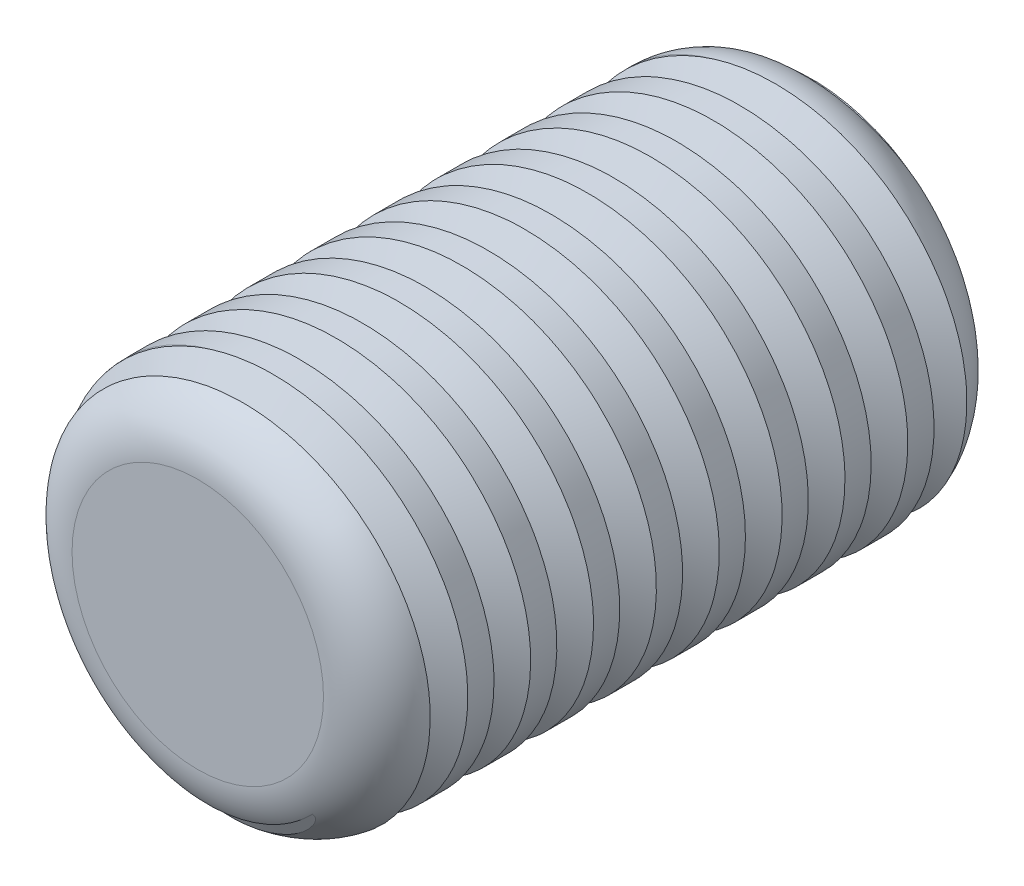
ISO-10303-21;
HEADER;
FILE_DESCRIPTION(('STEP AP214'),'2;1');
FILE_NAME('part.step','',(''),(''),'','','');
FILE_SCHEMA(('AUTOMOTIVE_DESIGN { 1 0 10303 214 1 1 1 1 }'));
ENDSEC;
DATA;
#1=APPLICATION_CONTEXT('core data for automotive mechanical design processes');
#2=APPLICATION_PROTOCOL_DEFINITION('international standard','automotive_design',2000,#1);
#3=PRODUCT_CONTEXT('',#1,'mechanical');
#4=PRODUCT('Part','Part','',(#3));
#5=PRODUCT_RELATED_PRODUCT_CATEGORY('part','',(#4));
#6=PRODUCT_DEFINITION_FORMATION('','',#4);
#7=PRODUCT_DEFINITION_CONTEXT('part definition',#1,'design');
#8=PRODUCT_DEFINITION('design','',#6,#7);
#9=PRODUCT_DEFINITION_SHAPE('','',#8);
#10=(LENGTH_UNIT() NAMED_UNIT(*) SI_UNIT(.MILLI.,.METRE.));
#11=(NAMED_UNIT(*) PLANE_ANGLE_UNIT() SI_UNIT($,.RADIAN.));
#12=(NAMED_UNIT(*) SI_UNIT($,.STERADIAN.) SOLID_ANGLE_UNIT());
#13=UNCERTAINTY_MEASURE_WITH_UNIT(LENGTH_MEASURE(1.E-05),#10,'distance_accuracy_value','');
#14=(GEOMETRIC_REPRESENTATION_CONTEXT(3) GLOBAL_UNCERTAINTY_ASSIGNED_CONTEXT((#13)) GLOBAL_UNIT_ASSIGNED_CONTEXT((#10,
#11,#12)) REPRESENTATION_CONTEXT('',''));
#15=CARTESIAN_POINT('',(0.,0.,0.));
#16=DIRECTION('',(0.,0.,1.));
#17=DIRECTION('',(1.,0.,0.));
#18=AXIS2_PLACEMENT_3D('',#15,#16,#17);
#19=CARTESIAN_POINT('',(0.,0.,10.));
#20=DIRECTION('',(0.,0.,-1.));
#21=DIRECTION('',(-1.,0.,0.));
#22=AXIS2_PLACEMENT_3D('',#19,#20,#21);
#23=CYLINDRICAL_SURFACE('',#22,3.);
#24=CARTESIAN_POINT('',(2.12132034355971,-2.12132034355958,0.166587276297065));
#25=CARTESIAN_POINT('',(3.00000000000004,-1.24264068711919,0.229087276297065));
#26=CARTESIAN_POINT('',(3.,0.,0.291587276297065));
#27=CARTESIAN_POINT('',(2.99999999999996,1.24264068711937,0.354087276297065));
#28=CARTESIAN_POINT('',(2.12132034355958,2.12132034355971,0.416587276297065));
#29=CARTESIAN_POINT('',(1.2426406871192,3.00000000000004,0.479087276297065));
#30=CARTESIAN_POINT('',(0.,3.,0.541587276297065));
#31=CARTESIAN_POINT('',(-1.24264068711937,2.99999999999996,0.604087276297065));
#32=CARTESIAN_POINT('',(-2.12132034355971,2.12132034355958,0.666587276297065));
#33=CARTESIAN_POINT('',(-3.00000000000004,1.2426406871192,0.729087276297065));
#34=CARTESIAN_POINT('',(-3.,0.,0.791587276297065));
#35=CARTESIAN_POINT('',(-2.99999999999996,-1.24264068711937,0.854087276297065));
#36=CARTESIAN_POINT('',(-2.12132034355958,-2.12132034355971,0.916587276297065));
#37=CARTESIAN_POINT('',(-1.24264068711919,-3.00000000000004,0.979087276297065));
#38=CARTESIAN_POINT('',(0.,-3.,1.04158727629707));
#39=CARTESIAN_POINT('',(1.24264068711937,-2.99999999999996,1.10408727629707));
#40=CARTESIAN_POINT('',(2.12132034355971,-2.12132034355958,1.16658727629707));
#41=CARTESIAN_POINT('',(3.00000000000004,-1.24264068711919,1.22908727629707));
#42=CARTESIAN_POINT('',(3.,0.,1.29158727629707));
#43=CARTESIAN_POINT('',(2.99999999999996,1.24264068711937,1.35408727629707));
#44=CARTESIAN_POINT('',(2.12132034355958,2.12132034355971,1.41658727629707));
#45=CARTESIAN_POINT('',(1.2426406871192,3.00000000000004,1.47908727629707));
#46=CARTESIAN_POINT('',(0.,3.,1.54158727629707));
#47=CARTESIAN_POINT('',(-1.24264068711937,2.99999999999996,1.60408727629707));
#48=CARTESIAN_POINT('',(-2.12132034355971,2.12132034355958,1.66658727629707));
#49=CARTESIAN_POINT('',(-3.00000000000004,1.2426406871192,1.72908727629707));
#50=CARTESIAN_POINT('',(-3.,0.,1.79158727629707));
#51=CARTESIAN_POINT('',(-2.99999999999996,-1.24264068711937,1.85408727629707));
#52=CARTESIAN_POINT('',(-2.12132034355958,-2.12132034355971,1.91658727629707));
#53=CARTESIAN_POINT('',(-1.24264068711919,-3.00000000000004,1.97908727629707));
#54=CARTESIAN_POINT('',(0.,-3.,2.04158727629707));
#55=CARTESIAN_POINT('',(1.24264068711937,-2.99999999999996,2.10408727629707));
#56=CARTESIAN_POINT('',(2.12132034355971,-2.12132034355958,2.16658727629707));
#57=CARTESIAN_POINT('',(3.00000000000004,-1.24264068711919,2.22908727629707));
#58=CARTESIAN_POINT('',(3.,0.,2.29158727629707));
#59=CARTESIAN_POINT('',(2.99999999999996,1.24264068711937,2.35408727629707));
#60=CARTESIAN_POINT('',(2.12132034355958,2.12132034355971,2.41658727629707));
#61=CARTESIAN_POINT('',(1.2426406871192,3.00000000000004,2.47908727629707));
#62=CARTESIAN_POINT('',(0.,3.,2.54158727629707));
#63=CARTESIAN_POINT('',(-1.24264068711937,2.99999999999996,2.60408727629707));
#64=CARTESIAN_POINT('',(-2.12132034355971,2.12132034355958,2.66658727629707));
#65=CARTESIAN_POINT('',(-3.00000000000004,1.2426406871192,2.72908727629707));
#66=CARTESIAN_POINT('',(-3.,0.,2.79158727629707));
#67=CARTESIAN_POINT('',(-2.99999999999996,-1.24264068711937,2.85408727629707));
#68=CARTESIAN_POINT('',(-2.12132034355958,-2.12132034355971,2.91658727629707));
#69=CARTESIAN_POINT('',(-1.24264068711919,-3.00000000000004,2.97908727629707));
#70=CARTESIAN_POINT('',(0.,-3.,3.04158727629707));
#71=CARTESIAN_POINT('',(1.24264068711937,-2.99999999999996,3.10408727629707));
#72=CARTESIAN_POINT('',(2.12132034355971,-2.12132034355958,3.16658727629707));
#73=CARTESIAN_POINT('',(3.00000000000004,-1.24264068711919,3.22908727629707));
#74=CARTESIAN_POINT('',(3.,0.,3.29158727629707));
#75=CARTESIAN_POINT('',(2.99999999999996,1.24264068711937,3.35408727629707));
#76=CARTESIAN_POINT('',(2.12132034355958,2.12132034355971,3.41658727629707));
#77=CARTESIAN_POINT('',(1.2426406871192,3.00000000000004,3.47908727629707));
#78=CARTESIAN_POINT('',(0.,3.,3.54158727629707));
#79=CARTESIAN_POINT('',(-1.24264068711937,2.99999999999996,3.60408727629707));
#80=CARTESIAN_POINT('',(-2.12132034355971,2.12132034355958,3.66658727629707));
#81=CARTESIAN_POINT('',(-3.00000000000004,1.2426406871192,3.72908727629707));
#82=CARTESIAN_POINT('',(-3.,0.,3.79158727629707));
#83=CARTESIAN_POINT('',(-2.99999999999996,-1.24264068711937,3.85408727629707));
#84=CARTESIAN_POINT('',(-2.12132034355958,-2.12132034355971,3.91658727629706));
#85=CARTESIAN_POINT('',(-1.24264068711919,-3.00000000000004,3.97908727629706));
#86=CARTESIAN_POINT('',(0.,-3.,4.04158727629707));
#87=CARTESIAN_POINT('',(1.24264068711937,-2.99999999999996,4.10408727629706));
#88=CARTESIAN_POINT('',(2.12132034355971,-2.12132034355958,4.16658727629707));
#89=CARTESIAN_POINT('',(3.00000000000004,-1.24264068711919,4.22908727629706));
#90=CARTESIAN_POINT('',(3.,0.,4.29158727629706));
#91=CARTESIAN_POINT('',(2.99999999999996,1.24264068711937,4.35408727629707));
#92=CARTESIAN_POINT('',(2.12132034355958,2.12132034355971,4.41658727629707));
#93=CARTESIAN_POINT('',(1.2426406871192,3.00000000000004,4.47908727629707));
#94=CARTESIAN_POINT('',(0.,3.,4.54158727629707));
#95=CARTESIAN_POINT('',(-1.24264068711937,2.99999999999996,4.60408727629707));
#96=CARTESIAN_POINT('',(-2.12132034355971,2.12132034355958,4.66658727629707));
#97=CARTESIAN_POINT('',(-3.00000000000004,1.2426406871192,4.72908727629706));
#98=CARTESIAN_POINT('',(-3.,0.,4.79158727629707));
#99=CARTESIAN_POINT('',(-2.99999999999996,-1.24264068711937,4.85408727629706));
#100=CARTESIAN_POINT('',(-2.12132034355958,-2.12132034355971,4.91658727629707));
#101=CARTESIAN_POINT('',(-1.24264068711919,-3.00000000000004,4.97908727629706));
#102=CARTESIAN_POINT('',(0.,-3.,5.04158727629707));
#103=CARTESIAN_POINT('',(1.24264068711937,-2.99999999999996,5.10408727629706));
#104=CARTESIAN_POINT('',(2.12132034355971,-2.12132034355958,5.16658727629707));
#105=CARTESIAN_POINT('',(3.00000000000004,-1.24264068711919,5.22908727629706));
#106=CARTESIAN_POINT('',(3.,0.,5.29158727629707));
#107=CARTESIAN_POINT('',(2.99999999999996,1.24264068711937,5.35408727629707));
#108=CARTESIAN_POINT('',(2.12132034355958,2.12132034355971,5.41658727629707));
#109=CARTESIAN_POINT('',(1.2426406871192,3.00000000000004,5.47908727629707));
#110=CARTESIAN_POINT('',(0.,3.,5.54158727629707));
#111=CARTESIAN_POINT('',(-1.24264068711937,2.99999999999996,5.60408727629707));
#112=CARTESIAN_POINT('',(-2.12132034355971,2.12132034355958,5.66658727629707));
#113=CARTESIAN_POINT('',(-3.00000000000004,1.2426406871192,5.72908727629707));
#114=CARTESIAN_POINT('',(-3.,0.,5.79158727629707));
#115=CARTESIAN_POINT('',(-2.99999999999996,-1.24264068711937,5.85408727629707));
#116=CARTESIAN_POINT('',(-2.12132034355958,-2.12132034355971,5.91658727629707));
#117=CARTESIAN_POINT('',(-1.24264068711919,-3.00000000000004,5.97908727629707));
#118=CARTESIAN_POINT('',(0.,-3.,6.04158727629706));
#119=CARTESIAN_POINT('',(1.24264068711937,-2.99999999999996,6.10408727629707));
#120=CARTESIAN_POINT('',(2.12132034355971,-2.12132034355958,6.16658727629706));
#121=CARTESIAN_POINT('',(3.00000000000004,-1.24264068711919,6.22908727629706));
#122=CARTESIAN_POINT('',(3.,0.,6.29158727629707));
#123=CARTESIAN_POINT('',(2.99999999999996,1.24264068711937,6.35408727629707));
#124=CARTESIAN_POINT('',(2.12132034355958,2.12132034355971,6.41658727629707));
#125=CARTESIAN_POINT('',(1.2426406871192,3.00000000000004,6.47908727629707));
#126=CARTESIAN_POINT('',(0.,3.,6.54158727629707));
#127=CARTESIAN_POINT('',(-1.24264068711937,2.99999999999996,6.60408727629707));
#128=CARTESIAN_POINT('',(-2.12132034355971,2.12132034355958,6.66658727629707));
#129=CARTESIAN_POINT('',(-3.00000000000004,1.2426406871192,6.72908727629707));
#130=CARTESIAN_POINT('',(-3.,0.,6.79158727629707));
#131=CARTESIAN_POINT('',(-2.99999999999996,-1.24264068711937,6.85408727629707));
#132=CARTESIAN_POINT('',(-2.12132034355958,-2.12132034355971,6.91658727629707));
#133=CARTESIAN_POINT('',(-1.24264068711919,-3.00000000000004,6.97908727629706));
#134=CARTESIAN_POINT('',(0.,-3.,7.04158727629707));
#135=CARTESIAN_POINT('',(1.24264068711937,-2.99999999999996,7.10408727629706));
#136=CARTESIAN_POINT('',(2.12132034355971,-2.12132034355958,7.16658727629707));
#137=CARTESIAN_POINT('',(3.00000000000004,-1.24264068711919,7.22908727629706));
#138=CARTESIAN_POINT('',(3.,0.,7.29158727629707));
#139=CARTESIAN_POINT('',(2.99999999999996,1.24264068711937,7.35408727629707));
#140=CARTESIAN_POINT('',(2.12132034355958,2.12132034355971,7.41658727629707));
#141=CARTESIAN_POINT('',(1.2426406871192,3.00000000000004,7.47908727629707));
#142=CARTESIAN_POINT('',(0.,3.,7.54158727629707));
#143=CARTESIAN_POINT('',(-1.24264068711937,2.99999999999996,7.60408727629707));
#144=CARTESIAN_POINT('',(-2.12132034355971,2.12132034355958,7.66658727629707));
#145=CARTESIAN_POINT('',(-3.00000000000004,1.2426406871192,7.72908727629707));
#146=CARTESIAN_POINT('',(-3.,0.,7.79158727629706));
#147=CARTESIAN_POINT('',(-2.99999999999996,-1.24264068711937,7.85408727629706));
#148=CARTESIAN_POINT('',(-2.12132034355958,-2.12132034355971,7.91658727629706));
#149=CARTESIAN_POINT('',(-1.24264068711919,-3.00000000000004,7.97908727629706));
#150=CARTESIAN_POINT('',(0.,-3.,8.04158727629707));
#151=CARTESIAN_POINT('',(1.24264068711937,-2.99999999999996,8.10408727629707));
#152=CARTESIAN_POINT('',(2.12132034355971,-2.12132034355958,8.16658727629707));
#153=CARTESIAN_POINT('',(3.00000000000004,-1.24264068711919,8.22908727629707));
#154=CARTESIAN_POINT('',(3.,0.,8.29158727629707));
#155=CARTESIAN_POINT('',(2.99999999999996,1.24264068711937,8.35408727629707));
#156=CARTESIAN_POINT('',(2.12132034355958,2.12132034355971,8.41658727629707));
#157=CARTESIAN_POINT('',(1.2426406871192,3.00000000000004,8.47908727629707));
#158=CARTESIAN_POINT('',(0.,3.,8.54158727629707));
#159=CARTESIAN_POINT('',(-1.24264068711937,2.99999999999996,8.60408727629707));
#160=CARTESIAN_POINT('',(-2.12132034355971,2.12132034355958,8.66658727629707));
#161=CARTESIAN_POINT('',(-3.00000000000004,1.2426406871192,8.72908727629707));
#162=CARTESIAN_POINT('',(-3.,0.,8.79158727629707));
#163=CARTESIAN_POINT('',(-2.99999999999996,-1.24264068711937,8.85408727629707));
#164=CARTESIAN_POINT('',(-2.12132034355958,-2.12132034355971,8.91658727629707));
#165=CARTESIAN_POINT('',(-1.24264068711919,-3.00000000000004,8.97908727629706));
#166=CARTESIAN_POINT('',(0.,-3.,9.04158727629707));
#167=CARTESIAN_POINT('',(1.24264068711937,-2.99999999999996,9.10408727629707));
#168=CARTESIAN_POINT('',(2.12132034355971,-2.12132034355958,9.16658727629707));
#169=CARTESIAN_POINT('',(3.00000000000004,-1.24264068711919,9.22908727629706));
#170=CARTESIAN_POINT('',(3.,0.,9.29158727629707));
#171=CARTESIAN_POINT('',(2.99999999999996,1.24264068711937,9.35408727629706));
#172=CARTESIAN_POINT('',(2.12132034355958,2.12132034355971,9.41658727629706));
#173=CARTESIAN_POINT('',(1.2426406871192,3.00000000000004,9.47908727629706));
#174=CARTESIAN_POINT('',(0.,3.,9.54158727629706));
#175=CARTESIAN_POINT('',(-1.24264068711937,2.99999999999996,9.60408727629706));
#176=CARTESIAN_POINT('',(-2.12132034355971,2.12132034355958,9.66658727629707));
#177=CARTESIAN_POINT('',(-3.00000000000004,1.2426406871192,9.72908727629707));
#178=CARTESIAN_POINT('',(-3.,0.,9.79158727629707));
#179=CARTESIAN_POINT('',(-2.99999999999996,-1.24264068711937,9.85408727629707));
#180=CARTESIAN_POINT('',(-2.12132034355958,-2.12132034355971,9.91658727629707));
#181=CARTESIAN_POINT('',(-1.24264068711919,-3.00000000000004,9.97908727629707));
#182=CARTESIAN_POINT('',(0.,-3.,10.0415872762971));
#183=CARTESIAN_POINT('',(1.24264068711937,-2.99999999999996,10.1040872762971));
#184=CARTESIAN_POINT('',(2.12132034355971,-2.12132034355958,10.1665872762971));
#185=(BOUNDED_CURVE() B_SPLINE_CURVE(2,(#24,#25,#26,#27,#28,#29,#30,#31,#32,#33,#34,#35,#36,#37,
#38,#39,#40,#41,#42,#43,#44,#45,#46,#47,#48,#49,#50,#51,#52,#53,#54,#55,#56,#57,#58,#59,#60,#61,
#62,#63,#64,#65,#66,#67,#68,#69,#70,#71,#72,#73,#74,#75,#76,#77,#78,#79,#80,#81,#82,#83,#84,#85,
#86,#87,#88,#89,#90,#91,#92,#93,#94,#95,#96,#97,#98,#99,#100,#101,#102,#103,#104,#105,#106,#107,
#108,#109,#110,#111,#112,#113,#114,#115,#116,#117,#118,#119,#120,#121,#122,#123,#124,#125,#126,
#127,#128,#129,#130,#131,#132,#133,#134,#135,#136,#137,#138,#139,#140,#141,#142,#143,#144,#145,
#146,#147,#148,#149,#150,#151,#152,#153,#154,#155,#156,#157,#158,#159,#160,#161,#162,#163,#164,
#165,#166,#167,#168,#169,#170,#171,#172,#173,#174,#175,#176,#177,#178,#179,#180,#181,#182,#183,
#184),.UNSPECIFIED.,.F.,.F.) B_SPLINE_CURVE_WITH_KNOTS((3,2,2,2,2,2,2,2,2,2,2,2,2,2,2,2,2,2,2,2,
2,2,2,2,2,2,2,2,2,2,2,2,2,2,2,2,2,2,2,2,2,2,2,2,2,2,2,2,2,2,2,2,2,2,2,2,2,2,2,2,2,2,2,2,2,2,2,2,
2,2,2,2,2,2,2,2,2,2,2,2,3),(0.,0.0125,0.025,0.0375,0.05,0.0625,0.075,0.0875,0.1,0.1125,0.125,
0.1375,0.15,0.1625,0.175,0.1875,0.2,0.2125,0.225,0.2375,0.25,0.2625,0.275,0.2875,0.3,0.3125,
0.325,0.3375,0.35,0.3625,0.375,0.3875,0.4,0.4125,0.425,0.4375,0.45,0.4625,0.475,0.4875,0.5,
0.5125,0.525,0.5375,0.55,0.5625,0.575,0.5875,0.6,0.6125,0.625,0.6375,0.65,0.6625,0.675,0.6875,
0.7,0.7125,0.725,0.7375,0.75,0.7625,0.775,0.7875,0.8,0.8125,0.825,0.8375,0.85,0.8625,0.875,
0.8875,0.9,0.9125,0.925,0.9375,0.95,0.9625,0.975,0.9875,1.),
.UNSPECIFIED.) CURVE() GEOMETRIC_REPRESENTATION_ITEM() RATIONAL_B_SPLINE_CURVE((1.,
0.923879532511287,1.,0.923879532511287,1.,0.923879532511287,1.,0.923879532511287,1.,
0.923879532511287,1.,0.923879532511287,1.,0.923879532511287,1.,0.923879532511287,1.,
0.923879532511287,1.,0.923879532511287,1.,0.923879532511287,1.,0.923879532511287,1.,
0.923879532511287,1.,0.923879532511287,1.,0.923879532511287,1.,0.923879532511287,1.,
0.923879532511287,1.,0.923879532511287,1.,0.923879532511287,1.,0.923879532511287,1.,
0.923879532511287,1.,0.923879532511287,1.,0.923879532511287,1.,0.923879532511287,1.,
0.923879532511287,1.,0.923879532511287,1.,0.923879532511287,1.,0.923879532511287,1.,
0.923879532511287,1.,0.923879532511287,1.,0.923879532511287,1.,0.923879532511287,1.,
0.923879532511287,1.,0.923879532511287,1.,0.923879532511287,1.,0.923879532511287,1.,
0.923879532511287,1.,0.923879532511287,1.,0.923879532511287,1.,0.923879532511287,1.,
0.923879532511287,1.,0.923879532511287,1.,0.923879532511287,1.,0.923879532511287,1.,
0.923879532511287,1.,0.923879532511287,1.,0.923879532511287,1.,0.923879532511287,1.,
0.923879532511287,1.,0.923879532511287,1.,0.923879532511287,1.,0.923879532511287,1.,
0.923879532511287,1.,0.923879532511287,1.,0.923879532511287,1.,0.923879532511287,1.,
0.923879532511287,1.,0.923879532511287,1.,0.923879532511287,1.,0.923879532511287,1.,
0.923879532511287,1.,0.923879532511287,1.,0.923879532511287,1.,0.923879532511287,1.,
0.923879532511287,1.,0.923879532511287,1.,0.923879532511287,1.,0.923879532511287,1.,
0.923879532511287,1.,0.923879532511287,1.,0.923879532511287,1.,0.923879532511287,1.,
0.923879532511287,1.,0.923879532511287,1.,0.923879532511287,1.,0.923879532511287,1.,
0.923879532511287,1.,0.923879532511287,1.,0.923879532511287,1.,0.923879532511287,1.)) REPRESENTATION_ITEM(''));
#186=CARTESIAN_POINT('',(-0.783698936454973,-2.89582733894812,9.));
#187=VERTEX_POINT('',#186);
#188=CARTESIAN_POINT('',(-0.783698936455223,-2.89582733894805,0.999999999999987));
#189=VERTEX_POINT('',#188);
#190=EDGE_CURVE('E184',#187,#189,#185,.F.);
#191=ORIENTED_EDGE('',*,*,#190,.F.);
#192=CARTESIAN_POINT('',(0.,0.,9.));
#193=DIRECTION('',(0.,0.,1.));
#194=DIRECTION('',(1.,0.,0.));
#195=AXIS2_PLACEMENT_3D('',#192,#193,#194);
#196=CIRCLE('',#195,3.);
#197=CARTESIAN_POINT('',(-0.783698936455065,2.89582733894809,9.));
#198=VERTEX_POINT('',#197);
#199=EDGE_CURVE('E223',#187,#198,#196,.F.);
#200=ORIENTED_EDGE('',*,*,#199,.T.);
#201=CARTESIAN_POINT('',(2.12132034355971,-2.12132034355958,-0.41658727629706));
#202=CARTESIAN_POINT('',(3.00000000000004,-1.24264068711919,-0.35408727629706));
#203=CARTESIAN_POINT('',(3.,0.,-0.29158727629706));
#204=CARTESIAN_POINT('',(2.99999999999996,1.24264068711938,-0.22908727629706));
#205=CARTESIAN_POINT('',(2.12132034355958,2.12132034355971,-0.16658727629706));
#206=CARTESIAN_POINT('',(1.24264068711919,3.00000000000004,-0.10408727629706));
#207=CARTESIAN_POINT('',(0.,3.,-0.0415872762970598));
#208=CARTESIAN_POINT('',(-1.24264068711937,2.99999999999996,0.0209127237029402));
#209=CARTESIAN_POINT('',(-2.12132034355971,2.12132034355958,0.0834127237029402));
#210=CARTESIAN_POINT('',(-3.00000000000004,1.2426406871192,0.14591272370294));
#211=CARTESIAN_POINT('',(-3.,0.,0.20841272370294));
#212=CARTESIAN_POINT('',(-2.99999999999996,-1.24264068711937,0.27091272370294));
#213=CARTESIAN_POINT('',(-2.12132034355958,-2.12132034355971,0.33341272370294));
#214=CARTESIAN_POINT('',(-1.24264068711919,-3.00000000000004,0.39591272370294));
#215=CARTESIAN_POINT('',(0.,-3.,0.45841272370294));
#216=CARTESIAN_POINT('',(1.24264068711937,-2.99999999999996,0.52091272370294));
#217=CARTESIAN_POINT('',(2.12132034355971,-2.12132034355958,0.58341272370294));
#218=CARTESIAN_POINT('',(3.00000000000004,-1.24264068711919,0.64591272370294));
#219=CARTESIAN_POINT('',(3.,0.,0.70841272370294));
#220=CARTESIAN_POINT('',(2.99999999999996,1.24264068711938,0.77091272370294));
#221=CARTESIAN_POINT('',(2.12132034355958,2.12132034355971,0.83341272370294));
#222=CARTESIAN_POINT('',(1.24264068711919,3.00000000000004,0.89591272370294));
#223=CARTESIAN_POINT('',(0.,3.,0.95841272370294));
#224=CARTESIAN_POINT('',(-1.24264068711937,2.99999999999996,1.02091272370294));
#225=CARTESIAN_POINT('',(-2.12132034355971,2.12132034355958,1.08341272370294));
#226=CARTESIAN_POINT('',(-3.00000000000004,1.2426406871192,1.14591272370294));
#227=CARTESIAN_POINT('',(-3.,0.,1.20841272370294));
#228=CARTESIAN_POINT('',(-2.99999999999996,-1.24264068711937,1.27091272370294));
#229=CARTESIAN_POINT('',(-2.12132034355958,-2.12132034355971,1.33341272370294));
#230=CARTESIAN_POINT('',(-1.24264068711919,-3.00000000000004,1.39591272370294));
#231=CARTESIAN_POINT('',(0.,-3.,1.45841272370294));
#232=CARTESIAN_POINT('',(1.24264068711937,-2.99999999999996,1.52091272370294));
#233=CARTESIAN_POINT('',(2.12132034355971,-2.12132034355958,1.58341272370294));
#234=CARTESIAN_POINT('',(3.00000000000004,-1.24264068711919,1.64591272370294));
#235=CARTESIAN_POINT('',(3.,0.,1.70841272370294));
#236=CARTESIAN_POINT('',(2.99999999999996,1.24264068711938,1.77091272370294));
#237=CARTESIAN_POINT('',(2.12132034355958,2.12132034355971,1.83341272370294));
#238=CARTESIAN_POINT('',(1.24264068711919,3.00000000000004,1.89591272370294));
#239=CARTESIAN_POINT('',(0.,3.,1.95841272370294));
#240=CARTESIAN_POINT('',(-1.24264068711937,2.99999999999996,2.02091272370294));
#241=CARTESIAN_POINT('',(-2.12132034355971,2.12132034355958,2.08341272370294));
#242=CARTESIAN_POINT('',(-3.00000000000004,1.2426406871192,2.14591272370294));
#243=CARTESIAN_POINT('',(-3.,0.,2.20841272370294));
#244=CARTESIAN_POINT('',(-2.99999999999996,-1.24264068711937,2.27091272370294));
#245=CARTESIAN_POINT('',(-2.12132034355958,-2.12132034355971,2.33341272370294));
#246=CARTESIAN_POINT('',(-1.24264068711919,-3.00000000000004,2.39591272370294));
#247=CARTESIAN_POINT('',(0.,-3.,2.45841272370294));
#248=CARTESIAN_POINT('',(1.24264068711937,-2.99999999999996,2.52091272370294));
#249=CARTESIAN_POINT('',(2.12132034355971,-2.12132034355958,2.58341272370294));
#250=CARTESIAN_POINT('',(3.00000000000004,-1.24264068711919,2.64591272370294));
#251=CARTESIAN_POINT('',(3.,0.,2.70841272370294));
#252=CARTESIAN_POINT('',(2.99999999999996,1.24264068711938,2.77091272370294));
#253=CARTESIAN_POINT('',(2.12132034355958,2.12132034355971,2.83341272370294));
#254=CARTESIAN_POINT('',(1.24264068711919,3.00000000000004,2.89591272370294));
#255=CARTESIAN_POINT('',(0.,3.,2.95841272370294));
#256=CARTESIAN_POINT('',(-1.24264068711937,2.99999999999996,3.02091272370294));
#257=CARTESIAN_POINT('',(-2.12132034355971,2.12132034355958,3.08341272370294));
#258=CARTESIAN_POINT('',(-3.00000000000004,1.2426406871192,3.14591272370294));
#259=CARTESIAN_POINT('',(-3.,0.,3.20841272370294));
#260=CARTESIAN_POINT('',(-2.99999999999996,-1.24264068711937,3.27091272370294));
#261=CARTESIAN_POINT('',(-2.12132034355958,-2.12132034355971,3.33341272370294));
#262=CARTESIAN_POINT('',(-1.24264068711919,-3.00000000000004,3.39591272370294));
#263=CARTESIAN_POINT('',(0.,-3.,3.45841272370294));
#264=CARTESIAN_POINT('',(1.24264068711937,-2.99999999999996,3.52091272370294));
#265=CARTESIAN_POINT('',(2.12132034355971,-2.12132034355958,3.58341272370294));
#266=CARTESIAN_POINT('',(3.00000000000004,-1.24264068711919,3.64591272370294));
#267=CARTESIAN_POINT('',(3.,0.,3.70841272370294));
#268=CARTESIAN_POINT('',(2.99999999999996,1.24264068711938,3.77091272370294));
#269=CARTESIAN_POINT('',(2.12132034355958,2.12132034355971,3.83341272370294));
#270=CARTESIAN_POINT('',(1.24264068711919,3.00000000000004,3.89591272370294));
#271=CARTESIAN_POINT('',(0.,3.,3.95841272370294));
#272=CARTESIAN_POINT('',(-1.24264068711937,2.99999999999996,4.02091272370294));
#273=CARTESIAN_POINT('',(-2.12132034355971,2.12132034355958,4.08341272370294));
#274=CARTESIAN_POINT('',(-3.00000000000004,1.2426406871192,4.14591272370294));
#275=CARTESIAN_POINT('',(-3.,0.,4.20841272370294));
#276=CARTESIAN_POINT('',(-2.99999999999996,-1.24264068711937,4.27091272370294));
#277=CARTESIAN_POINT('',(-2.12132034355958,-2.12132034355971,4.33341272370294));
#278=CARTESIAN_POINT('',(-1.24264068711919,-3.00000000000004,4.39591272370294));
#279=CARTESIAN_POINT('',(0.,-3.,4.45841272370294));
#280=CARTESIAN_POINT('',(1.24264068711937,-2.99999999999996,4.52091272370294));
#281=CARTESIAN_POINT('',(2.12132034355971,-2.12132034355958,4.58341272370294));
#282=CARTESIAN_POINT('',(3.00000000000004,-1.24264068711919,4.64591272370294));
#283=CARTESIAN_POINT('',(3.,0.,4.70841272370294));
#284=CARTESIAN_POINT('',(2.99999999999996,1.24264068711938,4.77091272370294));
#285=CARTESIAN_POINT('',(2.12132034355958,2.12132034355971,4.83341272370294));
#286=CARTESIAN_POINT('',(1.24264068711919,3.00000000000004,4.89591272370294));
#287=CARTESIAN_POINT('',(0.,3.,4.95841272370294));
#288=CARTESIAN_POINT('',(-1.24264068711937,2.99999999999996,5.02091272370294));
#289=CARTESIAN_POINT('',(-2.12132034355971,2.12132034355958,5.08341272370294));
#290=CARTESIAN_POINT('',(-3.00000000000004,1.2426406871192,5.14591272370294));
#291=CARTESIAN_POINT('',(-3.,0.,5.20841272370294));
#292=CARTESIAN_POINT('',(-2.99999999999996,-1.24264068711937,5.27091272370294));
#293=CARTESIAN_POINT('',(-2.12132034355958,-2.12132034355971,5.33341272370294));
#294=CARTESIAN_POINT('',(-1.24264068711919,-3.00000000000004,5.39591272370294));
#295=CARTESIAN_POINT('',(0.,-3.,5.45841272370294));
#296=CARTESIAN_POINT('',(1.24264068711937,-2.99999999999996,5.52091272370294));
#297=CARTESIAN_POINT('',(2.12132034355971,-2.12132034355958,5.58341272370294));
#298=CARTESIAN_POINT('',(3.00000000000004,-1.24264068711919,5.64591272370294));
#299=CARTESIAN_POINT('',(3.,0.,5.70841272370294));
#300=CARTESIAN_POINT('',(2.99999999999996,1.24264068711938,5.77091272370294));
#301=CARTESIAN_POINT('',(2.12132034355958,2.12132034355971,5.83341272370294));
#302=CARTESIAN_POINT('',(1.24264068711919,3.00000000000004,5.89591272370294));
#303=CARTESIAN_POINT('',(0.,3.,5.95841272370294));
#304=CARTESIAN_POINT('',(-1.24264068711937,2.99999999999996,6.02091272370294));
#305=CARTESIAN_POINT('',(-2.12132034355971,2.12132034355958,6.08341272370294));
#306=CARTESIAN_POINT('',(-3.00000000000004,1.2426406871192,6.14591272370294));
#307=CARTESIAN_POINT('',(-3.,0.,6.20841272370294));
#308=CARTESIAN_POINT('',(-2.99999999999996,-1.24264068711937,6.27091272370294));
#309=CARTESIAN_POINT('',(-2.12132034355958,-2.12132034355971,6.33341272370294));
#310=CARTESIAN_POINT('',(-1.24264068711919,-3.00000000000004,6.39591272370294));
#311=CARTESIAN_POINT('',(0.,-3.,6.45841272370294));
#312=CARTESIAN_POINT('',(1.24264068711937,-2.99999999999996,6.52091272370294));
#313=CARTESIAN_POINT('',(2.12132034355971,-2.12132034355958,6.58341272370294));
#314=CARTESIAN_POINT('',(3.00000000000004,-1.24264068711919,6.64591272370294));
#315=CARTESIAN_POINT('',(3.,0.,6.70841272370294));
#316=CARTESIAN_POINT('',(2.99999999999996,1.24264068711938,6.77091272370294));
#317=CARTESIAN_POINT('',(2.12132034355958,2.12132034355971,6.83341272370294));
#318=CARTESIAN_POINT('',(1.24264068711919,3.00000000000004,6.89591272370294));
#319=CARTESIAN_POINT('',(0.,3.,6.95841272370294));
#320=CARTESIAN_POINT('',(-1.24264068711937,2.99999999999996,7.02091272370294));
#321=CARTESIAN_POINT('',(-2.12132034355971,2.12132034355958,7.08341272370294));
#322=CARTESIAN_POINT('',(-3.00000000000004,1.2426406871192,7.14591272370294));
#323=CARTESIAN_POINT('',(-3.,0.,7.20841272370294));
#324=CARTESIAN_POINT('',(-2.99999999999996,-1.24264068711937,7.27091272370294));
#325=CARTESIAN_POINT('',(-2.12132034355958,-2.12132034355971,7.33341272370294));
#326=CARTESIAN_POINT('',(-1.24264068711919,-3.00000000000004,7.39591272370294));
#327=CARTESIAN_POINT('',(0.,-3.,7.45841272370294));
#328=CARTESIAN_POINT('',(1.24264068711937,-2.99999999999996,7.52091272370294));
#329=CARTESIAN_POINT('',(2.12132034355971,-2.12132034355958,7.58341272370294));
#330=CARTESIAN_POINT('',(3.00000000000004,-1.24264068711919,7.64591272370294));
#331=CARTESIAN_POINT('',(3.,0.,7.70841272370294));
#332=CARTESIAN_POINT('',(2.99999999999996,1.24264068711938,7.77091272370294));
#333=CARTESIAN_POINT('',(2.12132034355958,2.12132034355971,7.83341272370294));
#334=CARTESIAN_POINT('',(1.24264068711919,3.00000000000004,7.89591272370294));
#335=CARTESIAN_POINT('',(0.,3.,7.95841272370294));
#336=CARTESIAN_POINT('',(-1.24264068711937,2.99999999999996,8.02091272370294));
#337=CARTESIAN_POINT('',(-2.12132034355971,2.12132034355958,8.08341272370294));
#338=CARTESIAN_POINT('',(-3.00000000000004,1.2426406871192,8.14591272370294));
#339=CARTESIAN_POINT('',(-3.,0.,8.20841272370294));
#340=CARTESIAN_POINT('',(-2.99999999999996,-1.24264068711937,8.27091272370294));
#341=CARTESIAN_POINT('',(-2.12132034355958,-2.12132034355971,8.33341272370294));
#342=CARTESIAN_POINT('',(-1.24264068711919,-3.00000000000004,8.39591272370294));
#343=CARTESIAN_POINT('',(0.,-3.,8.45841272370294));
#344=CARTESIAN_POINT('',(1.24264068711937,-2.99999999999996,8.52091272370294));
#345=CARTESIAN_POINT('',(2.12132034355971,-2.12132034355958,8.58341272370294));
#346=CARTESIAN_POINT('',(3.00000000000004,-1.24264068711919,8.64591272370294));
#347=CARTESIAN_POINT('',(3.,0.,8.70841272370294));
#348=CARTESIAN_POINT('',(2.99999999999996,1.24264068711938,8.77091272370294));
#349=CARTESIAN_POINT('',(2.12132034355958,2.12132034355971,8.83341272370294));
#350=CARTESIAN_POINT('',(1.24264068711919,3.00000000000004,8.89591272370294));
#351=CARTESIAN_POINT('',(0.,3.,8.95841272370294));
#352=CARTESIAN_POINT('',(-1.24264068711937,2.99999999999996,9.02091272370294));
#353=CARTESIAN_POINT('',(-2.12132034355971,2.12132034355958,9.08341272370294));
#354=CARTESIAN_POINT('',(-3.00000000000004,1.2426406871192,9.14591272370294));
#355=CARTESIAN_POINT('',(-3.,0.,9.20841272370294));
#356=CARTESIAN_POINT('',(-2.99999999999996,-1.24264068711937,9.27091272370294));
#357=CARTESIAN_POINT('',(-2.12132034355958,-2.12132034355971,9.33341272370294));
#358=CARTESIAN_POINT('',(-1.24264068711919,-3.00000000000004,9.39591272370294));
#359=CARTESIAN_POINT('',(0.,-3.,9.45841272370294));
#360=CARTESIAN_POINT('',(1.24264068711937,-2.99999999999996,9.52091272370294));
#361=CARTESIAN_POINT('',(2.12132034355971,-2.12132034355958,9.58341272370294));
#362=(BOUNDED_CURVE() B_SPLINE_CURVE(2,(#201,#202,#203,#204,#205,#206,#207,#208,#209,#210,#211,
#212,#213,#214,#215,#216,#217,#218,#219,#220,#221,#222,#223,#224,#225,#226,#227,#228,#229,#230,
#231,#232,#233,#234,#235,#236,#237,#238,#239,#240,#241,#242,#243,#244,#245,#246,#247,#248,#249,
#250,#251,#252,#253,#254,#255,#256,#257,#258,#259,#260,#261,#262,#263,#264,#265,#266,#267,#268,
#269,#270,#271,#272,#273,#274,#275,#276,#277,#278,#279,#280,#281,#282,#283,#284,#285,#286,#287,
#288,#289,#290,#291,#292,#293,#294,#295,#296,#297,#298,#299,#300,#301,#302,#303,#304,#305,#306,
#307,#308,#309,#310,#311,#312,#313,#314,#315,#316,#317,#318,#319,#320,#321,#322,#323,#324,#325,
#326,#327,#328,#329,#330,#331,#332,#333,#334,#335,#336,#337,#338,#339,#340,#341,#342,#343,#344,
#345,#346,#347,#348,#349,#350,#351,#352,#353,#354,#355,#356,#357,#358,#359,#360,#361),
.UNSPECIFIED.,.F.,.F.) B_SPLINE_CURVE_WITH_KNOTS((3,2,2,2,2,2,2,2,2,2,2,2,2,2,2,2,2,2,2,2,2,2,2,
2,2,2,2,2,2,2,2,2,2,2,2,2,2,2,2,2,2,2,2,2,2,2,2,2,2,2,2,2,2,2,2,2,2,2,2,2,2,2,2,2,2,2,2,2,2,2,2,
2,2,2,2,2,2,2,2,2,3),(0.,0.0125,0.025,0.0375,0.05,0.0625,0.075,0.0875,0.1,0.1125,0.125,0.1375,
0.15,0.1625,0.175,0.1875,0.2,0.2125,0.225,0.2375,0.25,0.2625,0.275,0.2875,0.3,0.3125,0.325,
0.3375,0.35,0.3625,0.375,0.3875,0.4,0.4125,0.425,0.4375,0.45,0.4625,0.475,0.4875,0.5,0.5125,
0.525,0.5375,0.55,0.5625,0.575,0.5875,0.6,0.6125,0.625,0.6375,0.65,0.6625,0.675,0.6875,0.7,
0.7125,0.725,0.7375,0.75,0.7625,0.775,0.7875,0.8,0.8125,0.825,0.8375,0.85,0.8625,0.875,0.8875,
0.9,0.9125,0.925,0.9375,0.95,0.9625,0.975,0.9875,1.),
.UNSPECIFIED.) CURVE() GEOMETRIC_REPRESENTATION_ITEM() RATIONAL_B_SPLINE_CURVE((1.,
0.923879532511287,1.,0.923879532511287,1.,0.923879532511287,1.,0.923879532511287,1.,
0.923879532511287,1.,0.923879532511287,1.,0.923879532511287,1.,0.923879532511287,1.,
0.923879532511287,1.,0.923879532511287,1.,0.923879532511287,1.,0.923879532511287,1.,
0.923879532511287,1.,0.923879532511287,1.,0.923879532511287,1.,0.923879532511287,1.,
0.923879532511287,1.,0.923879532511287,1.,0.923879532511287,1.,0.923879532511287,1.,
0.923879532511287,1.,0.923879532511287,1.,0.923879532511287,1.,0.923879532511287,1.,
0.923879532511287,1.,0.923879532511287,1.,0.923879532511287,1.,0.923879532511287,1.,
0.923879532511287,1.,0.923879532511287,1.,0.923879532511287,1.,0.923879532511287,1.,
0.923879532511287,1.,0.923879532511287,1.,0.923879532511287,1.,0.923879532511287,1.,
0.923879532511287,1.,0.923879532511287,1.,0.923879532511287,1.,0.923879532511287,1.,
0.923879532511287,1.,0.923879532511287,1.,0.923879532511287,1.,0.923879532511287,1.,
0.923879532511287,1.,0.923879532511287,1.,0.923879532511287,1.,0.923879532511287,1.,
0.923879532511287,1.,0.923879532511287,1.,0.923879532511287,1.,0.923879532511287,1.,
0.923879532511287,1.,0.923879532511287,1.,0.923879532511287,1.,0.923879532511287,1.,
0.923879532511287,1.,0.923879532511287,1.,0.923879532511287,1.,0.923879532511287,1.,
0.923879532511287,1.,0.923879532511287,1.,0.923879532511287,1.,0.923879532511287,1.,
0.923879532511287,1.,0.923879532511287,1.,0.923879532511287,1.,0.923879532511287,1.,
0.923879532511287,1.,0.923879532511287,1.,0.923879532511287,1.,0.923879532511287,1.,
0.923879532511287,1.,0.923879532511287,1.,0.923879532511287,1.,0.923879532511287,1.,
0.923879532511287,1.,0.923879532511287,1.,0.923879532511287,1.,0.923879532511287,1.)) REPRESENTATION_ITEM(''));
#363=CARTESIAN_POINT('',(-0.783698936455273,2.89582733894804,1.00000000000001));
#364=VERTEX_POINT('',#363);
#365=EDGE_CURVE('E61',#364,#198,#362,.T.);
#366=ORIENTED_EDGE('',*,*,#365,.F.);
#367=CARTESIAN_POINT('',(0.,0.,0.999999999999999));
#368=DIRECTION('',(0.,0.,1.));
#369=DIRECTION('',(1.,0.,0.));
#370=AXIS2_PLACEMENT_3D('',#367,#368,#369);
#371=CIRCLE('',#370,3.);
#372=EDGE_CURVE('E220',#364,#189,#371,.T.);
#373=ORIENTED_EDGE('',*,*,#372,.T.);
#374=EDGE_LOOP('',(#191,#200,#366,#373));
#375=FACE_BOUND('',#374,.T.);
#376=ADVANCED_FACE('F33',(#375),#23,.T.);
#377=CARTESIAN_POINT('',(0.,0.,10.));
#378=DIRECTION('',(0.,0.,1.));
#379=DIRECTION('',(1.,0.,0.));
#380=AXIS2_PLACEMENT_3D('',#377,#378,#379);
#381=PLANE('',#380);
#382=CARTESIAN_POINT('',(0.,0.,10.));
#383=DIRECTION('',(0.,0.,1.));
#384=DIRECTION('',(1.,0.,0.));
#385=AXIS2_PLACEMENT_3D('',#382,#383,#384);
#386=CIRCLE('',#385,2.);
#387=CARTESIAN_POINT('',(2.,0.,10.));
#388=VERTEX_POINT('',#387);
#389=EDGE_CURVE('E214',#388,#388,#386,.T.);
#390=ORIENTED_EDGE('',*,*,#389,.T.);
#391=EDGE_LOOP('',(#390));
#392=FACE_BOUND('',#391,.T.);
#393=ADVANCED_FACE('F245',(#392),#381,.T.);
#394=CARTESIAN_POINT('',(0.,0.,0.));
#395=DIRECTION('',(0.,0.,1.));
#396=DIRECTION('',(1.,0.,0.));
#397=AXIS2_PLACEMENT_3D('',#394,#395,#396);
#398=PLANE('',#397);
#399=DIRECTION('',(0.181140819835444,0.983457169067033,0.));
#400=VECTOR('',#399,1.);
#401=CARTESIAN_POINT('',(-1.63205830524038,-0.579987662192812,0.));
#402=LINE('',#401,#400);
#403=CARTESIAN_POINT('',(-1.63205830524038,-0.579987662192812,0.));
#404=VERTEX_POINT('',#403);
#405=CARTESIAN_POINT('',(-1.31831320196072,1.12341012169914,0.));
#406=VERTEX_POINT('',#405);
#407=EDGE_CURVE('E143',#404,#406,#402,.T.);
#408=ORIENTED_EDGE('',*,*,#407,.F.);
#409=DIRECTION('',(-0.761128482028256,0.648601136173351,0.));
#410=VECTOR('',#409,1.);
#411=CARTESIAN_POINT('',(-0.313745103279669,-1.70339778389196,0.));
#412=LINE('',#411,#410);
#413=CARTESIAN_POINT('',(-0.313745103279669,-1.70339778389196,0.));
#414=VERTEX_POINT('',#413);
#415=EDGE_CURVE('E53',#414,#404,#412,.T.);
#416=ORIENTED_EDGE('',*,*,#415,.F.);
#417=DIRECTION('',(-0.9422693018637,-0.334856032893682,0.));
#418=VECTOR('',#417,1.);
#419=CARTESIAN_POINT('',(1.31831320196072,-1.12341012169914,0.));
#420=LINE('',#419,#418);
#421=CARTESIAN_POINT('',(1.31831320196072,-1.12341012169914,0.));
#422=VERTEX_POINT('',#421);
#423=EDGE_CURVE('E129',#422,#414,#420,.T.);
#424=ORIENTED_EDGE('',*,*,#423,.F.);
#425=DIRECTION('',(-0.181140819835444,-0.983457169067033,0.));
#426=VECTOR('',#425,1.);
#427=CARTESIAN_POINT('',(1.63205830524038,0.579987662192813,0.));
#428=LINE('',#427,#426);
#429=CARTESIAN_POINT('',(1.63205830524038,0.579987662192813,0.));
#430=VERTEX_POINT('',#429);
#431=EDGE_CURVE('E132',#430,#422,#428,.T.);
#432=ORIENTED_EDGE('',*,*,#431,.F.);
#433=DIRECTION('',(0.761128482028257,-0.648601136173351,0.));
#434=VECTOR('',#433,1.);
#435=CARTESIAN_POINT('',(0.313745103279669,1.70339778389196,0.));
#436=LINE('',#435,#434);
#437=CARTESIAN_POINT('',(0.313745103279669,1.70339778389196,0.));
#438=VERTEX_POINT('',#437);
#439=EDGE_CURVE('E148',#438,#430,#436,.T.);
#440=ORIENTED_EDGE('',*,*,#439,.F.);
#441=DIRECTION('',(0.9422693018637,0.334856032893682,0.));
#442=VECTOR('',#441,1.);
#443=CARTESIAN_POINT('',(-1.31831320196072,1.12341012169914,0.));
#444=LINE('',#443,#442);
#445=EDGE_CURVE('E145',#406,#438,#444,.T.);
#446=ORIENTED_EDGE('',*,*,#445,.F.);
#447=EDGE_LOOP('',(#408,#416,#424,#432,#440,#446));
#448=FACE_BOUND('',#447,.T.);
#449=CARTESIAN_POINT('',(0.,0.,0.));
#450=DIRECTION('',(0.,0.,1.));
#451=DIRECTION('',(1.,0.,0.));
#452=AXIS2_PLACEMENT_3D('',#449,#450,#451);
#453=CIRCLE('',#452,2.);
#454=CARTESIAN_POINT('',(2.,0.,0.));
#455=VERTEX_POINT('',#454);
#456=EDGE_CURVE('E217',#455,#455,#453,.F.);
#457=ORIENTED_EDGE('',*,*,#456,.T.);
#458=EDGE_LOOP('',(#457));
#459=FACE_BOUND('',#458,.T.);
#460=ADVANCED_FACE('F247',(#448,#459),#398,.F.);
#461=CARTESIAN_POINT('',(0.,0.,0.999999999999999));
#462=DIRECTION('',(0.,0.,1.));
#463=DIRECTION('',(1.,0.,0.));
#464=AXIS2_PLACEMENT_3D('',#461,#462,#463);
#465=TOROIDAL_SURFACE('',#464,2.,1.);
#466=CARTESIAN_POINT('',(-0.783698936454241,-2.89582733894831,1.00000000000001));
#467=CARTESIAN_POINT('',(-0.859043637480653,-2.87543326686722,0.995785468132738));
#468=CARTESIAN_POINT('',(-0.933542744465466,-2.85208877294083,0.991536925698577));
#469=CARTESIAN_POINT('',(-1.08046683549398,-2.79962061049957,0.982991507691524));
#470=CARTESIAN_POINT('',(-1.15289200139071,-2.77049745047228,0.978694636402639));
#471=CARTESIAN_POINT('',(-1.36639906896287,-2.67468245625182,0.96576616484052));
#472=CARTESIAN_POINT('',(-1.50382252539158,-2.59951527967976,0.957090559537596));
#473=CARTESIAN_POINT('',(-1.70443099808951,-2.46831216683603,0.943863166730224));
#474=CARTESIAN_POINT('',(-1.77251721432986,-2.41954327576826,0.939262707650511));
#475=CARTESIAN_POINT('',(-1.90436353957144,-2.31641781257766,0.9301182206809));
#476=CARTESIAN_POINT('',(-1.96812338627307,-2.26206090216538,0.925574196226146));
#477=CARTESIAN_POINT('',(-2.09082381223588,-2.14817220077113,0.916613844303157));
#478=CARTESIAN_POINT('',(-2.14976507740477,-2.0886411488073,0.912197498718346));
#479=CARTESIAN_POINT('',(-2.26238872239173,-1.96481075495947,0.903158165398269));
#480=CARTESIAN_POINT('',(-2.31607124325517,-1.90051154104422,0.898535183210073));
#481=CARTESIAN_POINT('',(-2.41773878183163,-1.76766997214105,0.889150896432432));
#482=CARTESIAN_POINT('',(-2.46572949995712,-1.69913196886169,0.884389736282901));
#483=CARTESIAN_POINT('',(-2.55572891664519,-1.55824144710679,0.874743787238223));
#484=CARTESIAN_POINT('',(-2.59773753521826,-1.48588887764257,0.869858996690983));
#485=CARTESIAN_POINT('',(-2.6754720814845,-1.33787760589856,0.859998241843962));
#486=CARTESIAN_POINT('',(-2.71119718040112,-1.2622184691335,0.855022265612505));
#487=CARTESIAN_POINT('',(-2.77609817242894,-1.10814560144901,0.845010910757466));
#488=CARTESIAN_POINT('',(-2.80527408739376,-1.02973187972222,0.839975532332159));
#489=CARTESIAN_POINT('',(-2.85674320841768,-0.871087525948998,0.8299029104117));
#490=CARTESIAN_POINT('',(-2.87906825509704,-0.790867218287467,0.824865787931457));
#491=CARTESIAN_POINT('',(-2.91686107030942,-0.628828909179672,0.814799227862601));
#492=CARTESIAN_POINT('',(-2.93232878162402,-0.547010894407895,0.809769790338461));
#493=CARTESIAN_POINT('',(-2.9562971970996,-0.382351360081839,0.799757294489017));
#494=CARTESIAN_POINT('',(-2.96479826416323,-0.29950989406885,0.794774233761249));
#495=CARTESIAN_POINT('',(-2.9722786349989,-0.174949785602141,0.787352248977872));
#496=CARTESIAN_POINT('',(-2.97389344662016,-0.133375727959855,0.784886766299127));
#497=CARTESIAN_POINT('',(-2.97536968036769,-0.0501939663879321,0.779996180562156));
#498=CARTESIAN_POINT('',(-2.97523107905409,-0.00858626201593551,0.777571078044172));
#499=CARTESIAN_POINT('',(-2.9721505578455,0.116115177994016,0.770226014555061));
#500=CARTESIAN_POINT('',(-2.96654818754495,0.199157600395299,0.765232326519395));
#501=CARTESIAN_POINT('',(-2.94827792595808,0.364415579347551,0.755045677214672));
#502=CARTESIAN_POINT('',(-2.93561007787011,0.446631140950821,0.749852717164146));
#503=CARTESIAN_POINT('',(-2.88711265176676,0.691134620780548,0.734029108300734));
#504=CARTESIAN_POINT('',(-2.84078476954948,0.851452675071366,0.723143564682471));
#505=CARTESIAN_POINT('',(-2.72219319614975,1.15963704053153,0.701106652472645));
#506=CARTESIAN_POINT('',(-2.65029198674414,1.30764339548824,0.689960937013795));
#507=CARTESIAN_POINT('',(-2.52456756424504,1.51884235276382,0.673150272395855));
#508=CARTESIAN_POINT('',(-2.47965218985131,1.58747364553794,0.667528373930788));
#509=CARTESIAN_POINT('',(-2.38415146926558,1.72069796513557,0.656287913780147));
#510=CARTESIAN_POINT('',(-2.33356590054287,1.78529083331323,0.650669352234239));
#511=CARTESIAN_POINT('',(-2.2272711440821,1.90973576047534,0.639486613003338));
#512=CARTESIAN_POINT('',(-2.17158031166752,1.96960346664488,0.633922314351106));
#513=CARTESIAN_POINT('',(-2.08441675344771,2.0557065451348,0.62565613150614));
#514=CARTESIAN_POINT('',(-2.05475627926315,2.08379232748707,0.622913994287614));
#515=CARTESIAN_POINT('',(-1.99424453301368,2.13865373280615,0.617351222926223));
#516=CARTESIAN_POINT('',(-1.96339303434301,2.16542910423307,0.614530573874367));
#517=CARTESIAN_POINT('',(-1.86918230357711,2.24367264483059,0.605972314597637));
#518=CARTESIAN_POINT('',(-1.80411826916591,2.29310625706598,0.600133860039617));
#519=CARTESIAN_POINT('',(-1.66995645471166,2.38612388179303,0.588207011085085));
#520=CARTESIAN_POINT('',(-1.60085711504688,2.42970561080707,0.582118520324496));
#521=CARTESIAN_POINT('',(-1.39096048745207,2.54957777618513,0.563752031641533));
#522=CARTESIAN_POINT('',(-1.24503912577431,2.61708358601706,0.551145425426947));
#523=CARTESIAN_POINT('',(-0.943759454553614,2.72593875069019,0.525257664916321));
#524=CARTESIAN_POINT('',(-0.788399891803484,2.76728462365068,0.511976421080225));
#525=CARTESIAN_POINT('',(-0.553605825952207,2.80834684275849,0.491875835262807));
#526=CARTESIAN_POINT('',(-0.475863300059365,2.81854015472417,0.485215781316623));
#527=CARTESIAN_POINT('',(-0.319795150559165,2.83224114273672,0.471817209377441));
#528=CARTESIAN_POINT('',(-0.241469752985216,2.83575128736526,0.465078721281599));
#529=CARTESIAN_POINT('',(-0.123960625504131,2.83596532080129,0.454934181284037));
#530=CARTESIAN_POINT('',(-0.084762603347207,2.83519271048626,0.451544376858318));
#531=CARTESIAN_POINT('',(-0.00644409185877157,2.83196148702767,0.444757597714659));
#532=CARTESIAN_POINT('',(0.0326764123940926,2.82950323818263,0.441360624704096));
#533=CARTESIAN_POINT('',(0.149785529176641,2.81946574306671,0.430969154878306));
#534=CARTESIAN_POINT('',(0.227545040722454,2.80922387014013,0.423772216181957));
#535=CARTESIAN_POINT('',(0.379651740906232,2.78201906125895,0.409074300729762));
#536=CARTESIAN_POINT('',(0.454034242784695,2.76524626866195,0.401586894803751));
#537=CARTESIAN_POINT('',(0.600886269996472,2.72499274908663,0.386071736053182));
#538=CARTESIAN_POINT('',(0.673355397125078,2.70151063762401,0.378043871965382));
#539=CARTESIAN_POINT('',(0.886444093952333,2.62117557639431,0.353127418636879));
#540=CARTESIAN_POINT('',(1.02344279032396,2.55431126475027,0.335340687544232));
#541=CARTESIAN_POINT('',(1.2291333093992,2.42609757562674,0.303953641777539));
#542=CARTESIAN_POINT('',(1.30332082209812,2.37313229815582,0.291502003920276));
#543=CARTESIAN_POINT('',(1.42127910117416,2.27542921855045,0.268645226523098));
#544=CARTESIAN_POINT('',(1.4673007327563,2.23330750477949,0.258819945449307));
#545=CARTESIAN_POINT('',(1.54050692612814,2.15763972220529,0.240672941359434));
#546=CARTESIAN_POINT('',(1.56915007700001,2.12540673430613,0.232809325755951));
#547=CARTESIAN_POINT('',(1.61451423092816,2.06817543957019,0.218178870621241));
#548=CARTESIAN_POINT('',(1.63223868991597,2.0438968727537,0.211787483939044));
#549=CARTESIAN_POINT('',(1.65620609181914,2.00668936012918,0.2013731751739));
#550=CARTESIAN_POINT('',(1.66364078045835,1.99439539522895,0.197838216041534));
#551=CARTESIAN_POINT('',(1.67751143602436,1.96935825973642,0.190341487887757));
#552=CARTESIAN_POINT('',(1.68394708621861,1.95661494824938,0.186379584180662));
#553=CARTESIAN_POINT('',(1.69316916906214,1.93539522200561,0.179370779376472));
#554=CARTESIAN_POINT('',(1.69642888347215,1.92706529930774,0.176520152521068));
#555=CARTESIAN_POINT('',(1.70200412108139,1.91024239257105,0.170459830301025));
#556=CARTESIAN_POINT('',(1.70432178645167,1.90174982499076,0.167250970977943));
#557=CARTESIAN_POINT('',(1.7074952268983,1.88443133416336,0.160206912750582));
#558=CARTESIAN_POINT('',(1.70831815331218,1.87560217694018,0.156359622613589));
#559=CARTESIAN_POINT('',(1.70745913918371,1.86366387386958,0.150488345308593));
#560=CARTESIAN_POINT('',(1.70699268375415,1.86032993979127,0.148771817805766));
#561=CARTESIAN_POINT('',(1.70549811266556,1.85385755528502,0.145236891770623));
#562=CARTESIAN_POINT('',(1.70447251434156,1.85071829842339,0.143418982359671));
#563=CARTESIAN_POINT('',(1.70187302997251,1.84499191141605,0.139850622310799));
#564=CARTESIAN_POINT('',(1.70034554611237,1.8423810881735,0.138105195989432));
#565=CARTESIAN_POINT('',(1.69672725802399,1.83752566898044,0.134589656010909));
#566=CARTESIAN_POINT('',(1.69462848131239,1.83528703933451,0.132819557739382));
#567=CARTESIAN_POINT('',(1.69226320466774,1.83331688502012,0.131081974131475));
#568=B_SPLINE_CURVE_WITH_KNOTS('',3,(#466,#467,#468,#469,#470,#471,#472,#473,#474,#475,#476,
#477,#478,#479,#480,#481,#482,#483,#484,#485,#486,#487,#488,#489,#490,#491,#492,#493,#494,#495,
#496,#497,#498,#499,#500,#501,#502,#503,#504,#505,#506,#507,#508,#509,#510,#511,#512,#513,#514,
#515,#516,#517,#518,#519,#520,#521,#522,#523,#524,#525,#526,#527,#528,#529,#530,#531,#532,#533,
#534,#535,#536,#537,#538,#539,#540,#541,#542,#543,#544,#545,#546,#547,#548,#549,#550,#551,#552,
#553,#554,#555,#556,#557,#558,#559,#560,#561,#562,#563,#564,#565,#566,#567),.UNSPECIFIED.,.F.,
.F.,(4,2,2,2,2,2,2,2,2,2,2,2,2,2,2,2,2,2,2,2,2,2,2,2,2,2,2,2,2,2,2,2,2,2,2,2,2,2,2,2,2,2,2,2,2,
2,2,2,2,2,4),(0.,0.234361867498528,0.468703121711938,0.937046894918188,1.18844271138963,
1.43985375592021,1.69122895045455,1.94259740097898,2.1937119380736,2.44482983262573,
2.69598082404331,2.94713097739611,3.19709554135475,3.44706219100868,3.69701581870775,
3.82201881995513,3.94702349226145,4.19682171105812,4.44661840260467,4.94569746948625,
5.43796729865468,5.68436274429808,5.93076786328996,6.17631942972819,6.29910616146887,
6.42191637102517,6.66733212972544,6.91284337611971,7.39414203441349,7.87550473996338,
8.11134485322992,8.34709783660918,8.46512377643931,8.58312421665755,8.81905524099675,
9.04857694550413,9.27814604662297,9.73517982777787,10.0104342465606,10.1995082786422,
10.3308013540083,10.4228241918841,10.4671821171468,10.5115540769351,10.5396759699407,
10.567733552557,10.5964006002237,10.6077002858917,10.618949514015,10.6293628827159,
10.6399297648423),.UNSPECIFIED.);
#569=CARTESIAN_POINT('',(1.69226320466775,1.83331688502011,0.131081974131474));
#570=VERTEX_POINT('',#569);
#571=EDGE_CURVE('E225',#189,#570,#568,.T.);
#572=ORIENTED_EDGE('',*,*,#571,.F.);
#573=ORIENTED_EDGE('',*,*,#372,.F.);
#574=CARTESIAN_POINT('',(1.69226320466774,1.83331688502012,0.131081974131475));
#575=CARTESIAN_POINT('',(1.64289748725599,1.88404599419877,0.133238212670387));
#576=CARTESIAN_POINT('',(1.59138490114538,1.93267944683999,0.135439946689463));
#577=CARTESIAN_POINT('',(1.48445092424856,2.02543207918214,0.139918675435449));
#578=CARTESIAN_POINT('',(1.42902969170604,2.06955144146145,0.14219566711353));
#579=CARTESIAN_POINT('',(1.31470662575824,2.15292257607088,0.146807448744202));
#580=CARTESIAN_POINT('',(1.25580771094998,2.19217834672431,0.149142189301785));
#581=CARTESIAN_POINT('',(1.13493268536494,2.26558100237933,0.153854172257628));
#582=CARTESIAN_POINT('',(1.07295663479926,2.2997279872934,0.156231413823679));
#583=CARTESIAN_POINT('',(0.882992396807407,2.39415135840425,0.163401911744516));
#584=CARTESIAN_POINT('',(0.750918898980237,2.44644599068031,0.168235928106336));
#585=CARTESIAN_POINT('',(0.47997672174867,2.52809858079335,0.17787571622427));
#586=CARTESIAN_POINT('',(0.341110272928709,2.55746401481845,0.182681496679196));
#587=CARTESIAN_POINT('',(0.0603952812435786,2.59248006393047,0.192066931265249));
#588=CARTESIAN_POINT('',(-0.0814539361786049,2.59812525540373,0.196646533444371));
#589=CARTESIAN_POINT('',(-0.364244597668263,2.58652338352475,0.206188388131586));
#590=CARTESIAN_POINT('',(-0.505185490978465,2.56926354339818,0.211150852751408));
#591=CARTESIAN_POINT('',(-0.786631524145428,2.51129523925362,0.221400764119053));
#592=CARTESIAN_POINT('',(-0.92699342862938,2.46989054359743,0.22669350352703));
#593=CARTESIAN_POINT('',(-1.19886034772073,2.36426449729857,0.237338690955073));
#594=CARTESIAN_POINT('',(-1.33036877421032,2.30005199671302,0.242691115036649));
#595=CARTESIAN_POINT('',(-1.51868545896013,2.187766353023,0.250661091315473));
#596=CARTESIAN_POINT('',(-1.58023947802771,2.14744470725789,0.253320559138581));
#597=CARTESIAN_POINT('',(-1.69975858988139,2.061759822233,0.258600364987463));
#598=CARTESIAN_POINT('',(-1.75772373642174,2.01639665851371,0.26122070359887));
#599=CARTESIAN_POINT('',(-1.86964046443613,1.9209296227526,0.266383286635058));
#600=CARTESIAN_POINT('',(-1.92359047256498,1.87082390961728,0.268925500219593));
#601=CARTESIAN_POINT('',(-2.0272363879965,1.76639431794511,0.274118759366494));
#602=CARTESIAN_POINT('',(-2.07693203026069,1.7120701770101,0.276769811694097));
#603=CARTESIAN_POINT('',(-2.17231547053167,1.59883637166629,0.282177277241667));
#604=CARTESIAN_POINT('',(-2.21794528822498,1.53987780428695,0.284934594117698));
#605=CARTESIAN_POINT('',(-2.30416740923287,1.41841368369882,0.290508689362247));
#606=CARTESIAN_POINT('',(-2.34475993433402,1.35590828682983,0.293325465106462));
#607=CARTESIAN_POINT('',(-2.45853477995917,1.16372146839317,0.301834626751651));
#608=CARTESIAN_POINT('',(-2.52381511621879,1.02924957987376,0.307591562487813));
#609=CARTESIAN_POINT('',(-2.63238533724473,0.74857154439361,0.319223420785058));
#610=CARTESIAN_POINT('',(-2.6752063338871,0.602183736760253,0.325098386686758));
#611=CARTESIAN_POINT('',(-2.72057640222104,0.378905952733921,0.333798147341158));
#612=CARTESIAN_POINT('',(-2.73255750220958,0.30382403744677,0.336680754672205));
#613=CARTESIAN_POINT('',(-2.75014183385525,0.152894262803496,0.342361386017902));
#614=CARTESIAN_POINT('',(-2.75574496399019,0.0770463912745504,0.345159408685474));
#615=CARTESIAN_POINT('',(-2.76062866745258,-0.0748301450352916,0.350766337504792));
#616=CARTESIAN_POINT('',(-2.75991033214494,-0.150858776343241,0.353575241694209));
#617=CARTESIAN_POINT('',(-2.75226402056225,-0.302600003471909,0.359308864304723));
#618=CARTESIAN_POINT('',(-2.74533599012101,-0.378312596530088,0.362233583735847));
#619=CARTESIAN_POINT('',(-2.72528501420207,-0.528919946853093,0.368147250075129));
#620=CARTESIAN_POINT('',(-2.71216135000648,-0.60381460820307,0.371136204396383));
#621=CARTESIAN_POINT('',(-2.67981440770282,-0.752271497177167,0.377167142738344));
#622=CARTESIAN_POINT('',(-2.66059116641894,-0.825833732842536,0.3802091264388));
#623=CARTESIAN_POINT('',(-2.61555793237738,-0.973139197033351,0.386408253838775));
#624=CARTESIAN_POINT('',(-2.5895807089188,-1.04683132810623,0.389566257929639));
#625=CARTESIAN_POINT('',(-2.53150450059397,-1.1917622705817,0.395893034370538));
#626=CARTESIAN_POINT('',(-2.49940543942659,-1.26300105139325,0.399061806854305));
#627=CARTESIAN_POINT('',(-2.42931835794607,-1.40251195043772,0.405387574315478));
#628=CARTESIAN_POINT('',(-2.39133096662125,-1.47078438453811,0.408544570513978));
#629=CARTESIAN_POINT('',(-2.30973928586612,-1.60388167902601,0.414823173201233));
#630=CARTESIAN_POINT('',(-2.26613523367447,-1.66870668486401,0.417944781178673));
#631=CARTESIAN_POINT('',(-2.17363522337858,-1.79443466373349,0.424134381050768));
#632=CARTESIAN_POINT('',(-2.12474139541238,-1.85533919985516,0.4272023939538));
#633=CARTESIAN_POINT('',(-2.02200952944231,-1.97280273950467,0.433244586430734));
#634=CARTESIAN_POINT('',(-1.96817128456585,-2.02936156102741,0.436218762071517));
#635=CARTESIAN_POINT('',(-1.79993148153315,-2.19209758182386,0.445321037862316));
#636=CARTESIAN_POINT('',(-1.67874687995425,-2.29141250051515,0.451632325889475));
#637=CARTESIAN_POINT('',(-1.41988337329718,-2.4700082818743,0.464590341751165));
#638=CARTESIAN_POINT('',(-1.28198979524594,-2.5489760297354,0.47124061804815));
#639=CARTESIAN_POINT('',(-0.994989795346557,-2.68281237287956,0.484623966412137));
#640=CARTESIAN_POINT('',(-0.845885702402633,-2.73768595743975,0.491357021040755));
#641=CARTESIAN_POINT('',(-0.539396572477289,-2.82215505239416,0.504789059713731));
#642=CARTESIAN_POINT('',(-0.381955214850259,-2.85154652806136,0.511487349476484));
#643=CARTESIAN_POINT('',(-0.0643419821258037,-2.88346527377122,0.524528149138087));
#644=CARTESIAN_POINT('',(0.0958305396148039,-2.88598609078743,0.530870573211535));
#645=CARTESIAN_POINT('',(0.415167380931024,-2.86457230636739,0.54408904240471));
#646=CARTESIAN_POINT('',(0.574322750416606,-2.8405063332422,0.550967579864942));
#647=CARTESIAN_POINT('',(0.886399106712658,-2.76631614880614,0.564924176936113));
#648=CARTESIAN_POINT('',(1.0393205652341,-2.71619391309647,0.572002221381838));
#649=CARTESIAN_POINT('',(1.33677057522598,-2.59038975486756,0.586299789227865));
#650=CARTESIAN_POINT('',(1.4811602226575,-2.51437631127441,0.593519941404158));
#651=CARTESIAN_POINT('',(1.68650348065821,-2.38308998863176,0.604216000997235));
#652=CARTESIAN_POINT('',(1.75310638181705,-2.33642416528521,0.6077606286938));
#653=CARTESIAN_POINT('',(1.88216494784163,-2.23763361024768,0.614783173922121));
#654=CARTESIAN_POINT('',(1.94462064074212,-2.18550891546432,0.618261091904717));
#655=CARTESIAN_POINT('',(2.06489918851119,-2.0762014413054,0.62512619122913));
#656=CARTESIAN_POINT('',(2.12272332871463,-2.01902007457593,0.628513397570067));
#657=CARTESIAN_POINT('',(2.23343075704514,-1.90006592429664,0.635442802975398));
#658=CARTESIAN_POINT('',(2.28631395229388,-1.83829305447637,0.638985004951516));
#659=CARTESIAN_POINT('',(2.38676337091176,-1.71056081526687,0.646155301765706));
#660=CARTESIAN_POINT('',(2.43432911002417,-1.64460106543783,0.649783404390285));
#661=CARTESIAN_POINT('',(2.52381112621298,-1.50896027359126,0.657113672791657));
#662=CARTESIAN_POINT('',(2.56572746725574,-1.43927927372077,0.660815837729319));
#663=CARTESIAN_POINT('',(2.64414115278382,-1.29572088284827,0.668316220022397));
#664=CARTESIAN_POINT('',(2.68055857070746,-1.22179984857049,0.6721150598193));
#665=CARTESIAN_POINT('',(2.7470348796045,-1.07115310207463,0.679734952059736));
#666=CARTESIAN_POINT('',(2.77709373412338,-0.994427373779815,0.68355600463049));
#667=CARTESIAN_POINT('',(2.83063770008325,-0.838721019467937,0.691193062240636));
#668=CARTESIAN_POINT('',(2.85412332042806,-0.759740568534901,0.695009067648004));
#669=CARTESIAN_POINT('',(2.89435777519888,-0.600084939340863,0.702609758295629));
#670=CARTESIAN_POINT('',(2.91110673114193,-0.519409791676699,0.706394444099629));
#671=CARTESIAN_POINT('',(2.93776161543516,-0.35685862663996,0.713907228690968));
#672=CARTESIAN_POINT('',(2.94766217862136,-0.274981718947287,0.717635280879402));
#673=CARTESIAN_POINT('',(2.9573143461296,-0.1517769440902,0.723166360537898));
#674=CARTESIAN_POINT('',(2.95966526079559,-0.110639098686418,0.725000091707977));
#675=CARTESIAN_POINT('',(2.96262977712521,-0.0282991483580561,0.728635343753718));
#676=CARTESIAN_POINT('',(2.96324334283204,0.0129029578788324,0.730436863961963));
#677=CARTESIAN_POINT('',(2.96250248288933,0.136499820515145,0.735896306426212));
#678=CARTESIAN_POINT('',(2.95856718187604,0.218893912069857,0.739609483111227));
#679=CARTESIAN_POINT('',(2.94384372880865,0.383031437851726,0.747146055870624));
#680=CARTESIAN_POINT('',(2.93305556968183,0.464774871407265,0.750969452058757));
#681=CARTESIAN_POINT('',(2.8903240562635,0.709188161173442,0.762620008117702));
#682=CARTESIAN_POINT('',(2.84801930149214,0.870161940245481,0.770588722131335));
#683=CARTESIAN_POINT('',(2.73702653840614,1.18271029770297,0.786671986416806));
#684=CARTESIAN_POINT('',(2.66834136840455,1.33428588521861,0.794786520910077));
#685=CARTESIAN_POINT('',(2.54695741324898,1.55159572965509,0.806909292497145));
#686=CARTESIAN_POINT('',(2.50330983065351,1.62251465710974,0.81095167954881));
#687=CARTESIAN_POINT('',(2.41018313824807,1.76043831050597,0.818989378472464));
#688=CARTESIAN_POINT('',(2.36070407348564,1.82744306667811,0.822984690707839));
#689=CARTESIAN_POINT('',(2.25625865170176,1.95705729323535,0.830898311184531));
#690=CARTESIAN_POINT('',(2.2012915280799,2.01966614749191,0.834816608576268));
#691=CARTESIAN_POINT('',(2.11504608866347,2.1099260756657,0.840615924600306));
#692=CARTESIAN_POINT('',(2.08566299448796,2.13940573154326,0.842536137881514));
#693=CARTESIAN_POINT('',(2.02568501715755,2.19711311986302,0.846423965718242));
#694=CARTESIAN_POINT('',(1.99508990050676,2.22534060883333,0.848391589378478));
#695=CARTESIAN_POINT('',(1.90149129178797,2.30812627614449,0.854347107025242));
#696=CARTESIAN_POINT('',(1.83673416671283,2.36072526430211,0.858383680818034));
#697=CARTESIAN_POINT('',(1.70304327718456,2.46030141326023,0.866567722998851));
#698=CARTESIAN_POINT('',(1.63410810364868,2.50727666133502,0.870715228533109));
#699=CARTESIAN_POINT('',(1.4218126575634,2.63920285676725,0.88327631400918));
#700=CARTESIAN_POINT('',(1.27281050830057,2.71528839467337,0.891818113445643));
#701=CARTESIAN_POINT('',(0.963482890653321,2.8416736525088,0.909044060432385));
#702=CARTESIAN_POINT('',(0.803110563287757,2.89185865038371,0.917728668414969));
#703=CARTESIAN_POINT('',(0.558083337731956,2.94638566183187,0.930637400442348));
#704=CARTESIAN_POINT('',(0.475619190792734,2.96110514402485,0.934922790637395));
#705=CARTESIAN_POINT('',(0.30972291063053,2.98354145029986,0.943439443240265));
#706=CARTESIAN_POINT('',(0.226290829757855,2.99125865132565,0.947670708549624));
#707=CARTESIAN_POINT('',(0.0648086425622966,2.99934036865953,0.95570965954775));
#708=CARTESIAN_POINT('',(-0.0132183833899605,3.00017260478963,0.959526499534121));
#709=CARTESIAN_POINT('',(-0.169089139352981,2.99571747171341,0.967301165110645));
#710=CARTESIAN_POINT('',(-0.246932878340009,2.99043040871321,0.97125898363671));
#711=CARTESIAN_POINT('',(-0.401962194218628,2.9737626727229,0.979292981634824));
#712=CARTESIAN_POINT('',(-0.479147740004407,2.96238171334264,0.983369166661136));
#713=CARTESIAN_POINT('',(-0.632390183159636,2.93360051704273,0.99161792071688));
#714=CARTESIAN_POINT('',(-0.708446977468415,2.91619973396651,0.995790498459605));
#715=CARTESIAN_POINT('',(-0.783698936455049,2.8958273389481,0.999999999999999));
#716=B_SPLINE_CURVE_WITH_KNOTS('',3,(#574,#575,#576,#577,#578,#579,#580,#581,#582,#583,#584,
#585,#586,#587,#588,#589,#590,#591,#592,#593,#594,#595,#596,#597,#598,#599,#600,#601,#602,#603,
#604,#605,#606,#607,#608,#609,#610,#611,#612,#613,#614,#615,#616,#617,#618,#619,#620,#621,#622,
#623,#624,#625,#626,#627,#628,#629,#630,#631,#632,#633,#634,#635,#636,#637,#638,#639,#640,#641,
#642,#643,#644,#645,#646,#647,#648,#649,#650,#651,#652,#653,#654,#655,#656,#657,#658,#659,#660,
#661,#662,#663,#664,#665,#666,#667,#668,#669,#670,#671,#672,#673,#674,#675,#676,#677,#678,#679,
#680,#681,#682,#683,#684,#685,#686,#687,#688,#689,#690,#691,#692,#693,#694,#695,#696,#697,#698,
#699,#700,#701,#702,#703,#704,#705,#706,#707,#708,#709,#710,#711,#712,#713,#714,#715),
.UNSPECIFIED.,.F.,.F.,(4,2,2,2,2,2,2,2,2,2,2,2,2,2,2,2,2,2,2,2,2,2,2,2,2,2,2,2,2,2,2,2,2,2,2,2,
2,2,2,2,2,2,2,2,2,2,2,2,2,2,2,2,2,2,2,2,2,2,2,2,2,2,2,2,2,2,2,2,2,2,4),(0.,0.212382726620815,
0.42475685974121,0.636955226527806,0.849149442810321,1.2733574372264,1.69742705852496,
2.12159363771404,2.5459969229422,2.9832896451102,3.42041287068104,3.64109733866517,
3.86177850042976,4.08254568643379,4.30332661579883,4.52687223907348,4.75040801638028,
5.19701534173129,5.65260865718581,5.88064241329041,6.10867979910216,6.33667781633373,
6.56467782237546,6.79270428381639,7.02072936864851,7.25505124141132,7.48937603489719,
7.72367581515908,7.95796570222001,8.19216159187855,8.42636728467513,8.89449006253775,
9.36943615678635,9.84428385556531,10.3228994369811,10.801629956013,11.2827366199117,
11.7638068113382,12.251284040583,12.4952523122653,12.7392189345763,12.9831176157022,
13.2270208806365,13.4709463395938,13.7148690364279,13.9620522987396,14.2092369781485,
14.4564025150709,14.7035635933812,14.9509180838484,15.0746233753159,15.1983312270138,
15.4457205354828,15.693110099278,16.1904961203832,16.6878286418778,16.9376962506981,
17.1875619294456,17.4374625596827,17.5624300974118,17.6874218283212,17.9376636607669,
18.187990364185,18.6880426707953,19.1902912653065,19.4416745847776,19.6930443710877,
19.927184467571,20.1613128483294,20.395452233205,20.6296128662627),.UNSPECIFIED.);
#717=EDGE_CURVE('E174',#570,#364,#716,.T.);
#718=ORIENTED_EDGE('',*,*,#717,.F.);
#719=EDGE_LOOP('',(#572,#573,#718));
#720=FACE_BOUND('',#719,.T.);
#721=ORIENTED_EDGE('',*,*,#456,.F.);
#722=EDGE_LOOP('',(#721));
#723=FACE_BOUND('',#722,.T.);
#724=ADVANCED_FACE('F188',(#720,#723),#465,.T.);
#725=CARTESIAN_POINT('',(0.,0.,9.));
#726=DIRECTION('',(0.,0.,1.));
#727=DIRECTION('',(1.,0.,0.));
#728=AXIS2_PLACEMENT_3D('',#725,#726,#727);
#729=TOROIDAL_SURFACE('',#728,2.,1.);
#730=CARTESIAN_POINT('',(1.69226320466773,-1.83331688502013,9.86891802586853));
#731=CARTESIAN_POINT('',(1.64289748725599,-1.88404599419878,9.86676178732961));
#732=CARTESIAN_POINT('',(1.59138490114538,-1.93267944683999,9.86456005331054));
#733=CARTESIAN_POINT('',(1.48445092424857,-2.02543207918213,9.86008132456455));
#734=CARTESIAN_POINT('',(1.42902969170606,-2.06955144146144,9.85780433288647));
#735=CARTESIAN_POINT('',(1.31470662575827,-2.15292257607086,9.8531925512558));
#736=CARTESIAN_POINT('',(1.25580771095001,-2.19217834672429,9.85085781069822));
#737=CARTESIAN_POINT('',(1.13493268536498,-2.26558100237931,9.84614582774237));
#738=CARTESIAN_POINT('',(1.0729566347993,-2.29972798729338,9.84376858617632));
#739=CARTESIAN_POINT('',(0.882992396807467,-2.39415135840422,9.83659808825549));
#740=CARTESIAN_POINT('',(0.750918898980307,-2.44644599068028,9.83176407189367));
#741=CARTESIAN_POINT('',(0.479976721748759,-2.52809858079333,9.82212428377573));
#742=CARTESIAN_POINT('',(0.341110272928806,-2.55746401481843,9.81731850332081));
#743=CARTESIAN_POINT('',(0.0603952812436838,-2.59248006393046,9.80793306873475));
#744=CARTESIAN_POINT('',(-0.0814539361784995,-2.59812525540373,9.80335346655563));
#745=CARTESIAN_POINT('',(-0.364244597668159,-2.58652338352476,9.79381161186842));
#746=CARTESIAN_POINT('',(-0.505185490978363,-2.5692635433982,9.7888491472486));
#747=CARTESIAN_POINT('',(-0.786631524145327,-2.51129523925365,9.77859923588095));
#748=CARTESIAN_POINT('',(-0.92699342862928,-2.46989054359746,9.77330649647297));
#749=CARTESIAN_POINT('',(-1.19886034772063,-2.36426449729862,9.76266130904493));
#750=CARTESIAN_POINT('',(-1.33036877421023,-2.30005199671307,9.75730888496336));
#751=CARTESIAN_POINT('',(-1.51868545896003,-2.18776635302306,9.74933890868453));
#752=CARTESIAN_POINT('',(-1.58023947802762,-2.14744470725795,9.74667944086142));
#753=CARTESIAN_POINT('',(-1.6997585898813,-2.06175982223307,9.74139963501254));
#754=CARTESIAN_POINT('',(-1.75772373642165,-2.01639665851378,9.73877929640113));
#755=CARTESIAN_POINT('',(-1.86964046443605,-1.92092962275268,9.73361671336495));
#756=CARTESIAN_POINT('',(-1.9235904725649,-1.87082390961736,9.73107449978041));
#757=CARTESIAN_POINT('',(-2.02723638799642,-1.76639431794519,9.72588124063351));
#758=CARTESIAN_POINT('',(-2.07693203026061,-1.71207017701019,9.72323018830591));
#759=CARTESIAN_POINT('',(-2.17231547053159,-1.59883637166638,9.71782272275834));
#760=CARTESIAN_POINT('',(-2.2179452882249,-1.53987780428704,9.7150654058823));
#761=CARTESIAN_POINT('',(-2.3041674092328,-1.41841368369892,9.70949131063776));
#762=CARTESIAN_POINT('',(-2.34475993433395,-1.35590828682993,9.70667453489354));
#763=CARTESIAN_POINT('',(-2.45853477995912,-1.16372146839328,9.69816537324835));
#764=CARTESIAN_POINT('',(-2.52381511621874,-1.02924957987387,9.69240843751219));
#765=CARTESIAN_POINT('',(-2.6323853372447,-0.748571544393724,9.68077657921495));
#766=CARTESIAN_POINT('',(-2.67520633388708,-0.602183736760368,9.67490161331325));
#767=CARTESIAN_POINT('',(-2.72057640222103,-0.378905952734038,9.66620185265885));
#768=CARTESIAN_POINT('',(-2.73255750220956,-0.303824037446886,9.6633192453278));
#769=CARTESIAN_POINT('',(-2.75014183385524,-0.152894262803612,9.6576386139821));
#770=CARTESIAN_POINT('',(-2.75574496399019,-0.0770463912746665,9.65484059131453));
#771=CARTESIAN_POINT('',(-2.76062866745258,0.0748301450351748,9.64923366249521));
#772=CARTESIAN_POINT('',(-2.75991033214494,0.150858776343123,9.64642475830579));
#773=CARTESIAN_POINT('',(-2.75226402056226,0.30260000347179,9.64069113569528));
#774=CARTESIAN_POINT('',(-2.74533599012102,0.378312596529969,9.63776641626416));
#775=CARTESIAN_POINT('',(-2.72528501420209,0.528919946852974,9.63185274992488));
#776=CARTESIAN_POINT('',(-2.7121613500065,0.603814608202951,9.62886379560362));
#777=CARTESIAN_POINT('',(-2.67981440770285,0.752271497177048,9.62283285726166));
#778=CARTESIAN_POINT('',(-2.66059116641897,0.825833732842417,9.6197908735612));
#779=CARTESIAN_POINT('',(-2.61555793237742,0.973139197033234,9.61359174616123));
#780=CARTESIAN_POINT('',(-2.58958070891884,1.04683132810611,9.61043374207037));
#781=CARTESIAN_POINT('',(-2.53150450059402,1.19176227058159,9.60410696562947));
#782=CARTESIAN_POINT('',(-2.49940543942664,1.26300105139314,9.6009381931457));
#783=CARTESIAN_POINT('',(-2.42931835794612,1.40251195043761,9.59461242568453));
#784=CARTESIAN_POINT('',(-2.39133096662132,1.47078438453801,9.59145542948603));
#785=CARTESIAN_POINT('',(-2.30973928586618,1.60388167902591,9.58517682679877));
#786=CARTESIAN_POINT('',(-2.26613523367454,1.66870668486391,9.58205521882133));
#787=CARTESIAN_POINT('',(-2.17363522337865,1.7944346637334,9.57586561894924));
#788=CARTESIAN_POINT('',(-2.12474139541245,1.85533919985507,9.5727976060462));
#789=CARTESIAN_POINT('',(-2.02200952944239,1.97280273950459,9.56675541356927));
#790=CARTESIAN_POINT('',(-1.96817128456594,2.02936156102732,9.56378123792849));
#791=CARTESIAN_POINT('',(-1.79993148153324,2.19209758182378,9.55467896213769));
#792=CARTESIAN_POINT('',(-1.67874687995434,2.29141250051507,9.54836767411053));
#793=CARTESIAN_POINT('',(-1.41988337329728,2.47000828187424,9.53540965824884));
#794=CARTESIAN_POINT('',(-1.28198979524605,2.54897602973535,9.52875938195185));
#795=CARTESIAN_POINT('',(-0.99498979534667,2.68281237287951,9.51537603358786));
#796=CARTESIAN_POINT('',(-0.845885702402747,2.73768595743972,9.50864297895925));
#797=CARTESIAN_POINT('',(-0.539396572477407,2.82215505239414,9.49521094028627));
#798=CARTESIAN_POINT('',(-0.381955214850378,2.85154652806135,9.48851265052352));
#799=CARTESIAN_POINT('',(-0.0643419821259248,2.88346527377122,9.47547185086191));
#800=CARTESIAN_POINT('',(0.0958305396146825,2.88598609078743,9.46912942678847));
#801=CARTESIAN_POINT('',(0.415167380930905,2.8645723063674,9.45591095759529));
#802=CARTESIAN_POINT('',(0.574322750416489,2.84050633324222,9.44903242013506));
#803=CARTESIAN_POINT('',(0.886399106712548,2.76631614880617,9.43507582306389));
#804=CARTESIAN_POINT('',(1.03932056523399,2.71619391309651,9.42799777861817));
#805=CARTESIAN_POINT('',(1.33677057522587,2.59038975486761,9.41370021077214));
#806=CARTESIAN_POINT('',(1.4811602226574,2.51437631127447,9.40648005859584));
#807=CARTESIAN_POINT('',(1.68650348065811,2.38308998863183,9.39578399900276));
#808=CARTESIAN_POINT('',(1.75310638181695,2.33642416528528,9.3922393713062));
#809=CARTESIAN_POINT('',(1.88216494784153,2.23763361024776,9.38521682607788));
#810=CARTESIAN_POINT('',(1.94462064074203,2.1855089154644,9.38173890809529));
#811=CARTESIAN_POINT('',(2.0648991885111,2.07620144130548,9.37487380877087));
#812=CARTESIAN_POINT('',(2.12272332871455,2.01902007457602,9.37148660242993));
#813=CARTESIAN_POINT('',(2.23343075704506,1.90006592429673,9.3645571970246));
#814=CARTESIAN_POINT('',(2.2863139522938,1.83829305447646,9.36101499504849));
#815=CARTESIAN_POINT('',(2.38676337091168,1.71056081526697,9.3538446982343));
#816=CARTESIAN_POINT('',(2.4343291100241,1.64460106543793,9.35021659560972));
#817=CARTESIAN_POINT('',(2.52381112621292,1.50896027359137,9.34288632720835));
#818=CARTESIAN_POINT('',(2.56572746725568,1.43927927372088,9.33918416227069));
#819=CARTESIAN_POINT('',(2.64414115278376,1.29572088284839,9.33168377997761));
#820=CARTESIAN_POINT('',(2.6805585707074,1.2217998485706,9.3278849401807));
#821=CARTESIAN_POINT('',(2.74703487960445,1.07115310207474,9.32026504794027));
#822=CARTESIAN_POINT('',(2.77709373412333,0.994427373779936,9.31644399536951));
#823=CARTESIAN_POINT('',(2.83063770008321,0.838721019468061,9.30880693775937));
#824=CARTESIAN_POINT('',(2.85412332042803,0.759740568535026,9.304990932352));
#825=CARTESIAN_POINT('',(2.89435777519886,0.600084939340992,9.29739024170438));
#826=CARTESIAN_POINT('',(2.91110673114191,0.51940979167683,9.29360555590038));
#827=CARTESIAN_POINT('',(2.93776161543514,0.356858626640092,9.28609277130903));
#828=CARTESIAN_POINT('',(2.94766217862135,0.274981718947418,9.2823647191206));
#829=CARTESIAN_POINT('',(2.95731434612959,0.151776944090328,9.2768336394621));
#830=CARTESIAN_POINT('',(2.95966526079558,0.110639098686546,9.27499990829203));
#831=CARTESIAN_POINT('',(2.96262977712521,0.0282991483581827,9.27136465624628));
#832=CARTESIAN_POINT('',(2.96324334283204,-0.0129029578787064,9.26956313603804));
#833=CARTESIAN_POINT('',(2.96250248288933,-0.136499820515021,9.26410369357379));
#834=CARTESIAN_POINT('',(2.95856718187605,-0.218893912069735,9.26039051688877));
#835=CARTESIAN_POINT('',(2.94384372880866,-0.383031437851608,9.25285394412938));
#836=CARTESIAN_POINT('',(2.93305556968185,-0.464774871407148,9.24903054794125));
#837=CARTESIAN_POINT('',(2.89032405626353,-0.709188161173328,9.2373799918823));
#838=CARTESIAN_POINT('',(2.84801930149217,-0.870161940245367,9.22941127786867));
#839=CARTESIAN_POINT('',(2.73702653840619,-1.18271029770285,9.2133280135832));
#840=CARTESIAN_POINT('',(2.6683413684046,-1.3342858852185,9.20521347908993));
#841=CARTESIAN_POINT('',(2.54695741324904,-1.55159572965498,9.19309070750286));
#842=CARTESIAN_POINT('',(2.50330983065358,-1.62251465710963,9.18904832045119));
#843=CARTESIAN_POINT('',(2.41018313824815,-1.76043831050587,9.18101062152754));
#844=CARTESIAN_POINT('',(2.36070407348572,-1.82744306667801,9.17701530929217));
#845=CARTESIAN_POINT('',(2.25625865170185,-1.95705729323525,9.16910168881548));
#846=CARTESIAN_POINT('',(2.20129152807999,-2.01966614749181,9.16518339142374));
#847=CARTESIAN_POINT('',(2.11504608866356,-2.1099260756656,9.1593840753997));
#848=CARTESIAN_POINT('',(2.08566299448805,-2.13940573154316,9.15746386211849));
#849=CARTESIAN_POINT('',(2.02568501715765,-2.19711311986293,9.15357603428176));
#850=CARTESIAN_POINT('',(1.99508990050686,-2.22534060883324,9.15160841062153));
#851=CARTESIAN_POINT('',(1.90149129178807,-2.3081262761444,9.14565289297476));
#852=CARTESIAN_POINT('',(1.83673416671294,-2.36072526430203,9.14161631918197));
#853=CARTESIAN_POINT('',(1.70304327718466,-2.46030141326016,9.13343227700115));
#854=CARTESIAN_POINT('',(1.63410810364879,-2.50727666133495,9.12928477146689));
#855=CARTESIAN_POINT('',(1.42181265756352,-2.63920285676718,9.11672368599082));
#856=CARTESIAN_POINT('',(1.27281050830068,-2.71528839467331,9.10818188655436));
#857=CARTESIAN_POINT('',(0.963482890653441,-2.84167365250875,9.09095593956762));
#858=CARTESIAN_POINT('',(0.80311056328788,-2.89185865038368,9.08227133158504));
#859=CARTESIAN_POINT('',(0.558083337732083,-2.94638566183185,9.06936259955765));
#860=CARTESIAN_POINT('',(0.475619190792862,-2.96110514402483,9.0650772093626));
#861=CARTESIAN_POINT('',(0.30972291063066,-2.98354145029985,9.05656055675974));
#862=CARTESIAN_POINT('',(0.226290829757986,-2.99125865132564,9.05232929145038));
#863=CARTESIAN_POINT('',(0.0648086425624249,-2.99934036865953,9.04429034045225));
#864=CARTESIAN_POINT('',(-0.0132183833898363,-3.00017260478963,9.04047350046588));
#865=CARTESIAN_POINT('',(-0.169089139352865,-2.99571747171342,9.03269883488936));
#866=CARTESIAN_POINT('',(-0.246932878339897,-2.99043040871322,9.02874101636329));
#867=CARTESIAN_POINT('',(-0.401962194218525,-2.97376267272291,9.02070701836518));
#868=CARTESIAN_POINT('',(-0.479147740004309,-2.96238171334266,9.01663083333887));
#869=CARTESIAN_POINT('',(-0.632390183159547,-2.93360051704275,9.00838207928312));
#870=CARTESIAN_POINT('',(-0.70844697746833,-2.91619973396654,9.0042095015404));
#871=CARTESIAN_POINT('',(-0.783698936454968,-2.89582733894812,9.));
#872=B_SPLINE_CURVE_WITH_KNOTS('',3,(#730,#731,#732,#733,#734,#735,#736,#737,#738,#739,#740,
#741,#742,#743,#744,#745,#746,#747,#748,#749,#750,#751,#752,#753,#754,#755,#756,#757,#758,#759,
#760,#761,#762,#763,#764,#765,#766,#767,#768,#769,#770,#771,#772,#773,#774,#775,#776,#777,#778,
#779,#780,#781,#782,#783,#784,#785,#786,#787,#788,#789,#790,#791,#792,#793,#794,#795,#796,#797,
#798,#799,#800,#801,#802,#803,#804,#805,#806,#807,#808,#809,#810,#811,#812,#813,#814,#815,#816,
#817,#818,#819,#820,#821,#822,#823,#824,#825,#826,#827,#828,#829,#830,#831,#832,#833,#834,#835,
#836,#837,#838,#839,#840,#841,#842,#843,#844,#845,#846,#847,#848,#849,#850,#851,#852,#853,#854,
#855,#856,#857,#858,#859,#860,#861,#862,#863,#864,#865,#866,#867,#868,#869,#870,#871),
.UNSPECIFIED.,.F.,.F.,(4,2,2,2,2,2,2,2,2,2,2,2,2,2,2,2,2,2,2,2,2,2,2,2,2,2,2,2,2,2,2,2,2,2,2,2,
2,2,2,2,2,2,2,2,2,2,2,2,2,2,2,2,2,2,2,2,2,2,2,2,2,2,2,2,2,2,2,2,2,2,4),(0.,0.212382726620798,
0.424756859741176,0.636955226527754,0.849149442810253,1.27335743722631,1.69742705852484,
2.12159363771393,2.54599692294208,2.98328964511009,3.42041287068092,3.64109733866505,
3.86177850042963,4.08254568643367,4.3033266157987,4.52687223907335,4.75040801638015,
5.19701534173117,5.65260865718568,5.88064241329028,6.10867979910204,6.3366778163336,
6.56467782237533,6.79270428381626,7.02072936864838,7.25505124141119,7.48937603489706,
7.72367581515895,7.95796570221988,8.19216159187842,8.426367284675,8.89449006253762,
9.36943615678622,9.84428385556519,10.322899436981,10.8016299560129,11.2827366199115,
11.7638068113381,12.2512840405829,12.4952523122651,12.7392189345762,12.9831176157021,
13.2270208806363,13.4709463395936,13.7148690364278,13.9620522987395,14.2092369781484,
14.4564025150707,14.7035635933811,14.9509180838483,15.0746233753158,15.1983312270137,
15.4457205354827,15.6931100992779,16.1904961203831,16.6878286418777,16.937696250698,
17.1875619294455,17.4374625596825,17.5624300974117,17.687421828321,17.9376636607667,
18.1879903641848,18.6880426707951,19.1902912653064,19.4416745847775,19.6930443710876,
19.9271844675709,20.1613128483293,20.3954522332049,20.6296128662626),.UNSPECIFIED.);
#873=CARTESIAN_POINT('',(1.69226320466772,-1.83331688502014,9.86891802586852));
#874=VERTEX_POINT('',#873);
#875=EDGE_CURVE('E11',#874,#187,#872,.T.);
#876=ORIENTED_EDGE('',*,*,#875,.F.);
#877=CARTESIAN_POINT('',(-0.783698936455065,2.89582733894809,9.));
#878=CARTESIAN_POINT('',(-0.859043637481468,2.87543326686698,9.00421453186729));
#879=CARTESIAN_POINT('',(-0.933542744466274,2.85208877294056,9.00846307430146));
#880=CARTESIAN_POINT('',(-1.08046683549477,2.79962061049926,9.01700849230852));
#881=CARTESIAN_POINT('',(-1.1528920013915,2.77049745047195,9.0213053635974));
#882=CARTESIAN_POINT('',(-1.36639906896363,2.67468245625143,9.03423383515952));
#883=CARTESIAN_POINT('',(-1.50382252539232,2.59951527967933,9.04290944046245));
#884=CARTESIAN_POINT('',(-1.70443099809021,2.46831216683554,9.05613683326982));
#885=CARTESIAN_POINT('',(-1.77251721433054,2.41954327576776,9.06073729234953));
#886=CARTESIAN_POINT('',(-1.90436353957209,2.31641781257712,9.06988177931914));
#887=CARTESIAN_POINT('',(-1.96812338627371,2.26206090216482,9.0744258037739));
#888=CARTESIAN_POINT('',(-2.09082381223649,2.14817220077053,9.08338615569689));
#889=CARTESIAN_POINT('',(-2.14976507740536,2.08864114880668,9.0878025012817));
#890=CARTESIAN_POINT('',(-2.26238872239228,1.96481075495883,9.09684183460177));
#891=CARTESIAN_POINT('',(-2.31607124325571,1.90051154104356,9.10146481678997));
#892=CARTESIAN_POINT('',(-2.41773878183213,1.76766997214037,9.11084910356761));
#893=CARTESIAN_POINT('',(-2.46572949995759,1.69913196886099,9.11561026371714));
#894=CARTESIAN_POINT('',(-2.55572891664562,1.55824144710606,9.12525621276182));
#895=CARTESIAN_POINT('',(-2.59773753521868,1.48588887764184,9.13014100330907));
#896=CARTESIAN_POINT('',(-2.67547208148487,1.3378776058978,9.14000175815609));
#897=CARTESIAN_POINT('',(-2.71119718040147,1.26221846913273,9.14497773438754));
#898=CARTESIAN_POINT('',(-2.77609817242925,1.10814560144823,9.15498908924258));
#899=CARTESIAN_POINT('',(-2.80527408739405,1.02973187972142,9.16002446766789));
#900=CARTESIAN_POINT('',(-2.85674320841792,0.871087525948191,9.17009708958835));
#901=CARTESIAN_POINT('',(-2.87906825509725,0.790867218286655,9.17513421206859));
#902=CARTESIAN_POINT('',(-2.91686107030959,0.62882890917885,9.18520077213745));
#903=CARTESIAN_POINT('',(-2.93232878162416,0.547010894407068,9.19023020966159));
#904=CARTESIAN_POINT('',(-2.9562971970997,0.382351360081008,9.20024270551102));
#905=CARTESIAN_POINT('',(-2.96479826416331,0.299509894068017,9.20522576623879));
#906=CARTESIAN_POINT('',(-2.97227863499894,0.174949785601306,9.21264775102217));
#907=CARTESIAN_POINT('',(-2.97389344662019,0.133375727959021,9.21511323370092));
#908=CARTESIAN_POINT('',(-2.97536968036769,0.0501939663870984,9.22000381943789));
#909=CARTESIAN_POINT('',(-2.97523107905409,0.00858626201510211,9.22242892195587));
#910=CARTESIAN_POINT('',(-2.97215055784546,-0.116115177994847,9.22977398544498));
#911=CARTESIAN_POINT('',(-2.96654818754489,-0.199157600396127,9.23476767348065));
#912=CARTESIAN_POINT('',(-2.94827792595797,-0.364415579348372,9.24495432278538));
#913=CARTESIAN_POINT('',(-2.93561007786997,-0.446631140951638,9.2501472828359));
#914=CARTESIAN_POINT('',(-2.88711265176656,-0.691134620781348,9.26597089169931));
#915=CARTESIAN_POINT('',(-2.84078476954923,-0.85145267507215,9.27685643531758));
#916=CARTESIAN_POINT('',(-2.72219319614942,-1.15963704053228,9.29889334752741));
#917=CARTESIAN_POINT('',(-2.65029198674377,-1.30764339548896,9.31003906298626));
#918=CARTESIAN_POINT('',(-2.5245675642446,-1.51884235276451,9.3268497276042));
#919=CARTESIAN_POINT('',(-2.47965218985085,-1.58747364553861,9.33247162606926));
#920=CARTESIAN_POINT('',(-2.38415146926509,-1.72069796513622,9.3437120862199));
#921=CARTESIAN_POINT('',(-2.33356590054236,-1.78529083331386,9.34933064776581));
#922=CARTESIAN_POINT('',(-2.22727114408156,-1.90973576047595,9.36051338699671));
#923=CARTESIAN_POINT('',(-2.17158031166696,-1.96960346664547,9.36607768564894));
#924=CARTESIAN_POINT('',(-2.08441675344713,-2.05570654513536,9.37434386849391));
#925=CARTESIAN_POINT('',(-2.05475627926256,-2.08379232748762,9.37708600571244));
#926=CARTESIAN_POINT('',(-1.99424453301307,-2.13865373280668,9.38264877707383));
#927=CARTESIAN_POINT('',(-1.96339303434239,-2.1654291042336,9.38546942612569));
#928=CARTESIAN_POINT('',(-1.86918230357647,-2.24367264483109,9.39402768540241));
#929=CARTESIAN_POINT('',(-1.80411826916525,-2.29310625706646,9.39986613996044));
#930=CARTESIAN_POINT('',(-1.66995645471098,-2.38612388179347,9.41179298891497));
#931=CARTESIAN_POINT('',(-1.60085711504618,-2.4297056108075,9.41788147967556));
#932=CARTESIAN_POINT('',(-1.39096048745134,-2.5495777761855,9.43624796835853));
#933=CARTESIAN_POINT('',(-1.24503912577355,-2.61708358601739,9.44885457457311));
#934=CARTESIAN_POINT('',(-0.943759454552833,-2.72593875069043,9.47474233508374));
#935=CARTESIAN_POINT('',(-0.7883998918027,-2.76728462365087,9.48802357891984));
#936=CARTESIAN_POINT('',(-0.553605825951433,-2.8083468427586,9.50812416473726));
#937=CARTESIAN_POINT('',(-0.475863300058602,-2.81854015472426,9.51478421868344));
#938=CARTESIAN_POINT('',(-0.319795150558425,-2.83224114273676,9.52818279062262));
#939=CARTESIAN_POINT('',(-0.241469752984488,-2.83575128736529,9.53492127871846));
#940=CARTESIAN_POINT('',(-0.123960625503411,-2.83596532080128,9.54506581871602));
#941=CARTESIAN_POINT('',(-0.0847626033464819,-2.83519271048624,9.54845562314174));
#942=CARTESIAN_POINT('',(-0.00644409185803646,-2.83196148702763,9.5552424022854));
#943=CARTESIAN_POINT('',(0.0326764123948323,-2.82950323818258,9.55863937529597));
#944=CARTESIAN_POINT('',(0.14978552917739,-2.81946574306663,9.56903084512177));
#945=CARTESIAN_POINT('',(0.227545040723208,-2.80922387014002,9.57622778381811));
#946=CARTESIAN_POINT('',(0.379651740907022,-2.78201906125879,9.59092569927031));
#947=CARTESIAN_POINT('',(0.454034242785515,-2.76524626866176,9.59841310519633));
#948=CARTESIAN_POINT('',(0.600886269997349,-2.72499274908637,9.61392826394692));
#949=CARTESIAN_POINT('',(0.673355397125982,-2.7015106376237,9.62195612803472));
#950=CARTESIAN_POINT('',(0.886444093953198,-2.62117557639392,9.64687258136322));
#951=CARTESIAN_POINT('',(1.02344279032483,-2.55431126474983,9.66465931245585));
#952=CARTESIAN_POINT('',(1.22913330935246,-2.42609757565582,9.69604635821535));
#953=CARTESIAN_POINT('',(1.30332082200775,-2.37313229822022,9.70849799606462));
#954=CARTESIAN_POINT('',(1.42127910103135,-2.27542921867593,9.73135477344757));
#955=CARTESIAN_POINT('',(1.46730073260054,-2.23330750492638,9.74118005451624));
#956=CARTESIAN_POINT('',(1.54050692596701,-2.15763972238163,9.75932705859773));
#957=CARTESIAN_POINT('',(1.56915007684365,-2.12540673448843,9.76719067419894));
#958=CARTESIAN_POINT('',(1.61451423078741,-2.06817543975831,9.78182112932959));
#959=CARTESIAN_POINT('',(1.63223868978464,-2.04389687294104,9.78821251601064));
#960=CARTESIAN_POINT('',(1.65620609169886,-2.00668936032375,9.79862682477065));
#961=CARTESIAN_POINT('',(1.66364078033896,-1.99439539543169,9.80216178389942));
#962=CARTESIAN_POINT('',(1.67751143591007,-1.9693582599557,9.80965851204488));
#963=CARTESIAN_POINT('',(1.68394708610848,-1.956614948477,9.81362041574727));
#964=CARTESIAN_POINT('',(1.69316916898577,-1.93539522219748,9.82062922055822));
#965=CARTESIAN_POINT('',(1.69642888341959,-1.92706529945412,9.82347984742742));
#966=CARTESIAN_POINT('',(1.70200412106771,-1.91024239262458,9.82954016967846));
#967=CARTESIAN_POINT('',(1.70432178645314,-1.90174982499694,9.83274902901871));
#968=CARTESIAN_POINT('',(1.70749522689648,-1.88443133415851,9.83979308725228));
#969=CARTESIAN_POINT('',(1.70831815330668,-1.87560217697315,9.84364037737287));
#970=CARTESIAN_POINT('',(1.70745913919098,-1.86366387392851,9.84951165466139));
#971=CARTESIAN_POINT('',(1.70699268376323,-1.86032993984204,9.85122818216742));
#972=CARTESIAN_POINT('',(1.70549811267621,-1.8538575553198,9.85476310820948));
#973=CARTESIAN_POINT('',(1.704472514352,-1.85071829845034,9.85658101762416));
#974=CARTESIAN_POINT('',(1.70187302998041,-1.84499191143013,9.8601493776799));
#975=CARTESIAN_POINT('',(1.70034554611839,-1.84238108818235,9.86189480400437));
#976=CARTESIAN_POINT('',(1.69672725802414,-1.83752566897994,9.86541034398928));
#977=CARTESIAN_POINT('',(1.69462848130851,-1.83528703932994,9.86718044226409));
#978=CARTESIAN_POINT('',(1.69226320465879,-1.83331688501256,9.86891802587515));
#979=B_SPLINE_CURVE_WITH_KNOTS('',3,(#877,#878,#879,#880,#881,#882,#883,#884,#885,#886,#887,
#888,#889,#890,#891,#892,#893,#894,#895,#896,#897,#898,#899,#900,#901,#902,#903,#904,#905,#906,
#907,#908,#909,#910,#911,#912,#913,#914,#915,#916,#917,#918,#919,#920,#921,#922,#923,#924,#925,
#926,#927,#928,#929,#930,#931,#932,#933,#934,#935,#936,#937,#938,#939,#940,#941,#942,#943,#944,
#945,#946,#947,#948,#949,#950,#951,#952,#953,#954,#955,#956,#957,#958,#959,#960,#961,#962,#963,
#964,#965,#966,#967,#968,#969,#970,#971,#972,#973,#974,#975,#976,#977,#978),.UNSPECIFIED.,.F.,
.F.,(4,2,2,2,2,2,2,2,2,2,2,2,2,2,2,2,2,2,2,2,2,2,2,2,2,2,2,2,2,2,2,2,2,2,2,2,2,2,2,2,2,2,2,2,2,
2,2,2,2,2,4),(0.,0.234361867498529,0.468703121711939,0.937046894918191,1.18844271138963,
1.43985375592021,1.69122895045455,1.94259740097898,2.19371193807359,2.44482983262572,
2.69598082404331,2.94713097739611,3.19709554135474,3.44706219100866,3.69701581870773,
3.82201881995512,3.94702349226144,4.1968217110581,4.44661840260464,4.94569746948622,
5.43796729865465,5.68436274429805,5.93076786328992,6.17631942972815,6.29910616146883,
6.42191637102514,6.66733212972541,6.91284337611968,7.39414203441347,7.87550473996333,
8.11134485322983,8.34709783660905,8.4651237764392,8.58312421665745,8.81905524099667,
9.04857694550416,9.27814604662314,9.73517982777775,10.0104342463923,10.199508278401,
10.3308013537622,10.4228241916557,10.467182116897,10.5115540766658,10.5396759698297,
10.5677335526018,10.5964006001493,10.6077002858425,10.6189495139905,10.62936288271,
10.6399297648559),.UNSPECIFIED.);
#980=EDGE_CURVE('E46',#198,#874,#979,.T.);
#981=ORIENTED_EDGE('',*,*,#980,.F.);
#982=ORIENTED_EDGE('',*,*,#199,.F.);
#983=EDGE_LOOP('',(#876,#981,#982));
#984=FACE_BOUND('',#983,.T.);
#985=ORIENTED_EDGE('',*,*,#389,.F.);
#986=EDGE_LOOP('',(#985));
#987=FACE_BOUND('',#986,.T.);
#988=ADVANCED_FACE('F35',(#984,#987),#729,.T.);
#989=CARTESIAN_POINT('',(1.76420032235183,-1.76420032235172,-0.124999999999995));
#990=CARTESIAN_POINT('',(2.4949560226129,-1.03344462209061,-0.0624999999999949));
#991=CARTESIAN_POINT('',(2.49495602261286,0.,0.));
#992=CARTESIAN_POINT('',(2.49495602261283,1.03344462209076,0.0625000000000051));
#993=CARTESIAN_POINT('',(1.76420032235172,1.76420032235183,0.125000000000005));
#994=CARTESIAN_POINT('',(1.03344462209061,2.4949560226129,0.187500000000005));
#995=CARTESIAN_POINT('',(0.,2.49495602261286,0.250000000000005));
#996=CARTESIAN_POINT('',(-1.03344462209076,2.49495602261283,0.312500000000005));
#997=CARTESIAN_POINT('',(-1.76420032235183,1.76420032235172,0.375000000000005));
#998=CARTESIAN_POINT('',(-2.4949560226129,1.03344462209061,0.437500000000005));
#999=CARTESIAN_POINT('',(-2.49495602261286,0.,0.500000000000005));
#1000=CARTESIAN_POINT('',(-2.49495602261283,-1.03344462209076,0.562500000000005));
#1001=CARTESIAN_POINT('',(-1.76420032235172,-1.76420032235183,0.625000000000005));
#1002=CARTESIAN_POINT('',(-1.03344462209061,-2.4949560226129,0.687500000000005));
#1003=CARTESIAN_POINT('',(0.,-2.49495602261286,0.750000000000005));
#1004=CARTESIAN_POINT('',(1.03344462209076,-2.49495602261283,0.812500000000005));
#1005=CARTESIAN_POINT('',(1.76420032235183,-1.76420032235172,0.875000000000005));
#1006=CARTESIAN_POINT('',(2.4949560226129,-1.03344462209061,0.937500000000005));
#1007=CARTESIAN_POINT('',(2.49495602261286,0.,1.00000000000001));
#1008=CARTESIAN_POINT('',(2.49495602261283,1.03344462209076,1.06250000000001));
#1009=CARTESIAN_POINT('',(1.76420032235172,1.76420032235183,1.12500000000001));
#1010=CARTESIAN_POINT('',(1.03344462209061,2.4949560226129,1.18750000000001));
#1011=CARTESIAN_POINT('',(0.,2.49495602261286,1.25000000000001));
#1012=CARTESIAN_POINT('',(-1.03344462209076,2.49495602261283,1.31250000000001));
#1013=CARTESIAN_POINT('',(-1.76420032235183,1.76420032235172,1.37500000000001));
#1014=CARTESIAN_POINT('',(-2.4949560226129,1.03344462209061,1.43750000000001));
#1015=CARTESIAN_POINT('',(-2.49495602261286,0.,1.50000000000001));
#1016=CARTESIAN_POINT('',(-2.49495602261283,-1.03344462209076,1.56250000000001));
#1017=CARTESIAN_POINT('',(-1.76420032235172,-1.76420032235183,1.62500000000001));
#1018=CARTESIAN_POINT('',(-1.03344462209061,-2.4949560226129,1.68750000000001));
#1019=CARTESIAN_POINT('',(0.,-2.49495602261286,1.75000000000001));
#1020=CARTESIAN_POINT('',(1.03344462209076,-2.49495602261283,1.81250000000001));
#1021=CARTESIAN_POINT('',(1.76420032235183,-1.76420032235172,1.87500000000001));
#1022=CARTESIAN_POINT('',(2.4949560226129,-1.03344462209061,1.93750000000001));
#1023=CARTESIAN_POINT('',(2.49495602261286,0.,2.00000000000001));
#1024=CARTESIAN_POINT('',(2.49495602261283,1.03344462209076,2.06250000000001));
#1025=CARTESIAN_POINT('',(1.76420032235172,1.76420032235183,2.12500000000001));
#1026=CARTESIAN_POINT('',(1.03344462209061,2.4949560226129,2.1875));
#1027=CARTESIAN_POINT('',(0.,2.49495602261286,2.25));
#1028=CARTESIAN_POINT('',(-1.03344462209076,2.49495602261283,2.3125));
#1029=CARTESIAN_POINT('',(-1.76420032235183,1.76420032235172,2.37500000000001));
#1030=CARTESIAN_POINT('',(-2.4949560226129,1.03344462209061,2.43750000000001));
#1031=CARTESIAN_POINT('',(-2.49495602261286,0.,2.50000000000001));
#1032=CARTESIAN_POINT('',(-2.49495602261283,-1.03344462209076,2.56250000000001));
#1033=CARTESIAN_POINT('',(-1.76420032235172,-1.76420032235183,2.625));
#1034=CARTESIAN_POINT('',(-1.03344462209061,-2.4949560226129,2.6875));
#1035=CARTESIAN_POINT('',(0.,-2.49495602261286,2.75));
#1036=CARTESIAN_POINT('',(1.03344462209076,-2.49495602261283,2.8125));
#1037=CARTESIAN_POINT('',(1.76420032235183,-1.76420032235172,2.87500000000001));
#1038=CARTESIAN_POINT('',(2.4949560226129,-1.03344462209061,2.93750000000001));
#1039=CARTESIAN_POINT('',(2.49495602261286,0.,3.00000000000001));
#1040=CARTESIAN_POINT('',(2.49495602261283,1.03344462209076,3.06250000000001));
#1041=CARTESIAN_POINT('',(1.76420032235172,1.76420032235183,3.12500000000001));
#1042=CARTESIAN_POINT('',(1.03344462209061,2.4949560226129,3.1875));
#1043=CARTESIAN_POINT('',(0.,2.49495602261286,3.25));
#1044=CARTESIAN_POINT('',(-1.03344462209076,2.49495602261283,3.31250000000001));
#1045=CARTESIAN_POINT('',(-1.76420032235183,1.76420032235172,3.37500000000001));
#1046=CARTESIAN_POINT('',(-2.4949560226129,1.03344462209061,3.43750000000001));
#1047=CARTESIAN_POINT('',(-2.49495602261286,0.,3.50000000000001));
#1048=CARTESIAN_POINT('',(-2.49495602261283,-1.03344462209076,3.56250000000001));
#1049=CARTESIAN_POINT('',(-1.76420032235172,-1.76420032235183,3.625));
#1050=CARTESIAN_POINT('',(-1.03344462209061,-2.4949560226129,3.6875));
#1051=CARTESIAN_POINT('',(0.,-2.49495602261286,3.75));
#1052=CARTESIAN_POINT('',(1.03344462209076,-2.49495602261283,3.81250000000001));
#1053=CARTESIAN_POINT('',(1.76420032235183,-1.76420032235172,3.87500000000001));
#1054=CARTESIAN_POINT('',(2.4949560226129,-1.03344462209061,3.93750000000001));
#1055=CARTESIAN_POINT('',(2.49495602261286,0.,4.00000000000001));
#1056=CARTESIAN_POINT('',(2.49495602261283,1.03344462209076,4.06250000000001));
#1057=CARTESIAN_POINT('',(1.76420032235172,1.76420032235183,4.12500000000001));
#1058=CARTESIAN_POINT('',(1.03344462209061,2.4949560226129,4.18750000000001));
#1059=CARTESIAN_POINT('',(0.,2.49495602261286,4.25000000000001));
#1060=CARTESIAN_POINT('',(-1.03344462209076,2.49495602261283,4.31250000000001));
#1061=CARTESIAN_POINT('',(-1.76420032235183,1.76420032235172,4.37500000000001));
#1062=CARTESIAN_POINT('',(-2.4949560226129,1.03344462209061,4.4375));
#1063=CARTESIAN_POINT('',(-2.49495602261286,0.,4.5));
#1064=CARTESIAN_POINT('',(-2.49495602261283,-1.03344462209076,4.56250000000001));
#1065=CARTESIAN_POINT('',(-1.76420032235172,-1.76420032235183,4.62500000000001));
#1066=CARTESIAN_POINT('',(-1.03344462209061,-2.4949560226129,4.68750000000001));
#1067=CARTESIAN_POINT('',(0.,-2.49495602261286,4.75000000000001));
#1068=CARTESIAN_POINT('',(1.03344462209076,-2.49495602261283,4.81250000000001));
#1069=CARTESIAN_POINT('',(1.76420032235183,-1.76420032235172,4.87500000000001));
#1070=CARTESIAN_POINT('',(2.4949560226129,-1.03344462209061,4.93750000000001));
#1071=CARTESIAN_POINT('',(2.49495602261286,0.,5.00000000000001));
#1072=CARTESIAN_POINT('',(2.49495602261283,1.03344462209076,5.06250000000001));
#1073=CARTESIAN_POINT('',(1.76420032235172,1.76420032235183,5.12500000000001));
#1074=CARTESIAN_POINT('',(1.03344462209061,2.4949560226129,5.18750000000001));
#1075=CARTESIAN_POINT('',(0.,2.49495602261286,5.25000000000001));
#1076=CARTESIAN_POINT('',(-1.03344462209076,2.49495602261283,5.31250000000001));
#1077=CARTESIAN_POINT('',(-1.76420032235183,1.76420032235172,5.375));
#1078=CARTESIAN_POINT('',(-2.4949560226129,1.03344462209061,5.4375));
#1079=CARTESIAN_POINT('',(-2.49495602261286,0.,5.50000000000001));
#1080=CARTESIAN_POINT('',(-2.49495602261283,-1.03344462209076,5.56250000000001));
#1081=CARTESIAN_POINT('',(-1.76420032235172,-1.76420032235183,5.62500000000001));
#1082=CARTESIAN_POINT('',(-1.03344462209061,-2.4949560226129,5.68750000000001));
#1083=CARTESIAN_POINT('',(0.,-2.49495602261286,5.75000000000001));
#1084=CARTESIAN_POINT('',(1.03344462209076,-2.49495602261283,5.81250000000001));
#1085=CARTESIAN_POINT('',(1.76420032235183,-1.76420032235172,5.87500000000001));
#1086=CARTESIAN_POINT('',(2.4949560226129,-1.03344462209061,5.93750000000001));
#1087=CARTESIAN_POINT('',(2.49495602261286,0.,6.00000000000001));
#1088=CARTESIAN_POINT('',(2.49495602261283,1.03344462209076,6.06250000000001));
#1089=CARTESIAN_POINT('',(1.76420032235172,1.76420032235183,6.12500000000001));
#1090=CARTESIAN_POINT('',(1.03344462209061,2.4949560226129,6.18750000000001));
#1091=CARTESIAN_POINT('',(0.,2.49495602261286,6.25000000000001));
#1092=CARTESIAN_POINT('',(-1.03344462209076,2.49495602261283,6.31250000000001));
#1093=CARTESIAN_POINT('',(-1.76420032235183,1.76420032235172,6.37500000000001));
#1094=CARTESIAN_POINT('',(-2.4949560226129,1.03344462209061,6.4375));
#1095=CARTESIAN_POINT('',(-2.49495602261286,0.,6.50000000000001));
#1096=CARTESIAN_POINT('',(-2.49495602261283,-1.03344462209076,6.56250000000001));
#1097=CARTESIAN_POINT('',(-1.76420032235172,-1.76420032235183,6.62500000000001));
#1098=CARTESIAN_POINT('',(-1.03344462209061,-2.4949560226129,6.68750000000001));
#1099=CARTESIAN_POINT('',(0.,-2.49495602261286,6.75000000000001));
#1100=CARTESIAN_POINT('',(1.03344462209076,-2.49495602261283,6.81250000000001));
#1101=CARTESIAN_POINT('',(1.76420032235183,-1.76420032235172,6.87500000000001));
#1102=CARTESIAN_POINT('',(2.4949560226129,-1.03344462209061,6.93750000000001));
#1103=CARTESIAN_POINT('',(2.49495602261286,0.,7.00000000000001));
#1104=CARTESIAN_POINT('',(2.49495602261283,1.03344462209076,7.06250000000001));
#1105=CARTESIAN_POINT('',(1.76420032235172,1.76420032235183,7.12500000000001));
#1106=CARTESIAN_POINT('',(1.03344462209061,2.4949560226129,7.18750000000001));
#1107=CARTESIAN_POINT('',(0.,2.49495602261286,7.25000000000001));
#1108=CARTESIAN_POINT('',(-1.03344462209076,2.49495602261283,7.31250000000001));
#1109=CARTESIAN_POINT('',(-1.76420032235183,1.76420032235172,7.375));
#1110=CARTESIAN_POINT('',(-2.4949560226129,1.03344462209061,7.43750000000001));
#1111=CARTESIAN_POINT('',(-2.49495602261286,0.,7.50000000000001));
#1112=CARTESIAN_POINT('',(-2.49495602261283,-1.03344462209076,7.56250000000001));
#1113=CARTESIAN_POINT('',(-1.76420032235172,-1.76420032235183,7.62500000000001));
#1114=CARTESIAN_POINT('',(-1.03344462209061,-2.4949560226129,7.68750000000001));
#1115=CARTESIAN_POINT('',(0.,-2.49495602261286,7.75000000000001));
#1116=CARTESIAN_POINT('',(1.03344462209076,-2.49495602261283,7.81250000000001));
#1117=CARTESIAN_POINT('',(1.76420032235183,-1.76420032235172,7.87500000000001));
#1118=CARTESIAN_POINT('',(2.4949560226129,-1.03344462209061,7.93750000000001));
#1119=CARTESIAN_POINT('',(2.49495602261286,0.,8.00000000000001));
#1120=CARTESIAN_POINT('',(2.49495602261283,1.03344462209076,8.06250000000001));
#1121=CARTESIAN_POINT('',(1.76420032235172,1.76420032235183,8.12500000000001));
#1122=CARTESIAN_POINT('',(1.03344462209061,2.4949560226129,8.18750000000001));
#1123=CARTESIAN_POINT('',(0.,2.49495602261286,8.25000000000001));
#1124=CARTESIAN_POINT('',(-1.03344462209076,2.49495602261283,8.31250000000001));
#1125=CARTESIAN_POINT('',(-1.76420032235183,1.76420032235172,8.37500000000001));
#1126=CARTESIAN_POINT('',(-2.4949560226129,1.03344462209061,8.43750000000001));
#1127=CARTESIAN_POINT('',(-2.49495602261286,0.,8.50000000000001));
#1128=CARTESIAN_POINT('',(-2.49495602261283,-1.03344462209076,8.56250000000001));
#1129=CARTESIAN_POINT('',(-1.76420032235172,-1.76420032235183,8.62500000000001));
#1130=CARTESIAN_POINT('',(-1.03344462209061,-2.4949560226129,8.68750000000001));
#1131=CARTESIAN_POINT('',(0.,-2.49495602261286,8.75000000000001));
#1132=CARTESIAN_POINT('',(1.03344462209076,-2.49495602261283,8.81250000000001));
#1133=CARTESIAN_POINT('',(1.76420032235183,-1.76420032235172,8.87500000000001));
#1134=CARTESIAN_POINT('',(2.4949560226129,-1.03344462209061,8.93750000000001));
#1135=CARTESIAN_POINT('',(2.49495602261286,0.,9.00000000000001));
#1136=CARTESIAN_POINT('',(2.49495602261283,1.03344462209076,9.06250000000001));
#1137=CARTESIAN_POINT('',(1.76420032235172,1.76420032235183,9.12500000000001));
#1138=CARTESIAN_POINT('',(1.03344462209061,2.4949560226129,9.18750000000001));
#1139=CARTESIAN_POINT('',(0.,2.49495602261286,9.25000000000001));
#1140=CARTESIAN_POINT('',(-1.03344462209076,2.49495602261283,9.31250000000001));
#1141=CARTESIAN_POINT('',(-1.76420032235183,1.76420032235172,9.37500000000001));
#1142=CARTESIAN_POINT('',(-2.4949560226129,1.03344462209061,9.43750000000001));
#1143=CARTESIAN_POINT('',(-2.49495602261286,0.,9.50000000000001));
#1144=CARTESIAN_POINT('',(-2.49495602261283,-1.03344462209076,9.56250000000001));
#1145=CARTESIAN_POINT('',(-1.76420032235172,-1.76420032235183,9.62500000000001));
#1146=CARTESIAN_POINT('',(-1.03344462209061,-2.4949560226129,9.68750000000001));
#1147=CARTESIAN_POINT('',(0.,-2.49495602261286,9.75000000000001));
#1148=CARTESIAN_POINT('',(1.03344462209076,-2.49495602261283,9.81250000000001));
#1149=CARTESIAN_POINT('',(1.76420032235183,-1.76420032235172,9.87500000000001));
#1150=CARTESIAN_POINT('',(2.2958051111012,-2.29580511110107,0.309053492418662));
#1151=CARTESIAN_POINT('',(3.24675872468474,-1.34485149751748,0.371553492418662));
#1152=CARTESIAN_POINT('',(3.24675872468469,0.,0.434053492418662));
#1153=CARTESIAN_POINT('',(3.24675872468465,1.34485149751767,0.496553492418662));
#1154=CARTESIAN_POINT('',(2.29580511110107,2.2958051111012,0.559053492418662));
#1155=CARTESIAN_POINT('',(1.34485149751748,3.24675872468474,0.621553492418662));
#1156=CARTESIAN_POINT('',(0.,3.24675872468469,0.684053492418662));
#1157=CARTESIAN_POINT('',(-1.34485149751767,3.24675872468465,0.746553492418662));
#1158=CARTESIAN_POINT('',(-2.2958051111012,2.29580511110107,0.809053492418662));
#1159=CARTESIAN_POINT('',(-3.24675872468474,1.34485149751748,0.871553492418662));
#1160=CARTESIAN_POINT('',(-3.24675872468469,0.,0.934053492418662));
#1161=CARTESIAN_POINT('',(-3.24675872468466,-1.34485149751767,0.996553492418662));
#1162=CARTESIAN_POINT('',(-2.29580511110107,-2.2958051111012,1.05905349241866));
#1163=CARTESIAN_POINT('',(-1.34485149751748,-3.24675872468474,1.12155349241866));
#1164=CARTESIAN_POINT('',(0.,-3.24675872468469,1.18405349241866));
#1165=CARTESIAN_POINT('',(1.34485149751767,-3.24675872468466,1.24655349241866));
#1166=CARTESIAN_POINT('',(2.2958051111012,-2.29580511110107,1.30905349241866));
#1167=CARTESIAN_POINT('',(3.24675872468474,-1.34485149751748,1.37155349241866));
#1168=CARTESIAN_POINT('',(3.24675872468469,0.,1.43405349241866));
#1169=CARTESIAN_POINT('',(3.24675872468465,1.34485149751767,1.49655349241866));
#1170=CARTESIAN_POINT('',(2.29580511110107,2.2958051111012,1.55905349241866));
#1171=CARTESIAN_POINT('',(1.34485149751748,3.24675872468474,1.62155349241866));
#1172=CARTESIAN_POINT('',(0.,3.24675872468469,1.68405349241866));
#1173=CARTESIAN_POINT('',(-1.34485149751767,3.24675872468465,1.74655349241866));
#1174=CARTESIAN_POINT('',(-2.2958051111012,2.29580511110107,1.80905349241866));
#1175=CARTESIAN_POINT('',(-3.24675872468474,1.34485149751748,1.87155349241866));
#1176=CARTESIAN_POINT('',(-3.24675872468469,0.,1.93405349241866));
#1177=CARTESIAN_POINT('',(-3.24675872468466,-1.34485149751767,1.99655349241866));
#1178=CARTESIAN_POINT('',(-2.29580511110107,-2.2958051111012,2.05905349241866));
#1179=CARTESIAN_POINT('',(-1.34485149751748,-3.24675872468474,2.12155349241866));
#1180=CARTESIAN_POINT('',(0.,-3.24675872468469,2.18405349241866));
#1181=CARTESIAN_POINT('',(1.34485149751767,-3.24675872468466,2.24655349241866));
#1182=CARTESIAN_POINT('',(2.2958051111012,-2.29580511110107,2.30905349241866));
#1183=CARTESIAN_POINT('',(3.24675872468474,-1.34485149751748,2.37155349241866));
#1184=CARTESIAN_POINT('',(3.24675872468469,0.,2.43405349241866));
#1185=CARTESIAN_POINT('',(3.24675872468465,1.34485149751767,2.49655349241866));
#1186=CARTESIAN_POINT('',(2.29580511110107,2.2958051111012,2.55905349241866));
#1187=CARTESIAN_POINT('',(1.34485149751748,3.24675872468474,2.62155349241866));
#1188=CARTESIAN_POINT('',(0.,3.24675872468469,2.68405349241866));
#1189=CARTESIAN_POINT('',(-1.34485149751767,3.24675872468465,2.74655349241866));
#1190=CARTESIAN_POINT('',(-2.2958051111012,2.29580511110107,2.80905349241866));
#1191=CARTESIAN_POINT('',(-3.24675872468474,1.34485149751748,2.87155349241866));
#1192=CARTESIAN_POINT('',(-3.24675872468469,0.,2.93405349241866));
#1193=CARTESIAN_POINT('',(-3.24675872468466,-1.34485149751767,2.99655349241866));
#1194=CARTESIAN_POINT('',(-2.29580511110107,-2.2958051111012,3.05905349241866));
#1195=CARTESIAN_POINT('',(-1.34485149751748,-3.24675872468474,3.12155349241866));
#1196=CARTESIAN_POINT('',(0.,-3.24675872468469,3.18405349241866));
#1197=CARTESIAN_POINT('',(1.34485149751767,-3.24675872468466,3.24655349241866));
#1198=CARTESIAN_POINT('',(2.2958051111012,-2.29580511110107,3.30905349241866));
#1199=CARTESIAN_POINT('',(3.24675872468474,-1.34485149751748,3.37155349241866));
#1200=CARTESIAN_POINT('',(3.24675872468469,0.,3.43405349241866));
#1201=CARTESIAN_POINT('',(3.24675872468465,1.34485149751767,3.49655349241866));
#1202=CARTESIAN_POINT('',(2.29580511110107,2.2958051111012,3.55905349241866));
#1203=CARTESIAN_POINT('',(1.34485149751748,3.24675872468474,3.62155349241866));
#1204=CARTESIAN_POINT('',(0.,3.24675872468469,3.68405349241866));
#1205=CARTESIAN_POINT('',(-1.34485149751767,3.24675872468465,3.74655349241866));
#1206=CARTESIAN_POINT('',(-2.2958051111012,2.29580511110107,3.80905349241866));
#1207=CARTESIAN_POINT('',(-3.24675872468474,1.34485149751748,3.87155349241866));
#1208=CARTESIAN_POINT('',(-3.24675872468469,0.,3.93405349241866));
#1209=CARTESIAN_POINT('',(-3.24675872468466,-1.34485149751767,3.99655349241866));
#1210=CARTESIAN_POINT('',(-2.29580511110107,-2.2958051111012,4.05905349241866));
#1211=CARTESIAN_POINT('',(-1.34485149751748,-3.24675872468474,4.12155349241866));
#1212=CARTESIAN_POINT('',(0.,-3.24675872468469,4.18405349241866));
#1213=CARTESIAN_POINT('',(1.34485149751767,-3.24675872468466,4.24655349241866));
#1214=CARTESIAN_POINT('',(2.2958051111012,-2.29580511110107,4.30905349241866));
#1215=CARTESIAN_POINT('',(3.24675872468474,-1.34485149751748,4.37155349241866));
#1216=CARTESIAN_POINT('',(3.24675872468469,0.,4.43405349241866));
#1217=CARTESIAN_POINT('',(3.24675872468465,1.34485149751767,4.49655349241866));
#1218=CARTESIAN_POINT('',(2.29580511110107,2.2958051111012,4.55905349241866));
#1219=CARTESIAN_POINT('',(1.34485149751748,3.24675872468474,4.62155349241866));
#1220=CARTESIAN_POINT('',(0.,3.24675872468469,4.68405349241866));
#1221=CARTESIAN_POINT('',(-1.34485149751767,3.24675872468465,4.74655349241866));
#1222=CARTESIAN_POINT('',(-2.2958051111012,2.29580511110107,4.80905349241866));
#1223=CARTESIAN_POINT('',(-3.24675872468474,1.34485149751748,4.87155349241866));
#1224=CARTESIAN_POINT('',(-3.24675872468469,0.,4.93405349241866));
#1225=CARTESIAN_POINT('',(-3.24675872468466,-1.34485149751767,4.99655349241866));
#1226=CARTESIAN_POINT('',(-2.29580511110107,-2.2958051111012,5.05905349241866));
#1227=CARTESIAN_POINT('',(-1.34485149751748,-3.24675872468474,5.12155349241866));
#1228=CARTESIAN_POINT('',(0.,-3.24675872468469,5.18405349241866));
#1229=CARTESIAN_POINT('',(1.34485149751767,-3.24675872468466,5.24655349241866));
#1230=CARTESIAN_POINT('',(2.2958051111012,-2.29580511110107,5.30905349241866));
#1231=CARTESIAN_POINT('',(3.24675872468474,-1.34485149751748,5.37155349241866));
#1232=CARTESIAN_POINT('',(3.24675872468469,0.,5.43405349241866));
#1233=CARTESIAN_POINT('',(3.24675872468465,1.34485149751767,5.49655349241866));
#1234=CARTESIAN_POINT('',(2.29580511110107,2.2958051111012,5.55905349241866));
#1235=CARTESIAN_POINT('',(1.34485149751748,3.24675872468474,5.62155349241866));
#1236=CARTESIAN_POINT('',(0.,3.24675872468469,5.68405349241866));
#1237=CARTESIAN_POINT('',(-1.34485149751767,3.24675872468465,5.74655349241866));
#1238=CARTESIAN_POINT('',(-2.2958051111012,2.29580511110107,5.80905349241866));
#1239=CARTESIAN_POINT('',(-3.24675872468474,1.34485149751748,5.87155349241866));
#1240=CARTESIAN_POINT('',(-3.24675872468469,0.,5.93405349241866));
#1241=CARTESIAN_POINT('',(-3.24675872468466,-1.34485149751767,5.99655349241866));
#1242=CARTESIAN_POINT('',(-2.29580511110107,-2.2958051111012,6.05905349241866));
#1243=CARTESIAN_POINT('',(-1.34485149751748,-3.24675872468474,6.12155349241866));
#1244=CARTESIAN_POINT('',(0.,-3.24675872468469,6.18405349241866));
#1245=CARTESIAN_POINT('',(1.34485149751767,-3.24675872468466,6.24655349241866));
#1246=CARTESIAN_POINT('',(2.2958051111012,-2.29580511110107,6.30905349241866));
#1247=CARTESIAN_POINT('',(3.24675872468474,-1.34485149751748,6.37155349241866));
#1248=CARTESIAN_POINT('',(3.24675872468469,0.,6.43405349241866));
#1249=CARTESIAN_POINT('',(3.24675872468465,1.34485149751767,6.49655349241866));
#1250=CARTESIAN_POINT('',(2.29580511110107,2.2958051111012,6.55905349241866));
#1251=CARTESIAN_POINT('',(1.34485149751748,3.24675872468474,6.62155349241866));
#1252=CARTESIAN_POINT('',(0.,3.24675872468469,6.68405349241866));
#1253=CARTESIAN_POINT('',(-1.34485149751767,3.24675872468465,6.74655349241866));
#1254=CARTESIAN_POINT('',(-2.2958051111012,2.29580511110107,6.80905349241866));
#1255=CARTESIAN_POINT('',(-3.24675872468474,1.34485149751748,6.87155349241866));
#1256=CARTESIAN_POINT('',(-3.24675872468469,0.,6.93405349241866));
#1257=CARTESIAN_POINT('',(-3.24675872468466,-1.34485149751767,6.99655349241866));
#1258=CARTESIAN_POINT('',(-2.29580511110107,-2.2958051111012,7.05905349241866));
#1259=CARTESIAN_POINT('',(-1.34485149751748,-3.24675872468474,7.12155349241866));
#1260=CARTESIAN_POINT('',(0.,-3.24675872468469,7.18405349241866));
#1261=CARTESIAN_POINT('',(1.34485149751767,-3.24675872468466,7.24655349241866));
#1262=CARTESIAN_POINT('',(2.2958051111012,-2.29580511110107,7.30905349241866));
#1263=CARTESIAN_POINT('',(3.24675872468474,-1.34485149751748,7.37155349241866));
#1264=CARTESIAN_POINT('',(3.24675872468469,0.,7.43405349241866));
#1265=CARTESIAN_POINT('',(3.24675872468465,1.34485149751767,7.49655349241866));
#1266=CARTESIAN_POINT('',(2.29580511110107,2.2958051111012,7.55905349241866));
#1267=CARTESIAN_POINT('',(1.34485149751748,3.24675872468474,7.62155349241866));
#1268=CARTESIAN_POINT('',(0.,3.24675872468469,7.68405349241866));
#1269=CARTESIAN_POINT('',(-1.34485149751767,3.24675872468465,7.74655349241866));
#1270=CARTESIAN_POINT('',(-2.2958051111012,2.29580511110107,7.80905349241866));
#1271=CARTESIAN_POINT('',(-3.24675872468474,1.34485149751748,7.87155349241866));
#1272=CARTESIAN_POINT('',(-3.24675872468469,0.,7.93405349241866));
#1273=CARTESIAN_POINT('',(-3.24675872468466,-1.34485149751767,7.99655349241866));
#1274=CARTESIAN_POINT('',(-2.29580511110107,-2.2958051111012,8.05905349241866));
#1275=CARTESIAN_POINT('',(-1.34485149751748,-3.24675872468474,8.12155349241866));
#1276=CARTESIAN_POINT('',(0.,-3.24675872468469,8.18405349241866));
#1277=CARTESIAN_POINT('',(1.34485149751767,-3.24675872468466,8.24655349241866));
#1278=CARTESIAN_POINT('',(2.2958051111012,-2.29580511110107,8.30905349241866));
#1279=CARTESIAN_POINT('',(3.24675872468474,-1.34485149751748,8.37155349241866));
#1280=CARTESIAN_POINT('',(3.24675872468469,0.,8.43405349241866));
#1281=CARTESIAN_POINT('',(3.24675872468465,1.34485149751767,8.49655349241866));
#1282=CARTESIAN_POINT('',(2.29580511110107,2.2958051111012,8.55905349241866));
#1283=CARTESIAN_POINT('',(1.34485149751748,3.24675872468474,8.62155349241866));
#1284=CARTESIAN_POINT('',(0.,3.24675872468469,8.68405349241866));
#1285=CARTESIAN_POINT('',(-1.34485149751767,3.24675872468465,8.74655349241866));
#1286=CARTESIAN_POINT('',(-2.2958051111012,2.29580511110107,8.80905349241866));
#1287=CARTESIAN_POINT('',(-3.24675872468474,1.34485149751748,8.87155349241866));
#1288=CARTESIAN_POINT('',(-3.24675872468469,0.,8.93405349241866));
#1289=CARTESIAN_POINT('',(-3.24675872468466,-1.34485149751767,8.99655349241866));
#1290=CARTESIAN_POINT('',(-2.29580511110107,-2.2958051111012,9.05905349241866));
#1291=CARTESIAN_POINT('',(-1.34485149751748,-3.24675872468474,9.12155349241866));
#1292=CARTESIAN_POINT('',(0.,-3.24675872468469,9.18405349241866));
#1293=CARTESIAN_POINT('',(1.34485149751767,-3.24675872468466,9.24655349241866));
#1294=CARTESIAN_POINT('',(2.2958051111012,-2.29580511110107,9.30905349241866));
#1295=CARTESIAN_POINT('',(3.24675872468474,-1.34485149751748,9.37155349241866));
#1296=CARTESIAN_POINT('',(3.24675872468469,0.,9.43405349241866));
#1297=CARTESIAN_POINT('',(3.24675872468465,1.34485149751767,9.49655349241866));
#1298=CARTESIAN_POINT('',(2.29580511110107,2.2958051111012,9.55905349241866));
#1299=CARTESIAN_POINT('',(1.34485149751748,3.24675872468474,9.62155349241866));
#1300=CARTESIAN_POINT('',(0.,3.24675872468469,9.68405349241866));
#1301=CARTESIAN_POINT('',(-1.34485149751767,3.24675872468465,9.74655349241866));
#1302=CARTESIAN_POINT('',(-2.2958051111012,2.29580511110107,9.80905349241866));
#1303=CARTESIAN_POINT('',(-3.24675872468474,1.34485149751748,9.87155349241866));
#1304=CARTESIAN_POINT('',(-3.24675872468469,0.,9.93405349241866));
#1305=CARTESIAN_POINT('',(-3.24675872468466,-1.34485149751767,9.99655349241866));
#1306=CARTESIAN_POINT('',(-2.29580511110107,-2.2958051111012,10.0590534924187));
#1307=CARTESIAN_POINT('',(-1.34485149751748,-3.24675872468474,10.1215534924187));
#1308=CARTESIAN_POINT('',(0.,-3.24675872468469,10.1840534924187));
#1309=CARTESIAN_POINT('',(1.34485149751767,-3.24675872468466,10.2465534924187));
#1310=CARTESIAN_POINT('',(2.2958051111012,-2.29580511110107,10.3090534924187));
#1311=(BOUNDED_SURFACE() B_SPLINE_SURFACE(1,2,((#989,#990,#991,#992,#993,#994,#995,#996,#997,
#998,#999,#1000,#1001,#1002,#1003,#1004,#1005,#1006,#1007,#1008,#1009,#1010,#1011,#1012,#1013,
#1014,#1015,#1016,#1017,#1018,#1019,#1020,#1021,#1022,#1023,#1024,#1025,#1026,#1027,#1028,#1029,
#1030,#1031,#1032,#1033,#1034,#1035,#1036,#1037,#1038,#1039,#1040,#1041,#1042,#1043,#1044,#1045,
#1046,#1047,#1048,#1049,#1050,#1051,#1052,#1053,#1054,#1055,#1056,#1057,#1058,#1059,#1060,#1061,
#1062,#1063,#1064,#1065,#1066,#1067,#1068,#1069,#1070,#1071,#1072,#1073,#1074,#1075,#1076,#1077,
#1078,#1079,#1080,#1081,#1082,#1083,#1084,#1085,#1086,#1087,#1088,#1089,#1090,#1091,#1092,#1093,
#1094,#1095,#1096,#1097,#1098,#1099,#1100,#1101,#1102,#1103,#1104,#1105,#1106,#1107,#1108,#1109,
#1110,#1111,#1112,#1113,#1114,#1115,#1116,#1117,#1118,#1119,#1120,#1121,#1122,#1123,#1124,#1125,
#1126,#1127,#1128,#1129,#1130,#1131,#1132,#1133,#1134,#1135,#1136,#1137,#1138,#1139,#1140,#1141,
#1142,#1143,#1144,#1145,#1146,#1147,#1148,#1149),(#1150,#1151,#1152,#1153,#1154,#1155,#1156,
#1157,#1158,#1159,#1160,#1161,#1162,#1163,#1164,#1165,#1166,#1167,#1168,#1169,#1170,#1171,#1172,
#1173,#1174,#1175,#1176,#1177,#1178,#1179,#1180,#1181,#1182,#1183,#1184,#1185,#1186,#1187,#1188,
#1189,#1190,#1191,#1192,#1193,#1194,#1195,#1196,#1197,#1198,#1199,#1200,#1201,#1202,#1203,#1204,
#1205,#1206,#1207,#1208,#1209,#1210,#1211,#1212,#1213,#1214,#1215,#1216,#1217,#1218,#1219,#1220,
#1221,#1222,#1223,#1224,#1225,#1226,#1227,#1228,#1229,#1230,#1231,#1232,#1233,#1234,#1235,#1236,
#1237,#1238,#1239,#1240,#1241,#1242,#1243,#1244,#1245,#1246,#1247,#1248,#1249,#1250,#1251,#1252,
#1253,#1254,#1255,#1256,#1257,#1258,#1259,#1260,#1261,#1262,#1263,#1264,#1265,#1266,#1267,#1268,
#1269,#1270,#1271,#1272,#1273,#1274,#1275,#1276,#1277,#1278,#1279,#1280,#1281,#1282,#1283,#1284,
#1285,#1286,#1287,#1288,#1289,#1290,#1291,#1292,#1293,#1294,#1295,#1296,#1297,#1298,#1299,#1300,
#1301,#1302,#1303,#1304,#1305,#1306,#1307,#1308,#1309,#1310)),.UNSPECIFIED.,.F.,.F.,
.F.) B_SPLINE_SURFACE_WITH_KNOTS((2,2),(3,2,2,2,2,2,2,2,2,2,2,2,2,2,2,2,2,2,2,2,2,2,2,2,2,2,2,2,
2,2,2,2,2,2,2,2,2,2,2,2,2,2,2,2,2,2,2,2,2,2,2,2,2,2,2,2,2,2,2,2,2,2,2,2,2,2,2,2,2,2,2,2,2,2,2,2,
2,2,2,2,3),(0.,1.),(0.,0.0125,0.025,0.0375,0.05,0.0625,0.075,0.0875,0.1,0.1125,0.125,0.1375,
0.15,0.1625,0.175,0.1875,0.2,0.2125,0.225,0.2375,0.25,0.2625,0.275,0.2875,0.3,0.3125,0.325,
0.3375,0.35,0.3625,0.375,0.3875,0.4,0.4125,0.425,0.4375,0.45,0.4625,0.475,0.4875,0.5,0.5125,
0.525,0.5375,0.55,0.5625,0.575,0.5875,0.6,0.6125,0.625,0.6375,0.65,0.6625,0.675,0.6875,0.7,
0.7125,0.725,0.7375,0.75,0.7625,0.775,0.7875,0.8,0.8125,0.825,0.8375,0.85,0.8625,0.875,0.8875,
0.9,0.9125,0.925,0.9375,0.95,0.9625,0.975,0.9875,1.),
.UNSPECIFIED.) GEOMETRIC_REPRESENTATION_ITEM() RATIONAL_B_SPLINE_SURFACE(((1.,0.923879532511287,
1.,0.923879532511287,1.,0.923879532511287,1.,0.923879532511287,1.,0.923879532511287,1.,
0.923879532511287,1.,0.923879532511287,1.,0.923879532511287,1.,0.923879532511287,1.,
0.923879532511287,1.,0.923879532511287,1.,0.923879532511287,1.,0.923879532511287,1.,
0.923879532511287,1.,0.923879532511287,1.,0.923879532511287,1.,0.923879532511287,1.,
0.923879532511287,1.,0.923879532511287,1.,0.923879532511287,1.,0.923879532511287,1.,
0.923879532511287,1.,0.923879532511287,1.,0.923879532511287,1.,0.923879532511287,1.,
0.923879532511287,1.,0.923879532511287,1.,0.923879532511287,1.,0.923879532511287,1.,
0.923879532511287,1.,0.923879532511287,1.,0.923879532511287,1.,0.923879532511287,1.,
0.923879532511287,1.,0.923879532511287,1.,0.923879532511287,1.,0.923879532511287,1.,
0.923879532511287,1.,0.923879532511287,1.,0.923879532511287,1.,0.923879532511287,1.,
0.923879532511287,1.,0.923879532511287,1.,0.923879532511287,1.,0.923879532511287,1.,
0.923879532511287,1.,0.923879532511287,1.,0.923879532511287,1.,0.923879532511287,1.,
0.923879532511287,1.,0.923879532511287,1.,0.923879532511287,1.,0.923879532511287,1.,
0.923879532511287,1.,0.923879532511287,1.,0.923879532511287,1.,0.923879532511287,1.,
0.923879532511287,1.,0.923879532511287,1.,0.923879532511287,1.,0.923879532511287,1.,
0.923879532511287,1.,0.923879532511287,1.,0.923879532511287,1.,0.923879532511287,1.,
0.923879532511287,1.,0.923879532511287,1.,0.923879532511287,1.,0.923879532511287,1.,
0.923879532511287,1.,0.923879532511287,1.,0.923879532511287,1.,0.923879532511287,1.,
0.923879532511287,1.,0.923879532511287,1.,0.923879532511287,1.,0.923879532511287,1.,
0.923879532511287,1.,0.923879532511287,1.,0.923879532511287,1.),(1.,0.923879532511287,1.,
0.923879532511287,1.,0.923879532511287,1.,0.923879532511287,1.,0.923879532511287,1.,
0.923879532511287,1.,0.923879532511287,1.,0.923879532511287,1.,0.923879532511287,1.,
0.923879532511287,1.,0.923879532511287,1.,0.923879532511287,1.,0.923879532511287,1.,
0.923879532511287,1.,0.923879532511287,1.,0.923879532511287,1.,0.923879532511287,1.,
0.923879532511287,1.,0.923879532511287,1.,0.923879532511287,1.,0.923879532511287,1.,
0.923879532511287,1.,0.923879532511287,1.,0.923879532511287,1.,0.923879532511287,1.,
0.923879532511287,1.,0.923879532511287,1.,0.923879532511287,1.,0.923879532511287,1.,
0.923879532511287,1.,0.923879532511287,1.,0.923879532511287,1.,0.923879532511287,1.,
0.923879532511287,1.,0.923879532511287,1.,0.923879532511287,1.,0.923879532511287,1.,
0.923879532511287,1.,0.923879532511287,1.,0.923879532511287,1.,0.923879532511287,1.,
0.923879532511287,1.,0.923879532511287,1.,0.923879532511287,1.,0.923879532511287,1.,
0.923879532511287,1.,0.923879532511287,1.,0.923879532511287,1.,0.923879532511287,1.,
0.923879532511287,1.,0.923879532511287,1.,0.923879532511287,1.,0.923879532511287,1.,
0.923879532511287,1.,0.923879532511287,1.,0.923879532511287,1.,0.923879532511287,1.,
0.923879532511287,1.,0.923879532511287,1.,0.923879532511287,1.,0.923879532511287,1.,
0.923879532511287,1.,0.923879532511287,1.,0.923879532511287,1.,0.923879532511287,1.,
0.923879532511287,1.,0.923879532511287,1.,0.923879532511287,1.,0.923879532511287,1.,
0.923879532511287,1.,0.923879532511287,1.,0.923879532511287,1.,0.923879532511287,1.,
0.923879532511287,1.,0.923879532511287,1.,0.923879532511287,1.,0.923879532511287,1.,
0.923879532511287,1.,0.923879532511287,1.,0.923879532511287,1.))) REPRESENTATION_ITEM('') SURFACE());
#1312=CARTESIAN_POINT('',(1.76420032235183,-1.76420032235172,-0.124999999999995));
#1313=CARTESIAN_POINT('',(2.4949560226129,-1.03344462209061,-0.062499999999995));
#1314=CARTESIAN_POINT('',(2.49495602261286,0.,0.));
#1315=CARTESIAN_POINT('',(2.49495602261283,1.03344462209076,0.062500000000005));
#1316=CARTESIAN_POINT('',(1.76420032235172,1.76420032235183,0.125000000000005));
#1317=CARTESIAN_POINT('',(1.03344462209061,2.4949560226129,0.187500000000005));
#1318=CARTESIAN_POINT('',(0.,2.49495602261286,0.250000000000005));
#1319=CARTESIAN_POINT('',(-1.03344462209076,2.49495602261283,0.312500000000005));
#1320=CARTESIAN_POINT('',(-1.76420032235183,1.76420032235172,0.375000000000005));
#1321=CARTESIAN_POINT('',(-2.4949560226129,1.03344462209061,0.437500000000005));
#1322=CARTESIAN_POINT('',(-2.49495602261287,0.,0.500000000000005));
#1323=CARTESIAN_POINT('',(-2.49495602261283,-1.03344462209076,0.562500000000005));
#1324=CARTESIAN_POINT('',(-1.76420032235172,-1.76420032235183,0.625000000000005));
#1325=CARTESIAN_POINT('',(-1.03344462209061,-2.4949560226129,0.687500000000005));
#1326=CARTESIAN_POINT('',(0.,-2.49495602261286,0.750000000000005));
#1327=CARTESIAN_POINT('',(1.03344462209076,-2.49495602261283,0.812500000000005));
#1328=CARTESIAN_POINT('',(1.76420032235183,-1.76420032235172,0.875000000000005));
#1329=CARTESIAN_POINT('',(2.4949560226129,-1.03344462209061,0.937500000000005));
#1330=CARTESIAN_POINT('',(2.49495602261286,0.,1.00000000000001));
#1331=CARTESIAN_POINT('',(2.49495602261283,1.03344462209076,1.0625));
#1332=CARTESIAN_POINT('',(1.76420032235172,1.76420032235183,1.125));
#1333=CARTESIAN_POINT('',(1.03344462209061,2.4949560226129,1.1875));
#1334=CARTESIAN_POINT('',(0.,2.49495602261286,1.25000000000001));
#1335=CARTESIAN_POINT('',(-1.03344462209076,2.49495602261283,1.31250000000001));
#1336=CARTESIAN_POINT('',(-1.76420032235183,1.76420032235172,1.37500000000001));
#1337=CARTESIAN_POINT('',(-2.4949560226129,1.03344462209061,1.43750000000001));
#1338=CARTESIAN_POINT('',(-2.49495602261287,0.,1.50000000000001));
#1339=CARTESIAN_POINT('',(-2.49495602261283,-1.03344462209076,1.5625));
#1340=CARTESIAN_POINT('',(-1.76420032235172,-1.76420032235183,1.625));
#1341=CARTESIAN_POINT('',(-1.03344462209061,-2.4949560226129,1.6875));
#1342=CARTESIAN_POINT('',(0.,-2.49495602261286,1.75000000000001));
#1343=CARTESIAN_POINT('',(1.03344462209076,-2.49495602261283,1.81250000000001));
#1344=CARTESIAN_POINT('',(1.76420032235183,-1.76420032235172,1.87500000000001));
#1345=CARTESIAN_POINT('',(2.4949560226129,-1.03344462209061,1.93750000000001));
#1346=CARTESIAN_POINT('',(2.49495602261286,0.,2.00000000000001));
#1347=CARTESIAN_POINT('',(2.49495602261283,1.03344462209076,2.06250000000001));
#1348=CARTESIAN_POINT('',(1.76420032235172,1.76420032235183,2.12500000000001));
#1349=CARTESIAN_POINT('',(1.03344462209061,2.4949560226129,2.1875));
#1350=CARTESIAN_POINT('',(0.,2.49495602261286,2.25));
#1351=CARTESIAN_POINT('',(-1.03344462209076,2.49495602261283,2.3125));
#1352=CARTESIAN_POINT('',(-1.76420032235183,1.76420032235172,2.37500000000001));
#1353=CARTESIAN_POINT('',(-2.4949560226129,1.03344462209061,2.43750000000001));
#1354=CARTESIAN_POINT('',(-2.49495602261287,0.,2.50000000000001));
#1355=CARTESIAN_POINT('',(-2.49495602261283,-1.03344462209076,2.56250000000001));
#1356=CARTESIAN_POINT('',(-1.76420032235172,-1.76420032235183,2.625));
#1357=CARTESIAN_POINT('',(-1.03344462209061,-2.4949560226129,2.6875));
#1358=CARTESIAN_POINT('',(0.,-2.49495602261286,2.75));
#1359=CARTESIAN_POINT('',(1.03344462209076,-2.49495602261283,2.8125));
#1360=CARTESIAN_POINT('',(1.76420032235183,-1.76420032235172,2.87500000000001));
#1361=CARTESIAN_POINT('',(2.4949560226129,-1.03344462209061,2.93750000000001));
#1362=CARTESIAN_POINT('',(2.49495602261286,0.,3.00000000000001));
#1363=CARTESIAN_POINT('',(2.49495602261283,1.03344462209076,3.06250000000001));
#1364=CARTESIAN_POINT('',(1.76420032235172,1.76420032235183,3.12500000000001));
#1365=CARTESIAN_POINT('',(1.03344462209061,2.4949560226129,3.1875));
#1366=CARTESIAN_POINT('',(0.,2.49495602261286,3.25));
#1367=CARTESIAN_POINT('',(-1.03344462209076,2.49495602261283,3.31250000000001));
#1368=CARTESIAN_POINT('',(-1.76420032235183,1.76420032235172,3.37500000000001));
#1369=CARTESIAN_POINT('',(-2.4949560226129,1.03344462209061,3.43750000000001));
#1370=CARTESIAN_POINT('',(-2.49495602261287,0.,3.50000000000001));
#1371=CARTESIAN_POINT('',(-2.49495602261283,-1.03344462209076,3.56250000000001));
#1372=CARTESIAN_POINT('',(-1.76420032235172,-1.76420032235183,3.625));
#1373=CARTESIAN_POINT('',(-1.03344462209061,-2.4949560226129,3.6875));
#1374=CARTESIAN_POINT('',(0.,-2.49495602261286,3.75));
#1375=CARTESIAN_POINT('',(1.03344462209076,-2.49495602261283,3.81250000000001));
#1376=CARTESIAN_POINT('',(1.76420032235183,-1.76420032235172,3.87500000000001));
#1377=CARTESIAN_POINT('',(2.4949560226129,-1.03344462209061,3.93750000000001));
#1378=CARTESIAN_POINT('',(2.49495602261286,0.,4.00000000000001));
#1379=CARTESIAN_POINT('',(2.49495602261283,1.03344462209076,4.06250000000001));
#1380=CARTESIAN_POINT('',(1.76420032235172,1.76420032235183,4.12500000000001));
#1381=CARTESIAN_POINT('',(1.03344462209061,2.4949560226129,4.18750000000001));
#1382=CARTESIAN_POINT('',(0.,2.49495602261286,4.25000000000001));
#1383=CARTESIAN_POINT('',(-1.03344462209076,2.49495602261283,4.31250000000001));
#1384=CARTESIAN_POINT('',(-1.76420032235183,1.76420032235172,4.37500000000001));
#1385=CARTESIAN_POINT('',(-2.4949560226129,1.03344462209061,4.4375));
#1386=CARTESIAN_POINT('',(-2.49495602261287,0.,4.5));
#1387=CARTESIAN_POINT('',(-2.49495602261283,-1.03344462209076,4.56250000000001));
#1388=CARTESIAN_POINT('',(-1.76420032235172,-1.76420032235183,4.62500000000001));
#1389=CARTESIAN_POINT('',(-1.03344462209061,-2.4949560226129,4.68750000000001));
#1390=CARTESIAN_POINT('',(0.,-2.49495602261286,4.75000000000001));
#1391=CARTESIAN_POINT('',(1.03344462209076,-2.49495602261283,4.81250000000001));
#1392=CARTESIAN_POINT('',(1.76420032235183,-1.76420032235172,4.87500000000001));
#1393=CARTESIAN_POINT('',(2.4949560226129,-1.03344462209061,4.93750000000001));
#1394=CARTESIAN_POINT('',(2.49495602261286,0.,5.00000000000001));
#1395=CARTESIAN_POINT('',(2.49495602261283,1.03344462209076,5.06250000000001));
#1396=CARTESIAN_POINT('',(1.76420032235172,1.76420032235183,5.12500000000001));
#1397=CARTESIAN_POINT('',(1.03344462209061,2.4949560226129,5.18750000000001));
#1398=CARTESIAN_POINT('',(0.,2.49495602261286,5.25000000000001));
#1399=CARTESIAN_POINT('',(-1.03344462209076,2.49495602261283,5.31250000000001));
#1400=CARTESIAN_POINT('',(-1.76420032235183,1.76420032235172,5.375));
#1401=CARTESIAN_POINT('',(-2.4949560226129,1.03344462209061,5.4375));
#1402=CARTESIAN_POINT('',(-2.49495602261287,0.,5.50000000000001));
#1403=CARTESIAN_POINT('',(-2.49495602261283,-1.03344462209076,5.56250000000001));
#1404=CARTESIAN_POINT('',(-1.76420032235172,-1.76420032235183,5.62500000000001));
#1405=CARTESIAN_POINT('',(-1.03344462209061,-2.4949560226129,5.68750000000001));
#1406=CARTESIAN_POINT('',(0.,-2.49495602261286,5.75000000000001));
#1407=CARTESIAN_POINT('',(1.03344462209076,-2.49495602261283,5.81250000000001));
#1408=CARTESIAN_POINT('',(1.76420032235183,-1.76420032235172,5.87500000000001));
#1409=CARTESIAN_POINT('',(2.4949560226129,-1.03344462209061,5.93750000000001));
#1410=CARTESIAN_POINT('',(2.49495602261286,0.,6.00000000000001));
#1411=CARTESIAN_POINT('',(2.49495602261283,1.03344462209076,6.06250000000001));
#1412=CARTESIAN_POINT('',(1.76420032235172,1.76420032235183,6.12500000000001));
#1413=CARTESIAN_POINT('',(1.03344462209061,2.4949560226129,6.18750000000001));
#1414=CARTESIAN_POINT('',(0.,2.49495602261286,6.25000000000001));
#1415=CARTESIAN_POINT('',(-1.03344462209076,2.49495602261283,6.31250000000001));
#1416=CARTESIAN_POINT('',(-1.76420032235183,1.76420032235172,6.37500000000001));
#1417=CARTESIAN_POINT('',(-2.4949560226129,1.03344462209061,6.4375));
#1418=CARTESIAN_POINT('',(-2.49495602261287,0.,6.50000000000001));
#1419=CARTESIAN_POINT('',(-2.49495602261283,-1.03344462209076,6.56250000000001));
#1420=CARTESIAN_POINT('',(-1.76420032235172,-1.76420032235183,6.62500000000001));
#1421=CARTESIAN_POINT('',(-1.03344462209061,-2.4949560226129,6.68750000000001));
#1422=CARTESIAN_POINT('',(0.,-2.49495602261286,6.75000000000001));
#1423=CARTESIAN_POINT('',(1.03344462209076,-2.49495602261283,6.81250000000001));
#1424=CARTESIAN_POINT('',(1.76420032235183,-1.76420032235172,6.87500000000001));
#1425=CARTESIAN_POINT('',(2.4949560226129,-1.03344462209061,6.93750000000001));
#1426=CARTESIAN_POINT('',(2.49495602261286,0.,7.00000000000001));
#1427=CARTESIAN_POINT('',(2.49495602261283,1.03344462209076,7.06250000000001));
#1428=CARTESIAN_POINT('',(1.76420032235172,1.76420032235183,7.12500000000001));
#1429=CARTESIAN_POINT('',(1.03344462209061,2.4949560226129,7.18750000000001));
#1430=CARTESIAN_POINT('',(0.,2.49495602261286,7.25000000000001));
#1431=CARTESIAN_POINT('',(-1.03344462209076,2.49495602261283,7.31250000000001));
#1432=CARTESIAN_POINT('',(-1.76420032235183,1.76420032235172,7.375));
#1433=CARTESIAN_POINT('',(-2.4949560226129,1.03344462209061,7.43750000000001));
#1434=CARTESIAN_POINT('',(-2.49495602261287,0.,7.50000000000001));
#1435=CARTESIAN_POINT('',(-2.49495602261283,-1.03344462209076,7.56250000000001));
#1436=CARTESIAN_POINT('',(-1.76420032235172,-1.76420032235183,7.62500000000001));
#1437=CARTESIAN_POINT('',(-1.03344462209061,-2.4949560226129,7.68750000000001));
#1438=CARTESIAN_POINT('',(0.,-2.49495602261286,7.75000000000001));
#1439=CARTESIAN_POINT('',(1.03344462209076,-2.49495602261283,7.81250000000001));
#1440=CARTESIAN_POINT('',(1.76420032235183,-1.76420032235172,7.87500000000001));
#1441=CARTESIAN_POINT('',(2.4949560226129,-1.03344462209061,7.93750000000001));
#1442=CARTESIAN_POINT('',(2.49495602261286,0.,8.00000000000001));
#1443=CARTESIAN_POINT('',(2.49495602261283,1.03344462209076,8.06250000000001));
#1444=CARTESIAN_POINT('',(1.76420032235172,1.76420032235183,8.12500000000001));
#1445=CARTESIAN_POINT('',(1.03344462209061,2.4949560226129,8.18750000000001));
#1446=CARTESIAN_POINT('',(0.,2.49495602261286,8.25000000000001));
#1447=CARTESIAN_POINT('',(-1.03344462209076,2.49495602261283,8.31250000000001));
#1448=CARTESIAN_POINT('',(-1.76420032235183,1.76420032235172,8.37500000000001));
#1449=CARTESIAN_POINT('',(-2.4949560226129,1.03344462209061,8.43750000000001));
#1450=CARTESIAN_POINT('',(-2.49495602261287,0.,8.50000000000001));
#1451=CARTESIAN_POINT('',(-2.49495602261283,-1.03344462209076,8.56250000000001));
#1452=CARTESIAN_POINT('',(-1.76420032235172,-1.76420032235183,8.62500000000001));
#1453=CARTESIAN_POINT('',(-1.03344462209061,-2.4949560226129,8.68750000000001));
#1454=CARTESIAN_POINT('',(0.,-2.49495602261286,8.75000000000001));
#1455=CARTESIAN_POINT('',(1.03344462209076,-2.49495602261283,8.81250000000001));
#1456=CARTESIAN_POINT('',(1.76420032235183,-1.76420032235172,8.87500000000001));
#1457=CARTESIAN_POINT('',(2.4949560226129,-1.03344462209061,8.93750000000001));
#1458=CARTESIAN_POINT('',(2.49495602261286,0.,9.00000000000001));
#1459=CARTESIAN_POINT('',(2.49495602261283,1.03344462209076,9.06250000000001));
#1460=CARTESIAN_POINT('',(1.76420032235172,1.76420032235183,9.12500000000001));
#1461=CARTESIAN_POINT('',(1.03344462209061,2.4949560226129,9.18750000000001));
#1462=CARTESIAN_POINT('',(0.,2.49495602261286,9.25000000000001));
#1463=CARTESIAN_POINT('',(-1.03344462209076,2.49495602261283,9.31250000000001));
#1464=CARTESIAN_POINT('',(-1.76420032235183,1.76420032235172,9.37500000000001));
#1465=CARTESIAN_POINT('',(-2.4949560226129,1.03344462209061,9.43750000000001));
#1466=CARTESIAN_POINT('',(-2.49495602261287,0.,9.50000000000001));
#1467=CARTESIAN_POINT('',(-2.49495602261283,-1.03344462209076,9.56250000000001));
#1468=CARTESIAN_POINT('',(-1.76420032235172,-1.76420032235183,9.62500000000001));
#1469=CARTESIAN_POINT('',(-1.03344462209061,-2.4949560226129,9.68750000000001));
#1470=CARTESIAN_POINT('',(0.,-2.49495602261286,9.75000000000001));
#1471=CARTESIAN_POINT('',(1.03344462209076,-2.49495602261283,9.81250000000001));
#1472=CARTESIAN_POINT('',(1.76420032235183,-1.76420032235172,9.87500000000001));
#1473=(BOUNDED_CURVE() B_SPLINE_CURVE(2,(#1312,#1313,#1314,#1315,#1316,#1317,#1318,#1319,#1320,
#1321,#1322,#1323,#1324,#1325,#1326,#1327,#1328,#1329,#1330,#1331,#1332,#1333,#1334,#1335,#1336,
#1337,#1338,#1339,#1340,#1341,#1342,#1343,#1344,#1345,#1346,#1347,#1348,#1349,#1350,#1351,#1352,
#1353,#1354,#1355,#1356,#1357,#1358,#1359,#1360,#1361,#1362,#1363,#1364,#1365,#1366,#1367,#1368,
#1369,#1370,#1371,#1372,#1373,#1374,#1375,#1376,#1377,#1378,#1379,#1380,#1381,#1382,#1383,#1384,
#1385,#1386,#1387,#1388,#1389,#1390,#1391,#1392,#1393,#1394,#1395,#1396,#1397,#1398,#1399,#1400,
#1401,#1402,#1403,#1404,#1405,#1406,#1407,#1408,#1409,#1410,#1411,#1412,#1413,#1414,#1415,#1416,
#1417,#1418,#1419,#1420,#1421,#1422,#1423,#1424,#1425,#1426,#1427,#1428,#1429,#1430,#1431,#1432,
#1433,#1434,#1435,#1436,#1437,#1438,#1439,#1440,#1441,#1442,#1443,#1444,#1445,#1446,#1447,#1448,
#1449,#1450,#1451,#1452,#1453,#1454,#1455,#1456,#1457,#1458,#1459,#1460,#1461,#1462,#1463,#1464,
#1465,#1466,#1467,#1468,#1469,#1470,#1471,#1472),.UNSPECIFIED.,.F.,
.F.) B_SPLINE_CURVE_WITH_KNOTS((3,2,2,2,2,2,2,2,2,2,2,2,2,2,2,2,2,2,2,2,2,2,2,2,2,2,2,2,2,2,2,2,
2,2,2,2,2,2,2,2,2,2,2,2,2,2,2,2,2,2,2,2,2,2,2,2,2,2,2,2,2,2,2,2,2,2,2,2,2,2,2,2,2,2,2,2,2,2,2,2,
3),(0.,0.0125,0.025,0.0375,0.05,0.0625,0.075,0.0875,0.1,0.1125,0.125,0.1375,0.15,0.1625,0.175,
0.1875,0.2,0.2125,0.225,0.2375,0.25,0.2625,0.275,0.2875,0.3,0.3125,0.325,0.3375,0.35,0.3625,
0.375,0.3875,0.4,0.4125,0.425,0.4375,0.45,0.4625,0.475,0.4875,0.5,0.5125,0.525,0.5375,0.55,
0.5625,0.575,0.5875,0.6,0.6125,0.625,0.6375,0.65,0.6625,0.675,0.6875,0.7,0.7125,0.725,0.7375,
0.75,0.7625,0.775,0.7875,0.8,0.8125,0.825,0.8375,0.85,0.8625,0.875,0.8875,0.9,0.9125,0.925,
0.9375,0.95,0.9625,0.975,0.9875,1.),
.UNSPECIFIED.) CURVE() GEOMETRIC_REPRESENTATION_ITEM() RATIONAL_B_SPLINE_CURVE((1.,
0.923879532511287,1.,0.923879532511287,1.,0.923879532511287,1.,0.923879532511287,1.,
0.923879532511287,1.,0.923879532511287,1.,0.923879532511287,1.,0.923879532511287,1.,
0.923879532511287,1.,0.923879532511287,1.,0.923879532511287,1.,0.923879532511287,1.,
0.923879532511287,1.,0.923879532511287,1.,0.923879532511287,1.,0.923879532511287,1.,
0.923879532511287,1.,0.923879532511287,1.,0.923879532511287,1.,0.923879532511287,1.,
0.923879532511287,1.,0.923879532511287,1.,0.923879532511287,1.,0.923879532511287,1.,
0.923879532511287,1.,0.923879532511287,1.,0.923879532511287,1.,0.923879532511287,1.,
0.923879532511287,1.,0.923879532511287,1.,0.923879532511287,1.,0.923879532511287,1.,
0.923879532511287,1.,0.923879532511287,1.,0.923879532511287,1.,0.923879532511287,1.,
0.923879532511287,1.,0.923879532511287,1.,0.923879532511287,1.,0.923879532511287,1.,
0.923879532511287,1.,0.923879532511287,1.,0.923879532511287,1.,0.923879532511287,1.,
0.923879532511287,1.,0.923879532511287,1.,0.923879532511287,1.,0.923879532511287,1.,
0.923879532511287,1.,0.923879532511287,1.,0.923879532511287,1.,0.923879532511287,1.,
0.923879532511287,1.,0.923879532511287,1.,0.923879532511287,1.,0.923879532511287,1.,
0.923879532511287,1.,0.923879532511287,1.,0.923879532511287,1.,0.923879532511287,1.,
0.923879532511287,1.,0.923879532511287,1.,0.923879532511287,1.,0.923879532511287,1.,
0.923879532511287,1.,0.923879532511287,1.,0.923879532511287,1.,0.923879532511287,1.,
0.923879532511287,1.,0.923879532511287,1.,0.923879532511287,1.,0.923879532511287,1.,
0.923879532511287,1.,0.923879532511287,1.,0.923879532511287,1.,0.923879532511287,1.,
0.923879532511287,1.,0.923879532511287,1.,0.923879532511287,1.,0.923879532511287,1.)) REPRESENTATION_ITEM(''));
#1474=EDGE_CURVE('E155',#570,#874,#1473,.T.);
#1475=ORIENTED_EDGE('',*,*,#571,.T.);
#1476=ORIENTED_EDGE('',*,*,#1474,.T.);
#1477=ORIENTED_EDGE('',*,*,#875,.T.);
#1478=ORIENTED_EDGE('',*,*,#190,.T.);
#1479=EDGE_LOOP('',(#1475,#1476,#1477,#1478));
#1480=FACE_BOUND('',#1479,.T.);
#1481=ADVANCED_FACE('F197',(#1480),#1311,.F.);
#1482=CARTESIAN_POINT('',(2.2958051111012,-2.29580511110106,-0.559053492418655));
#1483=CARTESIAN_POINT('',(3.24675872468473,-1.34485149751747,-0.496553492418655));
#1484=CARTESIAN_POINT('',(3.24675872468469,0.,-0.434053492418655));
#1485=CARTESIAN_POINT('',(3.24675872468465,1.34485149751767,-0.371553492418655));
#1486=CARTESIAN_POINT('',(2.29580511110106,2.2958051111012,-0.309053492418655));
#1487=CARTESIAN_POINT('',(1.34485149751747,3.24675872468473,-0.246553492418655));
#1488=CARTESIAN_POINT('',(0.,3.24675872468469,-0.184053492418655));
#1489=CARTESIAN_POINT('',(-1.34485149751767,3.24675872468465,-0.121553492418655));
#1490=CARTESIAN_POINT('',(-2.2958051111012,2.29580511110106,-0.0590534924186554));
#1491=CARTESIAN_POINT('',(-3.24675872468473,1.34485149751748,0.00344650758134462));
#1492=CARTESIAN_POINT('',(-3.24675872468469,0.,0.0659465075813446));
#1493=CARTESIAN_POINT('',(-3.24675872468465,-1.34485149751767,0.128446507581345));
#1494=CARTESIAN_POINT('',(-2.29580511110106,-2.2958051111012,0.190946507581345));
#1495=CARTESIAN_POINT('',(-1.34485149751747,-3.24675872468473,0.253446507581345));
#1496=CARTESIAN_POINT('',(0.,-3.24675872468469,0.315946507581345));
#1497=CARTESIAN_POINT('',(1.34485149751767,-3.24675872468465,0.378446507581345));
#1498=CARTESIAN_POINT('',(2.2958051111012,-2.29580511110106,0.440946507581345));
#1499=CARTESIAN_POINT('',(3.24675872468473,-1.34485149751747,0.503446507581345));
#1500=CARTESIAN_POINT('',(3.24675872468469,0.,0.565946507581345));
#1501=CARTESIAN_POINT('',(3.24675872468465,1.34485149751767,0.628446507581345));
#1502=CARTESIAN_POINT('',(2.29580511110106,2.2958051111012,0.690946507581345));
#1503=CARTESIAN_POINT('',(1.34485149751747,3.24675872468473,0.753446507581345));
#1504=CARTESIAN_POINT('',(0.,3.24675872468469,0.815946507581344));
#1505=CARTESIAN_POINT('',(-1.34485149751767,3.24675872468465,0.878446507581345));
#1506=CARTESIAN_POINT('',(-2.2958051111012,2.29580511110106,0.940946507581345));
#1507=CARTESIAN_POINT('',(-3.24675872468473,1.34485149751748,1.00344650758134));
#1508=CARTESIAN_POINT('',(-3.24675872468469,0.,1.06594650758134));
#1509=CARTESIAN_POINT('',(-3.24675872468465,-1.34485149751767,1.12844650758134));
#1510=CARTESIAN_POINT('',(-2.29580511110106,-2.2958051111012,1.19094650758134));
#1511=CARTESIAN_POINT('',(-1.34485149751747,-3.24675872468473,1.25344650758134));
#1512=CARTESIAN_POINT('',(0.,-3.24675872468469,1.31594650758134));
#1513=CARTESIAN_POINT('',(1.34485149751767,-3.24675872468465,1.37844650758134));
#1514=CARTESIAN_POINT('',(2.2958051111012,-2.29580511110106,1.44094650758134));
#1515=CARTESIAN_POINT('',(3.24675872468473,-1.34485149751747,1.50344650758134));
#1516=CARTESIAN_POINT('',(3.24675872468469,0.,1.56594650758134));
#1517=CARTESIAN_POINT('',(3.24675872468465,1.34485149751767,1.62844650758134));
#1518=CARTESIAN_POINT('',(2.29580511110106,2.2958051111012,1.69094650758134));
#1519=CARTESIAN_POINT('',(1.34485149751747,3.24675872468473,1.75344650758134));
#1520=CARTESIAN_POINT('',(0.,3.24675872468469,1.81594650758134));
#1521=CARTESIAN_POINT('',(-1.34485149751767,3.24675872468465,1.87844650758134));
#1522=CARTESIAN_POINT('',(-2.2958051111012,2.29580511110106,1.94094650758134));
#1523=CARTESIAN_POINT('',(-3.24675872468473,1.34485149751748,2.00344650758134));
#1524=CARTESIAN_POINT('',(-3.24675872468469,0.,2.06594650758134));
#1525=CARTESIAN_POINT('',(-3.24675872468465,-1.34485149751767,2.12844650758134));
#1526=CARTESIAN_POINT('',(-2.29580511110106,-2.2958051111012,2.19094650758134));
#1527=CARTESIAN_POINT('',(-1.34485149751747,-3.24675872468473,2.25344650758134));
#1528=CARTESIAN_POINT('',(0.,-3.24675872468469,2.31594650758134));
#1529=CARTESIAN_POINT('',(1.34485149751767,-3.24675872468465,2.37844650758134));
#1530=CARTESIAN_POINT('',(2.2958051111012,-2.29580511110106,2.44094650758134));
#1531=CARTESIAN_POINT('',(3.24675872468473,-1.34485149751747,2.50344650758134));
#1532=CARTESIAN_POINT('',(3.24675872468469,0.,2.56594650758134));
#1533=CARTESIAN_POINT('',(3.24675872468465,1.34485149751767,2.62844650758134));
#1534=CARTESIAN_POINT('',(2.29580511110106,2.2958051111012,2.69094650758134));
#1535=CARTESIAN_POINT('',(1.34485149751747,3.24675872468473,2.75344650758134));
#1536=CARTESIAN_POINT('',(0.,3.24675872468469,2.81594650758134));
#1537=CARTESIAN_POINT('',(-1.34485149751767,3.24675872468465,2.87844650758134));
#1538=CARTESIAN_POINT('',(-2.2958051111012,2.29580511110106,2.94094650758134));
#1539=CARTESIAN_POINT('',(-3.24675872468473,1.34485149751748,3.00344650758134));
#1540=CARTESIAN_POINT('',(-3.24675872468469,0.,3.06594650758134));
#1541=CARTESIAN_POINT('',(-3.24675872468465,-1.34485149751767,3.12844650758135));
#1542=CARTESIAN_POINT('',(-2.29580511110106,-2.2958051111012,3.19094650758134));
#1543=CARTESIAN_POINT('',(-1.34485149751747,-3.24675872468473,3.25344650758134));
#1544=CARTESIAN_POINT('',(0.,-3.24675872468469,3.31594650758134));
#1545=CARTESIAN_POINT('',(1.34485149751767,-3.24675872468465,3.37844650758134));
#1546=CARTESIAN_POINT('',(2.2958051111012,-2.29580511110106,3.44094650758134));
#1547=CARTESIAN_POINT('',(3.24675872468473,-1.34485149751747,3.50344650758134));
#1548=CARTESIAN_POINT('',(3.24675872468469,0.,3.56594650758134));
#1549=CARTESIAN_POINT('',(3.24675872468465,1.34485149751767,3.62844650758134));
#1550=CARTESIAN_POINT('',(2.29580511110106,2.2958051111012,3.69094650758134));
#1551=CARTESIAN_POINT('',(1.34485149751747,3.24675872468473,3.75344650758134));
#1552=CARTESIAN_POINT('',(0.,3.24675872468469,3.81594650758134));
#1553=CARTESIAN_POINT('',(-1.34485149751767,3.24675872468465,3.87844650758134));
#1554=CARTESIAN_POINT('',(-2.2958051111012,2.29580511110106,3.94094650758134));
#1555=CARTESIAN_POINT('',(-3.24675872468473,1.34485149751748,4.00344650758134));
#1556=CARTESIAN_POINT('',(-3.24675872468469,0.,4.06594650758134));
#1557=CARTESIAN_POINT('',(-3.24675872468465,-1.34485149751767,4.12844650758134));
#1558=CARTESIAN_POINT('',(-2.29580511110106,-2.2958051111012,4.19094650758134));
#1559=CARTESIAN_POINT('',(-1.34485149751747,-3.24675872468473,4.25344650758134));
#1560=CARTESIAN_POINT('',(0.,-3.24675872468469,4.31594650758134));
#1561=CARTESIAN_POINT('',(1.34485149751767,-3.24675872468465,4.37844650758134));
#1562=CARTESIAN_POINT('',(2.2958051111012,-2.29580511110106,4.44094650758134));
#1563=CARTESIAN_POINT('',(3.24675872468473,-1.34485149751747,4.50344650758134));
#1564=CARTESIAN_POINT('',(3.24675872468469,0.,4.56594650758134));
#1565=CARTESIAN_POINT('',(3.24675872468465,1.34485149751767,4.62844650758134));
#1566=CARTESIAN_POINT('',(2.29580511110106,2.2958051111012,4.69094650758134));
#1567=CARTESIAN_POINT('',(1.34485149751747,3.24675872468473,4.75344650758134));
#1568=CARTESIAN_POINT('',(0.,3.24675872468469,4.81594650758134));
#1569=CARTESIAN_POINT('',(-1.34485149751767,3.24675872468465,4.87844650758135));
#1570=CARTESIAN_POINT('',(-2.2958051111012,2.29580511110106,4.94094650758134));
#1571=CARTESIAN_POINT('',(-3.24675872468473,1.34485149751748,5.00344650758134));
#1572=CARTESIAN_POINT('',(-3.24675872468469,0.,5.06594650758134));
#1573=CARTESIAN_POINT('',(-3.24675872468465,-1.34485149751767,5.12844650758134));
#1574=CARTESIAN_POINT('',(-2.29580511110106,-2.2958051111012,5.19094650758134));
#1575=CARTESIAN_POINT('',(-1.34485149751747,-3.24675872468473,5.25344650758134));
#1576=CARTESIAN_POINT('',(0.,-3.24675872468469,5.31594650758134));
#1577=CARTESIAN_POINT('',(1.34485149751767,-3.24675872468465,5.37844650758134));
#1578=CARTESIAN_POINT('',(2.2958051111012,-2.29580511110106,5.44094650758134));
#1579=CARTESIAN_POINT('',(3.24675872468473,-1.34485149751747,5.50344650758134));
#1580=CARTESIAN_POINT('',(3.24675872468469,0.,5.56594650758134));
#1581=CARTESIAN_POINT('',(3.24675872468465,1.34485149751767,5.62844650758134));
#1582=CARTESIAN_POINT('',(2.29580511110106,2.2958051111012,5.69094650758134));
#1583=CARTESIAN_POINT('',(1.34485149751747,3.24675872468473,5.75344650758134));
#1584=CARTESIAN_POINT('',(0.,3.24675872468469,5.81594650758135));
#1585=CARTESIAN_POINT('',(-1.34485149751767,3.24675872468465,5.87844650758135));
#1586=CARTESIAN_POINT('',(-2.2958051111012,2.29580511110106,5.94094650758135));
#1587=CARTESIAN_POINT('',(-3.24675872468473,1.34485149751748,6.00344650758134));
#1588=CARTESIAN_POINT('',(-3.24675872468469,0.,6.06594650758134));
#1589=CARTESIAN_POINT('',(-3.24675872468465,-1.34485149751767,6.12844650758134));
#1590=CARTESIAN_POINT('',(-2.29580511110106,-2.2958051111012,6.19094650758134));
#1591=CARTESIAN_POINT('',(-1.34485149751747,-3.24675872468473,6.25344650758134));
#1592=CARTESIAN_POINT('',(0.,-3.24675872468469,6.31594650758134));
#1593=CARTESIAN_POINT('',(1.34485149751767,-3.24675872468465,6.37844650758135));
#1594=CARTESIAN_POINT('',(2.2958051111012,-2.29580511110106,6.44094650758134));
#1595=CARTESIAN_POINT('',(3.24675872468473,-1.34485149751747,6.50344650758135));
#1596=CARTESIAN_POINT('',(3.24675872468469,0.,6.56594650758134));
#1597=CARTESIAN_POINT('',(3.24675872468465,1.34485149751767,6.62844650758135));
#1598=CARTESIAN_POINT('',(2.29580511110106,2.2958051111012,6.69094650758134));
#1599=CARTESIAN_POINT('',(1.34485149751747,3.24675872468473,6.75344650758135));
#1600=CARTESIAN_POINT('',(0.,3.24675872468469,6.81594650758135));
#1601=CARTESIAN_POINT('',(-1.34485149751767,3.24675872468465,6.87844650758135));
#1602=CARTESIAN_POINT('',(-2.2958051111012,2.29580511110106,6.94094650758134));
#1603=CARTESIAN_POINT('',(-3.24675872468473,1.34485149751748,7.00344650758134));
#1604=CARTESIAN_POINT('',(-3.24675872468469,0.,7.06594650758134));
#1605=CARTESIAN_POINT('',(-3.24675872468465,-1.34485149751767,7.12844650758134));
#1606=CARTESIAN_POINT('',(-2.29580511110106,-2.2958051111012,7.19094650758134));
#1607=CARTESIAN_POINT('',(-1.34485149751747,-3.24675872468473,7.25344650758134));
#1608=CARTESIAN_POINT('',(0.,-3.24675872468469,7.31594650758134));
#1609=CARTESIAN_POINT('',(1.34485149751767,-3.24675872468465,7.37844650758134));
#1610=CARTESIAN_POINT('',(2.2958051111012,-2.29580511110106,7.44094650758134));
#1611=CARTESIAN_POINT('',(3.24675872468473,-1.34485149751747,7.50344650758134));
#1612=CARTESIAN_POINT('',(3.24675872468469,0.,7.56594650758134));
#1613=CARTESIAN_POINT('',(3.24675872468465,1.34485149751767,7.62844650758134));
#1614=CARTESIAN_POINT('',(2.29580511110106,2.2958051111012,7.69094650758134));
#1615=CARTESIAN_POINT('',(1.34485149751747,3.24675872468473,7.75344650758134));
#1616=CARTESIAN_POINT('',(0.,3.24675872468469,7.81594650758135));
#1617=CARTESIAN_POINT('',(-1.34485149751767,3.24675872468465,7.87844650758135));
#1618=CARTESIAN_POINT('',(-2.2958051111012,2.29580511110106,7.94094650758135));
#1619=CARTESIAN_POINT('',(-3.24675872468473,1.34485149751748,8.00344650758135));
#1620=CARTESIAN_POINT('',(-3.24675872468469,0.,8.06594650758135));
#1621=CARTESIAN_POINT('',(-3.24675872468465,-1.34485149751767,8.12844650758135));
#1622=CARTESIAN_POINT('',(-2.29580511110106,-2.2958051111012,8.19094650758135));
#1623=CARTESIAN_POINT('',(-1.34485149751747,-3.24675872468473,8.25344650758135));
#1624=CARTESIAN_POINT('',(0.,-3.24675872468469,8.31594650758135));
#1625=CARTESIAN_POINT('',(1.34485149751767,-3.24675872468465,8.37844650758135));
#1626=CARTESIAN_POINT('',(2.2958051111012,-2.29580511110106,8.44094650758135));
#1627=CARTESIAN_POINT('',(3.24675872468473,-1.34485149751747,8.50344650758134));
#1628=CARTESIAN_POINT('',(3.24675872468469,0.,8.56594650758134));
#1629=CARTESIAN_POINT('',(3.24675872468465,1.34485149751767,8.62844650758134));
#1630=CARTESIAN_POINT('',(2.29580511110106,2.2958051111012,8.69094650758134));
#1631=CARTESIAN_POINT('',(1.34485149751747,3.24675872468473,8.75344650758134));
#1632=CARTESIAN_POINT('',(0.,3.24675872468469,8.81594650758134));
#1633=CARTESIAN_POINT('',(-1.34485149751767,3.24675872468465,8.87844650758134));
#1634=CARTESIAN_POINT('',(-2.2958051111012,2.29580511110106,8.94094650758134));
#1635=CARTESIAN_POINT('',(-3.24675872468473,1.34485149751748,9.00344650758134));
#1636=CARTESIAN_POINT('',(-3.24675872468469,0.,9.06594650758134));
#1637=CARTESIAN_POINT('',(-3.24675872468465,-1.34485149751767,9.12844650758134));
#1638=CARTESIAN_POINT('',(-2.29580511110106,-2.2958051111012,9.19094650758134));
#1639=CARTESIAN_POINT('',(-1.34485149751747,-3.24675872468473,9.25344650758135));
#1640=CARTESIAN_POINT('',(0.,-3.24675872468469,9.31594650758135));
#1641=CARTESIAN_POINT('',(1.34485149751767,-3.24675872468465,9.37844650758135));
#1642=CARTESIAN_POINT('',(2.2958051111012,-2.29580511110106,9.44094650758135));
#1643=CARTESIAN_POINT('',(1.76420032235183,-1.76420032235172,-0.124999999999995));
#1644=CARTESIAN_POINT('',(2.4949560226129,-1.03344462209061,-0.062499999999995));
#1645=CARTESIAN_POINT('',(2.49495602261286,0.,0.));
#1646=CARTESIAN_POINT('',(2.49495602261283,1.03344462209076,0.062500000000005));
#1647=CARTESIAN_POINT('',(1.76420032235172,1.76420032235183,0.125000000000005));
#1648=CARTESIAN_POINT('',(1.03344462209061,2.4949560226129,0.187500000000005));
#1649=CARTESIAN_POINT('',(0.,2.49495602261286,0.250000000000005));
#1650=CARTESIAN_POINT('',(-1.03344462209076,2.49495602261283,0.312500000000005));
#1651=CARTESIAN_POINT('',(-1.76420032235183,1.76420032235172,0.375000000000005));
#1652=CARTESIAN_POINT('',(-2.4949560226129,1.03344462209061,0.437500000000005));
#1653=CARTESIAN_POINT('',(-2.49495602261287,0.,0.500000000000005));
#1654=CARTESIAN_POINT('',(-2.49495602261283,-1.03344462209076,0.562500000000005));
#1655=CARTESIAN_POINT('',(-1.76420032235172,-1.76420032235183,0.625000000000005));
#1656=CARTESIAN_POINT('',(-1.03344462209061,-2.4949560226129,0.687500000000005));
#1657=CARTESIAN_POINT('',(0.,-2.49495602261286,0.750000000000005));
#1658=CARTESIAN_POINT('',(1.03344462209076,-2.49495602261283,0.812500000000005));
#1659=CARTESIAN_POINT('',(1.76420032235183,-1.76420032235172,0.875000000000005));
#1660=CARTESIAN_POINT('',(2.4949560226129,-1.03344462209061,0.937500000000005));
#1661=CARTESIAN_POINT('',(2.49495602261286,0.,1.00000000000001));
#1662=CARTESIAN_POINT('',(2.49495602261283,1.03344462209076,1.0625));
#1663=CARTESIAN_POINT('',(1.76420032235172,1.76420032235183,1.125));
#1664=CARTESIAN_POINT('',(1.03344462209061,2.4949560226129,1.1875));
#1665=CARTESIAN_POINT('',(0.,2.49495602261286,1.25000000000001));
#1666=CARTESIAN_POINT('',(-1.03344462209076,2.49495602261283,1.31250000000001));
#1667=CARTESIAN_POINT('',(-1.76420032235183,1.76420032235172,1.37500000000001));
#1668=CARTESIAN_POINT('',(-2.4949560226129,1.03344462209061,1.43750000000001));
#1669=CARTESIAN_POINT('',(-2.49495602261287,0.,1.50000000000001));
#1670=CARTESIAN_POINT('',(-2.49495602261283,-1.03344462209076,1.5625));
#1671=CARTESIAN_POINT('',(-1.76420032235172,-1.76420032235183,1.625));
#1672=CARTESIAN_POINT('',(-1.03344462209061,-2.4949560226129,1.6875));
#1673=CARTESIAN_POINT('',(0.,-2.49495602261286,1.75000000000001));
#1674=CARTESIAN_POINT('',(1.03344462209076,-2.49495602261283,1.81250000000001));
#1675=CARTESIAN_POINT('',(1.76420032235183,-1.76420032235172,1.87500000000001));
#1676=CARTESIAN_POINT('',(2.4949560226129,-1.03344462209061,1.93750000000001));
#1677=CARTESIAN_POINT('',(2.49495602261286,0.,2.00000000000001));
#1678=CARTESIAN_POINT('',(2.49495602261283,1.03344462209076,2.06250000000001));
#1679=CARTESIAN_POINT('',(1.76420032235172,1.76420032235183,2.12500000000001));
#1680=CARTESIAN_POINT('',(1.03344462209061,2.4949560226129,2.1875));
#1681=CARTESIAN_POINT('',(0.,2.49495602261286,2.25));
#1682=CARTESIAN_POINT('',(-1.03344462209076,2.49495602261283,2.3125));
#1683=CARTESIAN_POINT('',(-1.76420032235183,1.76420032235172,2.37500000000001));
#1684=CARTESIAN_POINT('',(-2.4949560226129,1.03344462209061,2.43750000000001));
#1685=CARTESIAN_POINT('',(-2.49495602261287,0.,2.50000000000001));
#1686=CARTESIAN_POINT('',(-2.49495602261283,-1.03344462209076,2.56250000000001));
#1687=CARTESIAN_POINT('',(-1.76420032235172,-1.76420032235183,2.625));
#1688=CARTESIAN_POINT('',(-1.03344462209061,-2.4949560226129,2.6875));
#1689=CARTESIAN_POINT('',(0.,-2.49495602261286,2.75));
#1690=CARTESIAN_POINT('',(1.03344462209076,-2.49495602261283,2.8125));
#1691=CARTESIAN_POINT('',(1.76420032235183,-1.76420032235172,2.87500000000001));
#1692=CARTESIAN_POINT('',(2.4949560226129,-1.03344462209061,2.93750000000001));
#1693=CARTESIAN_POINT('',(2.49495602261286,0.,3.00000000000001));
#1694=CARTESIAN_POINT('',(2.49495602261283,1.03344462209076,3.06250000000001));
#1695=CARTESIAN_POINT('',(1.76420032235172,1.76420032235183,3.12500000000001));
#1696=CARTESIAN_POINT('',(1.03344462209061,2.4949560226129,3.1875));
#1697=CARTESIAN_POINT('',(0.,2.49495602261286,3.25));
#1698=CARTESIAN_POINT('',(-1.03344462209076,2.49495602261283,3.31250000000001));
#1699=CARTESIAN_POINT('',(-1.76420032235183,1.76420032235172,3.37500000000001));
#1700=CARTESIAN_POINT('',(-2.4949560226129,1.03344462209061,3.43750000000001));
#1701=CARTESIAN_POINT('',(-2.49495602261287,0.,3.50000000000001));
#1702=CARTESIAN_POINT('',(-2.49495602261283,-1.03344462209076,3.56250000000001));
#1703=CARTESIAN_POINT('',(-1.76420032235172,-1.76420032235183,3.625));
#1704=CARTESIAN_POINT('',(-1.03344462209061,-2.4949560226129,3.6875));
#1705=CARTESIAN_POINT('',(0.,-2.49495602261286,3.75));
#1706=CARTESIAN_POINT('',(1.03344462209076,-2.49495602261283,3.81250000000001));
#1707=CARTESIAN_POINT('',(1.76420032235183,-1.76420032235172,3.87500000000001));
#1708=CARTESIAN_POINT('',(2.4949560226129,-1.03344462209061,3.93750000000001));
#1709=CARTESIAN_POINT('',(2.49495602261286,0.,4.00000000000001));
#1710=CARTESIAN_POINT('',(2.49495602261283,1.03344462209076,4.06250000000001));
#1711=CARTESIAN_POINT('',(1.76420032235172,1.76420032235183,4.12500000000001));
#1712=CARTESIAN_POINT('',(1.03344462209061,2.4949560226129,4.18750000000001));
#1713=CARTESIAN_POINT('',(0.,2.49495602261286,4.25000000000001));
#1714=CARTESIAN_POINT('',(-1.03344462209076,2.49495602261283,4.31250000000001));
#1715=CARTESIAN_POINT('',(-1.76420032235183,1.76420032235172,4.37500000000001));
#1716=CARTESIAN_POINT('',(-2.4949560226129,1.03344462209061,4.4375));
#1717=CARTESIAN_POINT('',(-2.49495602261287,0.,4.5));
#1718=CARTESIAN_POINT('',(-2.49495602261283,-1.03344462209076,4.56250000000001));
#1719=CARTESIAN_POINT('',(-1.76420032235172,-1.76420032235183,4.62500000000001));
#1720=CARTESIAN_POINT('',(-1.03344462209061,-2.4949560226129,4.68750000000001));
#1721=CARTESIAN_POINT('',(0.,-2.49495602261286,4.75000000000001));
#1722=CARTESIAN_POINT('',(1.03344462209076,-2.49495602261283,4.81250000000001));
#1723=CARTESIAN_POINT('',(1.76420032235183,-1.76420032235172,4.87500000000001));
#1724=CARTESIAN_POINT('',(2.4949560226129,-1.03344462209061,4.93750000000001));
#1725=CARTESIAN_POINT('',(2.49495602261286,0.,5.00000000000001));
#1726=CARTESIAN_POINT('',(2.49495602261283,1.03344462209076,5.06250000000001));
#1727=CARTESIAN_POINT('',(1.76420032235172,1.76420032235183,5.12500000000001));
#1728=CARTESIAN_POINT('',(1.03344462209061,2.4949560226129,5.18750000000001));
#1729=CARTESIAN_POINT('',(0.,2.49495602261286,5.25000000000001));
#1730=CARTESIAN_POINT('',(-1.03344462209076,2.49495602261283,5.31250000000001));
#1731=CARTESIAN_POINT('',(-1.76420032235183,1.76420032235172,5.375));
#1732=CARTESIAN_POINT('',(-2.4949560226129,1.03344462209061,5.4375));
#1733=CARTESIAN_POINT('',(-2.49495602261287,0.,5.50000000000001));
#1734=CARTESIAN_POINT('',(-2.49495602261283,-1.03344462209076,5.56250000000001));
#1735=CARTESIAN_POINT('',(-1.76420032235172,-1.76420032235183,5.62500000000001));
#1736=CARTESIAN_POINT('',(-1.03344462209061,-2.4949560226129,5.68750000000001));
#1737=CARTESIAN_POINT('',(0.,-2.49495602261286,5.75000000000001));
#1738=CARTESIAN_POINT('',(1.03344462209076,-2.49495602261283,5.81250000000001));
#1739=CARTESIAN_POINT('',(1.76420032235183,-1.76420032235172,5.87500000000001));
#1740=CARTESIAN_POINT('',(2.4949560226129,-1.03344462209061,5.93750000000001));
#1741=CARTESIAN_POINT('',(2.49495602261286,0.,6.00000000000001));
#1742=CARTESIAN_POINT('',(2.49495602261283,1.03344462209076,6.06250000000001));
#1743=CARTESIAN_POINT('',(1.76420032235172,1.76420032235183,6.12500000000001));
#1744=CARTESIAN_POINT('',(1.03344462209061,2.4949560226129,6.18750000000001));
#1745=CARTESIAN_POINT('',(0.,2.49495602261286,6.25000000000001));
#1746=CARTESIAN_POINT('',(-1.03344462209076,2.49495602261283,6.31250000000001));
#1747=CARTESIAN_POINT('',(-1.76420032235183,1.76420032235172,6.37500000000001));
#1748=CARTESIAN_POINT('',(-2.4949560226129,1.03344462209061,6.4375));
#1749=CARTESIAN_POINT('',(-2.49495602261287,0.,6.50000000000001));
#1750=CARTESIAN_POINT('',(-2.49495602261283,-1.03344462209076,6.56250000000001));
#1751=CARTESIAN_POINT('',(-1.76420032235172,-1.76420032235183,6.62500000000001));
#1752=CARTESIAN_POINT('',(-1.03344462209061,-2.4949560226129,6.68750000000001));
#1753=CARTESIAN_POINT('',(0.,-2.49495602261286,6.75000000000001));
#1754=CARTESIAN_POINT('',(1.03344462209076,-2.49495602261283,6.81250000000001));
#1755=CARTESIAN_POINT('',(1.76420032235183,-1.76420032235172,6.87500000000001));
#1756=CARTESIAN_POINT('',(2.4949560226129,-1.03344462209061,6.93750000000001));
#1757=CARTESIAN_POINT('',(2.49495602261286,0.,7.00000000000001));
#1758=CARTESIAN_POINT('',(2.49495602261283,1.03344462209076,7.06250000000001));
#1759=CARTESIAN_POINT('',(1.76420032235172,1.76420032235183,7.12500000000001));
#1760=CARTESIAN_POINT('',(1.03344462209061,2.4949560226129,7.18750000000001));
#1761=CARTESIAN_POINT('',(0.,2.49495602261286,7.25000000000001));
#1762=CARTESIAN_POINT('',(-1.03344462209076,2.49495602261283,7.31250000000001));
#1763=CARTESIAN_POINT('',(-1.76420032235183,1.76420032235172,7.375));
#1764=CARTESIAN_POINT('',(-2.4949560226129,1.03344462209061,7.43750000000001));
#1765=CARTESIAN_POINT('',(-2.49495602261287,0.,7.50000000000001));
#1766=CARTESIAN_POINT('',(-2.49495602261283,-1.03344462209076,7.56250000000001));
#1767=CARTESIAN_POINT('',(-1.76420032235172,-1.76420032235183,7.62500000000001));
#1768=CARTESIAN_POINT('',(-1.03344462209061,-2.4949560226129,7.68750000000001));
#1769=CARTESIAN_POINT('',(0.,-2.49495602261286,7.75000000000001));
#1770=CARTESIAN_POINT('',(1.03344462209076,-2.49495602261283,7.81250000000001));
#1771=CARTESIAN_POINT('',(1.76420032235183,-1.76420032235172,7.87500000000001));
#1772=CARTESIAN_POINT('',(2.4949560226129,-1.03344462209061,7.93750000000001));
#1773=CARTESIAN_POINT('',(2.49495602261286,0.,8.00000000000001));
#1774=CARTESIAN_POINT('',(2.49495602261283,1.03344462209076,8.06250000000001));
#1775=CARTESIAN_POINT('',(1.76420032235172,1.76420032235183,8.12500000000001));
#1776=CARTESIAN_POINT('',(1.03344462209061,2.4949560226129,8.18750000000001));
#1777=CARTESIAN_POINT('',(0.,2.49495602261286,8.25000000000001));
#1778=CARTESIAN_POINT('',(-1.03344462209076,2.49495602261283,8.31250000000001));
#1779=CARTESIAN_POINT('',(-1.76420032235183,1.76420032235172,8.37500000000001));
#1780=CARTESIAN_POINT('',(-2.4949560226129,1.03344462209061,8.43750000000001));
#1781=CARTESIAN_POINT('',(-2.49495602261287,0.,8.50000000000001));
#1782=CARTESIAN_POINT('',(-2.49495602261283,-1.03344462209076,8.56250000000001));
#1783=CARTESIAN_POINT('',(-1.76420032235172,-1.76420032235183,8.62500000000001));
#1784=CARTESIAN_POINT('',(-1.03344462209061,-2.4949560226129,8.68750000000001));
#1785=CARTESIAN_POINT('',(0.,-2.49495602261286,8.75000000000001));
#1786=CARTESIAN_POINT('',(1.03344462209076,-2.49495602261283,8.81250000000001));
#1787=CARTESIAN_POINT('',(1.76420032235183,-1.76420032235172,8.87500000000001));
#1788=CARTESIAN_POINT('',(2.4949560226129,-1.03344462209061,8.93750000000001));
#1789=CARTESIAN_POINT('',(2.49495602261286,0.,9.00000000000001));
#1790=CARTESIAN_POINT('',(2.49495602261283,1.03344462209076,9.06250000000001));
#1791=CARTESIAN_POINT('',(1.76420032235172,1.76420032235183,9.12500000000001));
#1792=CARTESIAN_POINT('',(1.03344462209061,2.4949560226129,9.18750000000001));
#1793=CARTESIAN_POINT('',(0.,2.49495602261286,9.25000000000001));
#1794=CARTESIAN_POINT('',(-1.03344462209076,2.49495602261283,9.31250000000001));
#1795=CARTESIAN_POINT('',(-1.76420032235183,1.76420032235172,9.37500000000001));
#1796=CARTESIAN_POINT('',(-2.4949560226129,1.03344462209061,9.43750000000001));
#1797=CARTESIAN_POINT('',(-2.49495602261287,0.,9.50000000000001));
#1798=CARTESIAN_POINT('',(-2.49495602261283,-1.03344462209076,9.56250000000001));
#1799=CARTESIAN_POINT('',(-1.76420032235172,-1.76420032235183,9.62500000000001));
#1800=CARTESIAN_POINT('',(-1.03344462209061,-2.4949560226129,9.68750000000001));
#1801=CARTESIAN_POINT('',(0.,-2.49495602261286,9.75000000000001));
#1802=CARTESIAN_POINT('',(1.03344462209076,-2.49495602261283,9.81250000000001));
#1803=CARTESIAN_POINT('',(1.76420032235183,-1.76420032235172,9.87500000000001));
#1804=(BOUNDED_SURFACE() B_SPLINE_SURFACE(1,2,((#1482,#1483,#1484,#1485,#1486,#1487,#1488,#1489,
#1490,#1491,#1492,#1493,#1494,#1495,#1496,#1497,#1498,#1499,#1500,#1501,#1502,#1503,#1504,#1505,
#1506,#1507,#1508,#1509,#1510,#1511,#1512,#1513,#1514,#1515,#1516,#1517,#1518,#1519,#1520,#1521,
#1522,#1523,#1524,#1525,#1526,#1527,#1528,#1529,#1530,#1531,#1532,#1533,#1534,#1535,#1536,#1537,
#1538,#1539,#1540,#1541,#1542,#1543,#1544,#1545,#1546,#1547,#1548,#1549,#1550,#1551,#1552,#1553,
#1554,#1555,#1556,#1557,#1558,#1559,#1560,#1561,#1562,#1563,#1564,#1565,#1566,#1567,#1568,#1569,
#1570,#1571,#1572,#1573,#1574,#1575,#1576,#1577,#1578,#1579,#1580,#1581,#1582,#1583,#1584,#1585,
#1586,#1587,#1588,#1589,#1590,#1591,#1592,#1593,#1594,#1595,#1596,#1597,#1598,#1599,#1600,#1601,
#1602,#1603,#1604,#1605,#1606,#1607,#1608,#1609,#1610,#1611,#1612,#1613,#1614,#1615,#1616,#1617,
#1618,#1619,#1620,#1621,#1622,#1623,#1624,#1625,#1626,#1627,#1628,#1629,#1630,#1631,#1632,#1633,
#1634,#1635,#1636,#1637,#1638,#1639,#1640,#1641,#1642),(#1643,#1644,#1645,#1646,#1647,#1648,
#1649,#1650,#1651,#1652,#1653,#1654,#1655,#1656,#1657,#1658,#1659,#1660,#1661,#1662,#1663,#1664,
#1665,#1666,#1667,#1668,#1669,#1670,#1671,#1672,#1673,#1674,#1675,#1676,#1677,#1678,#1679,#1680,
#1681,#1682,#1683,#1684,#1685,#1686,#1687,#1688,#1689,#1690,#1691,#1692,#1693,#1694,#1695,#1696,
#1697,#1698,#1699,#1700,#1701,#1702,#1703,#1704,#1705,#1706,#1707,#1708,#1709,#1710,#1711,#1712,
#1713,#1714,#1715,#1716,#1717,#1718,#1719,#1720,#1721,#1722,#1723,#1724,#1725,#1726,#1727,#1728,
#1729,#1730,#1731,#1732,#1733,#1734,#1735,#1736,#1737,#1738,#1739,#1740,#1741,#1742,#1743,#1744,
#1745,#1746,#1747,#1748,#1749,#1750,#1751,#1752,#1753,#1754,#1755,#1756,#1757,#1758,#1759,#1760,
#1761,#1762,#1763,#1764,#1765,#1766,#1767,#1768,#1769,#1770,#1771,#1772,#1773,#1774,#1775,#1776,
#1777,#1778,#1779,#1780,#1781,#1782,#1783,#1784,#1785,#1786,#1787,#1788,#1789,#1790,#1791,#1792,
#1793,#1794,#1795,#1796,#1797,#1798,#1799,#1800,#1801,#1802,#1803)),.UNSPECIFIED.,.F.,.F.,
.F.) B_SPLINE_SURFACE_WITH_KNOTS((2,2),(3,2,2,2,2,2,2,2,2,2,2,2,2,2,2,2,2,2,2,2,2,2,2,2,2,2,2,2,
2,2,2,2,2,2,2,2,2,2,2,2,2,2,2,2,2,2,2,2,2,2,2,2,2,2,2,2,2,2,2,2,2,2,2,2,2,2,2,2,2,2,2,2,2,2,2,2,
2,2,2,2,3),(0.,1.),(0.,0.0125,0.025,0.0375,0.05,0.0625,0.075,0.0875,0.1,0.1125,0.125,0.1375,
0.15,0.1625,0.175,0.1875,0.2,0.2125,0.225,0.2375,0.25,0.2625,0.275,0.2875,0.3,0.3125,0.325,
0.3375,0.35,0.3625,0.375,0.3875,0.4,0.4125,0.425,0.4375,0.45,0.4625,0.475,0.4875,0.5,0.5125,
0.525,0.5375,0.55,0.5625,0.575,0.5875,0.6,0.6125,0.625,0.6375,0.65,0.6625,0.675,0.6875,0.7,
0.7125,0.725,0.7375,0.75,0.7625,0.775,0.7875,0.8,0.8125,0.825,0.8375,0.85,0.8625,0.875,0.8875,
0.9,0.9125,0.925,0.9375,0.95,0.9625,0.975,0.9875,1.),
.UNSPECIFIED.) GEOMETRIC_REPRESENTATION_ITEM() RATIONAL_B_SPLINE_SURFACE(((1.,0.923879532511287,
1.,0.923879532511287,1.,0.923879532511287,1.,0.923879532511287,1.,0.923879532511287,1.,
0.923879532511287,1.,0.923879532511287,1.,0.923879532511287,1.,0.923879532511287,1.,
0.923879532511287,1.,0.923879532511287,1.,0.923879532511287,1.,0.923879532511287,1.,
0.923879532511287,1.,0.923879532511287,1.,0.923879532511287,1.,0.923879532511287,1.,
0.923879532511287,1.,0.923879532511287,1.,0.923879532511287,1.,0.923879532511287,1.,
0.923879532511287,1.,0.923879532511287,1.,0.923879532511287,1.,0.923879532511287,1.,
0.923879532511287,1.,0.923879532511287,1.,0.923879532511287,1.,0.923879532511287,1.,
0.923879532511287,1.,0.923879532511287,1.,0.923879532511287,1.,0.923879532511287,1.,
0.923879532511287,1.,0.923879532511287,1.,0.923879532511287,1.,0.923879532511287,1.,
0.923879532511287,1.,0.923879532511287,1.,0.923879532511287,1.,0.923879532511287,1.,
0.923879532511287,1.,0.923879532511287,1.,0.923879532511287,1.,0.923879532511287,1.,
0.923879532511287,1.,0.923879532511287,1.,0.923879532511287,1.,0.923879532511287,1.,
0.923879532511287,1.,0.923879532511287,1.,0.923879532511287,1.,0.923879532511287,1.,
0.923879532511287,1.,0.923879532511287,1.,0.923879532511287,1.,0.923879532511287,1.,
0.923879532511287,1.,0.923879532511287,1.,0.923879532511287,1.,0.923879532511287,1.,
0.923879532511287,1.,0.923879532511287,1.,0.923879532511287,1.,0.923879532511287,1.,
0.923879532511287,1.,0.923879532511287,1.,0.923879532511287,1.,0.923879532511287,1.,
0.923879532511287,1.,0.923879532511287,1.,0.923879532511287,1.,0.923879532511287,1.,
0.923879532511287,1.,0.923879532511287,1.,0.923879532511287,1.,0.923879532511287,1.,
0.923879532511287,1.,0.923879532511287,1.,0.923879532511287,1.),(1.,0.923879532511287,1.,
0.923879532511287,1.,0.923879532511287,1.,0.923879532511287,1.,0.923879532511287,1.,
0.923879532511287,1.,0.923879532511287,1.,0.923879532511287,1.,0.923879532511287,1.,
0.923879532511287,1.,0.923879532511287,1.,0.923879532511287,1.,0.923879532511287,1.,
0.923879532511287,1.,0.923879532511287,1.,0.923879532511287,1.,0.923879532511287,1.,
0.923879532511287,1.,0.923879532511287,1.,0.923879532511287,1.,0.923879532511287,1.,
0.923879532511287,1.,0.923879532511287,1.,0.923879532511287,1.,0.923879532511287,1.,
0.923879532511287,1.,0.923879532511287,1.,0.923879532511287,1.,0.923879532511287,1.,
0.923879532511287,1.,0.923879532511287,1.,0.923879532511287,1.,0.923879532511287,1.,
0.923879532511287,1.,0.923879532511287,1.,0.923879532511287,1.,0.923879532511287,1.,
0.923879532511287,1.,0.923879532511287,1.,0.923879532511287,1.,0.923879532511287,1.,
0.923879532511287,1.,0.923879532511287,1.,0.923879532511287,1.,0.923879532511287,1.,
0.923879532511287,1.,0.923879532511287,1.,0.923879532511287,1.,0.923879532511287,1.,
0.923879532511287,1.,0.923879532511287,1.,0.923879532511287,1.,0.923879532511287,1.,
0.923879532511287,1.,0.923879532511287,1.,0.923879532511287,1.,0.923879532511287,1.,
0.923879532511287,1.,0.923879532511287,1.,0.923879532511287,1.,0.923879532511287,1.,
0.923879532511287,1.,0.923879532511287,1.,0.923879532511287,1.,0.923879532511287,1.,
0.923879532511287,1.,0.923879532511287,1.,0.923879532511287,1.,0.923879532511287,1.,
0.923879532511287,1.,0.923879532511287,1.,0.923879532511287,1.,0.923879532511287,1.,
0.923879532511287,1.,0.923879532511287,1.,0.923879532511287,1.,0.923879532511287,1.,
0.923879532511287,1.,0.923879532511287,1.,0.923879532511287,1.))) REPRESENTATION_ITEM('') SURFACE());
#1805=ORIENTED_EDGE('',*,*,#717,.T.);
#1806=ORIENTED_EDGE('',*,*,#365,.T.);
#1807=ORIENTED_EDGE('',*,*,#980,.T.);
#1808=ORIENTED_EDGE('',*,*,#1474,.F.);
#1809=EDGE_LOOP('',(#1805,#1806,#1807,#1808));
#1810=FACE_BOUND('',#1809,.T.);
#1811=ADVANCED_FACE('F191',(#1810),#1804,.F.);
#1812=CARTESIAN_POINT('',(-0.313745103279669,-1.70339778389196,3.));
#1813=DIRECTION('',(-0.648601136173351,-0.761128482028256,0.));
#1814=DIRECTION('',(0.761128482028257,-0.648601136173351,0.));
#1815=AXIS2_PLACEMENT_3D('',#1812,#1813,#1814);
#1816=PLANE('',#1815);
#1817=ORIENTED_EDGE('',*,*,#415,.T.);
#1818=DIRECTION('',(0.,0.,-1.));
#1819=VECTOR('',#1818,1.);
#1820=CARTESIAN_POINT('',(-1.63205830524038,-0.579987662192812,3.));
#1821=LINE('',#1820,#1819);
#1822=CARTESIAN_POINT('',(-1.63205830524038,-0.579987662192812,3.));
#1823=VERTEX_POINT('',#1822);
#1824=EDGE_CURVE('E106',#1823,#404,#1821,.T.);
#1825=ORIENTED_EDGE('',*,*,#1824,.F.);
#1826=DIRECTION('',(-0.761128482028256,0.648601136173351,0.));
#1827=VECTOR('',#1826,1.);
#1828=CARTESIAN_POINT('',(-0.313745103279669,-1.70339778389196,3.));
#1829=LINE('',#1828,#1827);
#1830=CARTESIAN_POINT('',(-0.313745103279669,-1.70339778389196,3.));
#1831=VERTEX_POINT('',#1830);
#1832=EDGE_CURVE('E110',#1831,#1823,#1829,.T.);
#1833=ORIENTED_EDGE('',*,*,#1832,.F.);
#1834=DIRECTION('',(0.,0.,-1.));
#1835=VECTOR('',#1834,1.);
#1836=CARTESIAN_POINT('',(-0.313745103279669,-1.70339778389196,3.));
#1837=LINE('',#1836,#1835);
#1838=EDGE_CURVE('E153',#1831,#414,#1837,.T.);
#1839=ORIENTED_EDGE('',*,*,#1838,.T.);
#1840=EDGE_LOOP('',(#1817,#1825,#1833,#1839));
#1841=FACE_BOUND('',#1840,.T.);
#1842=ADVANCED_FACE('F108',(#1841),#1816,.F.);
#1843=CARTESIAN_POINT('',(1.31831320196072,-1.12341012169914,3.));
#1844=DIRECTION('',(0.334856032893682,-0.9422693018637,0.));
#1845=DIRECTION('',(0.942269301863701,0.334856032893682,0.));
#1846=AXIS2_PLACEMENT_3D('',#1843,#1844,#1845);
#1847=PLANE('',#1846);
#1848=ORIENTED_EDGE('',*,*,#423,.T.);
#1849=ORIENTED_EDGE('',*,*,#1838,.F.);
#1850=DIRECTION('',(-0.9422693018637,-0.334856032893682,0.));
#1851=VECTOR('',#1850,1.);
#1852=CARTESIAN_POINT('',(1.31831320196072,-1.12341012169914,3.));
#1853=LINE('',#1852,#1851);
#1854=CARTESIAN_POINT('',(1.31831320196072,-1.12341012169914,3.));
#1855=VERTEX_POINT('',#1854);
#1856=EDGE_CURVE('E116',#1855,#1831,#1853,.T.);
#1857=ORIENTED_EDGE('',*,*,#1856,.F.);
#1858=DIRECTION('',(0.,0.,-1.));
#1859=VECTOR('',#1858,1.);
#1860=CARTESIAN_POINT('',(1.31831320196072,-1.12341012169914,3.));
#1861=LINE('',#1860,#1859);
#1862=EDGE_CURVE('E156',#1855,#422,#1861,.T.);
#1863=ORIENTED_EDGE('',*,*,#1862,.T.);
#1864=EDGE_LOOP('',(#1848,#1849,#1857,#1863));
#1865=FACE_BOUND('',#1864,.T.);
#1866=ADVANCED_FACE('F299',(#1865),#1847,.F.);
#1867=CARTESIAN_POINT('',(1.63205830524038,0.579987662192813,3.));
#1868=DIRECTION('',(0.983457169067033,-0.181140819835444,0.));
#1869=DIRECTION('',(0.181140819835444,0.983457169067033,0.));
#1870=AXIS2_PLACEMENT_3D('',#1867,#1868,#1869);
#1871=PLANE('',#1870);
#1872=ORIENTED_EDGE('',*,*,#431,.T.);
#1873=ORIENTED_EDGE('',*,*,#1862,.F.);
#1874=DIRECTION('',(-0.181140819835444,-0.983457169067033,0.));
#1875=VECTOR('',#1874,1.);
#1876=CARTESIAN_POINT('',(1.63205830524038,0.579987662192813,3.));
#1877=LINE('',#1876,#1875);
#1878=CARTESIAN_POINT('',(1.63205830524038,0.579987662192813,3.));
#1879=VERTEX_POINT('',#1878);
#1880=EDGE_CURVE('E139',#1879,#1855,#1877,.T.);
#1881=ORIENTED_EDGE('',*,*,#1880,.F.);
#1882=DIRECTION('',(0.,0.,-1.));
#1883=VECTOR('',#1882,1.);
#1884=CARTESIAN_POINT('',(1.63205830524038,0.579987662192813,3.));
#1885=LINE('',#1884,#1883);
#1886=EDGE_CURVE('E158',#1879,#430,#1885,.T.);
#1887=ORIENTED_EDGE('',*,*,#1886,.T.);
#1888=EDGE_LOOP('',(#1872,#1873,#1881,#1887));
#1889=FACE_BOUND('',#1888,.T.);
#1890=ADVANCED_FACE('F307',(#1889),#1871,.F.);
#1891=CARTESIAN_POINT('',(0.313745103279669,1.70339778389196,3.));
#1892=DIRECTION('',(0.648601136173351,0.761128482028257,0.));
#1893=DIRECTION('',(-0.761128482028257,0.648601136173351,0.));
#1894=AXIS2_PLACEMENT_3D('',#1891,#1892,#1893);
#1895=PLANE('',#1894);
#1896=ORIENTED_EDGE('',*,*,#439,.T.);
#1897=ORIENTED_EDGE('',*,*,#1886,.F.);
#1898=DIRECTION('',(0.761128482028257,-0.648601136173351,0.));
#1899=VECTOR('',#1898,1.);
#1900=CARTESIAN_POINT('',(0.313745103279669,1.70339778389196,3.));
#1901=LINE('',#1900,#1899);
#1902=CARTESIAN_POINT('',(0.313745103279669,1.70339778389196,3.));
#1903=VERTEX_POINT('',#1902);
#1904=EDGE_CURVE('E136',#1903,#1879,#1901,.T.);
#1905=ORIENTED_EDGE('',*,*,#1904,.F.);
#1906=DIRECTION('',(0.,0.,-1.));
#1907=VECTOR('',#1906,1.);
#1908=CARTESIAN_POINT('',(0.313745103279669,1.70339778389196,3.));
#1909=LINE('',#1908,#1907);
#1910=EDGE_CURVE('E160',#1903,#438,#1909,.T.);
#1911=ORIENTED_EDGE('',*,*,#1910,.T.);
#1912=EDGE_LOOP('',(#1896,#1897,#1905,#1911));
#1913=FACE_BOUND('',#1912,.T.);
#1914=ADVANCED_FACE('F317',(#1913),#1895,.F.);
#1915=CARTESIAN_POINT('',(-1.31831320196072,1.12341012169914,3.));
#1916=DIRECTION('',(-0.334856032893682,0.9422693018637,0.));
#1917=DIRECTION('',(-0.942269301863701,-0.334856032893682,0.));
#1918=AXIS2_PLACEMENT_3D('',#1915,#1916,#1917);
#1919=PLANE('',#1918);
#1920=ORIENTED_EDGE('',*,*,#445,.T.);
#1921=ORIENTED_EDGE('',*,*,#1910,.F.);
#1922=DIRECTION('',(0.9422693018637,0.334856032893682,0.));
#1923=VECTOR('',#1922,1.);
#1924=CARTESIAN_POINT('',(-1.31831320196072,1.12341012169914,3.));
#1925=LINE('',#1924,#1923);
#1926=CARTESIAN_POINT('',(-1.31831320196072,1.12341012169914,3.));
#1927=VERTEX_POINT('',#1926);
#1928=EDGE_CURVE('E124',#1927,#1903,#1925,.T.);
#1929=ORIENTED_EDGE('',*,*,#1928,.F.);
#1930=DIRECTION('',(0.,0.,-1.));
#1931=VECTOR('',#1930,1.);
#1932=CARTESIAN_POINT('',(-1.31831320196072,1.12341012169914,3.));
#1933=LINE('',#1932,#1931);
#1934=EDGE_CURVE('E115',#1927,#406,#1933,.T.);
#1935=ORIENTED_EDGE('',*,*,#1934,.T.);
#1936=EDGE_LOOP('',(#1920,#1921,#1929,#1935));
#1937=FACE_BOUND('',#1936,.T.);
#1938=ADVANCED_FACE('F327',(#1937),#1919,.F.);
#1939=CARTESIAN_POINT('',(-1.63205830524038,-0.579987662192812,3.));
#1940=DIRECTION('',(-0.983457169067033,0.181140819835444,0.));
#1941=DIRECTION('',(-0.181140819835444,-0.983457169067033,0.));
#1942=AXIS2_PLACEMENT_3D('',#1939,#1940,#1941);
#1943=PLANE('',#1942);
#1944=ORIENTED_EDGE('',*,*,#407,.T.);
#1945=ORIENTED_EDGE('',*,*,#1934,.F.);
#1946=DIRECTION('',(0.181140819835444,0.983457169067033,0.));
#1947=VECTOR('',#1946,1.);
#1948=CARTESIAN_POINT('',(-1.63205830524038,-0.579987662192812,3.));
#1949=LINE('',#1948,#1947);
#1950=EDGE_CURVE('E119',#1823,#1927,#1949,.T.);
#1951=ORIENTED_EDGE('',*,*,#1950,.F.);
#1952=ORIENTED_EDGE('',*,*,#1824,.T.);
#1953=EDGE_LOOP('',(#1944,#1945,#1951,#1952));
#1954=FACE_BOUND('',#1953,.T.);
#1955=ADVANCED_FACE('F120',(#1954),#1943,.F.);
#1956=CARTESIAN_POINT('',(0.,0.,3.));
#1957=DIRECTION('',(0.,0.,-1.));
#1958=DIRECTION('',(-1.,0.,0.));
#1959=AXIS2_PLACEMENT_3D('',#1956,#1957,#1958);
#1960=PLANE('',#1959);
#1961=ORIENTED_EDGE('',*,*,#1832,.T.);
#1962=ORIENTED_EDGE('',*,*,#1950,.T.);
#1963=ORIENTED_EDGE('',*,*,#1928,.T.);
#1964=ORIENTED_EDGE('',*,*,#1904,.T.);
#1965=ORIENTED_EDGE('',*,*,#1880,.T.);
#1966=ORIENTED_EDGE('',*,*,#1856,.T.);
#1967=EDGE_LOOP('',(#1961,#1962,#1963,#1964,#1965,#1966));
#1968=FACE_BOUND('',#1967,.T.);
#1969=ADVANCED_FACE('F126',(#1968),#1960,.T.);
#1970=CLOSED_SHELL('',(#376,#393,#460,#724,#988,#1481,#1811,#1842,#1866,#1890,#1914,#1938,#1955,#1969));
#1971=MANIFOLD_SOLID_BREP('B2',#1970);
#1972=ADVANCED_BREP_SHAPE_REPRESENTATION('',(#18,#1971),#14);
#1973=SHAPE_DEFINITION_REPRESENTATION(#9,#1972);
ENDSEC;
END-ISO-10303-21;
